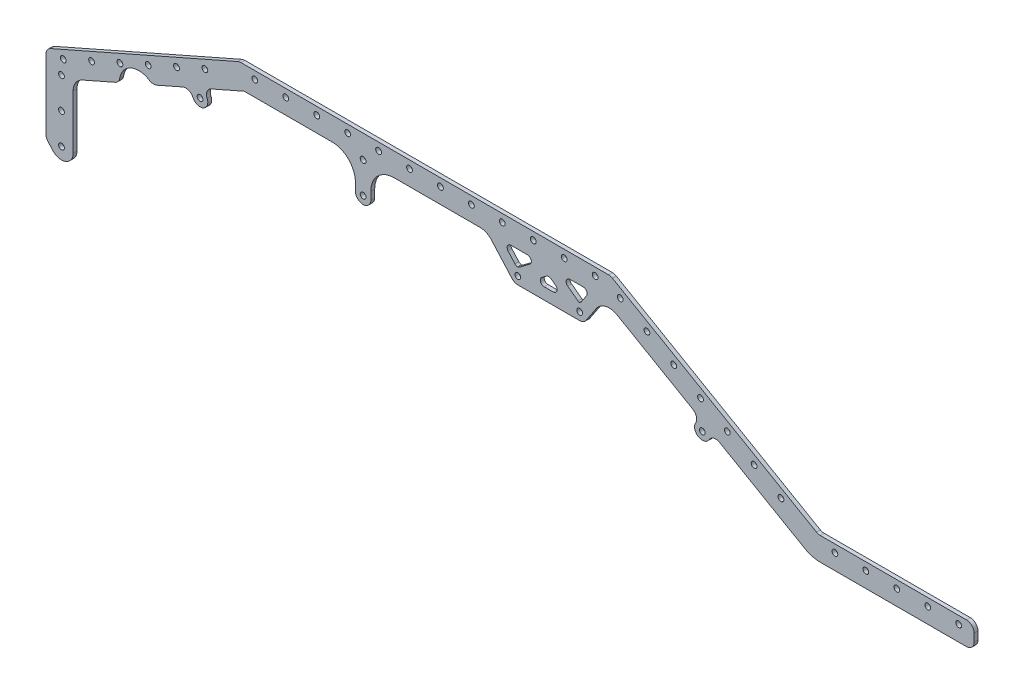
ISO-10303-21;
HEADER;
FILE_DESCRIPTION(('STEP AP214'),'2;1');
FILE_NAME('part.step','',(''),(''),'','','');
FILE_SCHEMA(('AUTOMOTIVE_DESIGN { 1 0 10303 214 1 1 1 1 }'));
ENDSEC;
DATA;
#1=APPLICATION_CONTEXT('core data for automotive mechanical design processes');
#2=APPLICATION_PROTOCOL_DEFINITION('international standard','automotive_design',2000,#1);
#3=PRODUCT_CONTEXT('',#1,'mechanical');
#4=PRODUCT('Part','Part','',(#3));
#5=PRODUCT_RELATED_PRODUCT_CATEGORY('part','',(#4));
#6=PRODUCT_DEFINITION_FORMATION('','',#4);
#7=PRODUCT_DEFINITION_CONTEXT('part definition',#1,'design');
#8=PRODUCT_DEFINITION('design','',#6,#7);
#9=PRODUCT_DEFINITION_SHAPE('','',#8);
#10=(LENGTH_UNIT() NAMED_UNIT(*) SI_UNIT(.MILLI.,.METRE.));
#11=(NAMED_UNIT(*) PLANE_ANGLE_UNIT() SI_UNIT($,.RADIAN.));
#12=(NAMED_UNIT(*) SI_UNIT($,.STERADIAN.) SOLID_ANGLE_UNIT());
#13=UNCERTAINTY_MEASURE_WITH_UNIT(LENGTH_MEASURE(1.E-05),#10,'distance_accuracy_value','');
#14=(GEOMETRIC_REPRESENTATION_CONTEXT(3) GLOBAL_UNCERTAINTY_ASSIGNED_CONTEXT((#13)) GLOBAL_UNIT_ASSIGNED_CONTEXT((#10,
#11,#12)) REPRESENTATION_CONTEXT('',''));
#15=CARTESIAN_POINT('',(0.,0.,0.));
#16=DIRECTION('',(0.,0.,1.));
#17=DIRECTION('',(1.,0.,0.));
#18=AXIS2_PLACEMENT_3D('',#15,#16,#17);
#19=CARTESIAN_POINT('',(-125.894887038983,286.124743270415,3.175));
#20=DIRECTION('',(-0.402738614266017,0.915315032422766,0.));
#21=DIRECTION('',(-0.915315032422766,-0.402738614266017,0.));
#22=AXIS2_PLACEMENT_3D('',#19,#20,#21);
#23=PLANE('',#22);
#24=DIRECTION('',(0.915315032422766,0.402738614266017,0.));
#25=VECTOR('',#24,1.);
#26=CARTESIAN_POINT('',(-125.894887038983,286.124743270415,0.));
#27=LINE('',#26,#25);
#28=CARTESIAN_POINT('',(-757.530801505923,8.20494090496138,0.));
#29=VERTEX_POINT('',#28);
#30=CARTESIAN_POINT('',(-730.564624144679,20.070058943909,0.));
#31=VERTEX_POINT('',#30);
#32=EDGE_CURVE('E695',#29,#31,#27,.T.);
#33=ORIENTED_EDGE('',*,*,#32,.T.);
#34=DIRECTION('',(0.,0.,1.));
#35=VECTOR('',#34,1.);
#36=CARTESIAN_POINT('',(-730.564624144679,20.070058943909,3.175));
#37=LINE('',#36,#35);
#38=CARTESIAN_POINT('',(-730.564624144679,20.070058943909,3.175));
#39=VERTEX_POINT('',#38);
#40=EDGE_CURVE('E999',#31,#39,#37,.T.);
#41=ORIENTED_EDGE('',*,*,#40,.T.);
#42=DIRECTION('',(0.915315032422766,0.402738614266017,0.));
#43=VECTOR('',#42,1.);
#44=CARTESIAN_POINT('',(-125.894887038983,286.124743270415,3.175));
#45=LINE('',#44,#43);
#46=CARTESIAN_POINT('',(-757.530801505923,8.20494090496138,3.175));
#47=VERTEX_POINT('',#46);
#48=EDGE_CURVE('E545',#47,#39,#45,.T.);
#49=ORIENTED_EDGE('',*,*,#48,.F.);
#50=DIRECTION('',(0.,0.,-1.));
#51=VECTOR('',#50,1.);
#52=CARTESIAN_POINT('',(-757.530801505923,8.2049409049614,0.));
#53=LINE('',#52,#51);
#54=EDGE_CURVE('E883',#47,#29,#53,.T.);
#55=ORIENTED_EDGE('',*,*,#54,.T.);
#56=EDGE_LOOP('',(#33,#41,#49,#55));
#57=FACE_BOUND('',#56,.T.);
#58=ADVANCED_FACE('F40',(#57),#23,.F.);
#59=CARTESIAN_POINT('',(-169.735499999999,226.313999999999,3.175));
#60=DIRECTION('',(-0.599999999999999,0.8,0.));
#61=DIRECTION('',(-0.800000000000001,-0.599999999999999,0.));
#62=AXIS2_PLACEMENT_3D('',#59,#60,#61);
#63=PLANE('',#62);
#64=DIRECTION('',(0.8,0.599999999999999,0.));
#65=VECTOR('',#64,1.);
#66=CARTESIAN_POINT('',(-169.735499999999,226.313999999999,0.));
#67=LINE('',#66,#65);
#68=CARTESIAN_POINT('',(-398.695386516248,54.5940851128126,0.));
#69=VERTEX_POINT('',#68);
#70=CARTESIAN_POINT('',(-390.2075,60.9599999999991,0.));
#71=VERTEX_POINT('',#70);
#72=EDGE_CURVE('E747',#69,#71,#67,.T.);
#73=ORIENTED_EDGE('',*,*,#72,.F.);
#74=DIRECTION('',(0.,0.,-1.));
#75=VECTOR('',#74,1.);
#76=CARTESIAN_POINT('',(-398.695386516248,54.5940851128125,3.175));
#77=LINE('',#76,#75);
#78=CARTESIAN_POINT('',(-398.695386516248,54.5940851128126,3.175));
#79=VERTEX_POINT('',#78);
#80=EDGE_CURVE('E918',#69,#79,#77,.F.);
#81=ORIENTED_EDGE('',*,*,#80,.T.);
#82=DIRECTION('',(0.8,0.599999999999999,0.));
#83=VECTOR('',#82,1.);
#84=CARTESIAN_POINT('',(-169.735499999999,226.313999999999,3.175));
#85=LINE('',#84,#83);
#86=CARTESIAN_POINT('',(-390.2075,60.9599999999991,3.175));
#87=VERTEX_POINT('',#86);
#88=EDGE_CURVE('E593',#79,#87,#85,.T.);
#89=ORIENTED_EDGE('',*,*,#88,.T.);
#90=DIRECTION('',(0.,0.,-1.));
#91=VECTOR('',#90,1.);
#92=CARTESIAN_POINT('',(-390.2075,60.959999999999,3.175));
#93=LINE('',#92,#91);
#94=EDGE_CURVE('E915',#87,#71,#93,.T.);
#95=ORIENTED_EDGE('',*,*,#94,.T.);
#96=EDGE_LOOP('',(#73,#81,#89,#95));
#97=FACE_BOUND('',#96,.T.);
#98=ADVANCED_FACE('F1313',(#97),#63,.T.);
#99=CARTESIAN_POINT('',(-197.737464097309,-175.517223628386,3.175));
#100=DIRECTION('',(0.747877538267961,0.663836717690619,0.));
#101=DIRECTION('',(-0.663836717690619,0.747877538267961,0.));
#102=AXIS2_PLACEMENT_3D('',#99,#100,#101);
#103=PLANE('',#102);
#104=DIRECTION('',(0.663836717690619,-0.747877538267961,0.));
#105=VECTOR('',#104,1.);
#106=CARTESIAN_POINT('',(-197.737464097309,-175.517223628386,3.175));
#107=LINE('',#106,#105);
#108=CARTESIAN_POINT('',(-408.024903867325,61.3923184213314,3.175));
#109=VERTEX_POINT('',#108);
#110=CARTESIAN_POINT('',(-402.388408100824,55.042249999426,3.175));
#111=VERTEX_POINT('',#110);
#112=EDGE_CURVE('E596',#109,#111,#107,.T.);
#113=ORIENTED_EDGE('',*,*,#112,.T.);
#114=DIRECTION('',(0.,0.,-1.));
#115=VECTOR('',#114,1.);
#116=CARTESIAN_POINT('',(-402.388408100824,55.042249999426,3.175));
#117=LINE('',#116,#115);
#118=CARTESIAN_POINT('',(-402.388408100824,55.042249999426,0.));
#119=VERTEX_POINT('',#118);
#120=EDGE_CURVE('E912',#111,#119,#117,.T.);
#121=ORIENTED_EDGE('',*,*,#120,.T.);
#122=DIRECTION('',(0.663836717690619,-0.747877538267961,0.));
#123=VECTOR('',#122,1.);
#124=CARTESIAN_POINT('',(-197.737464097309,-175.517223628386,0.));
#125=LINE('',#124,#123);
#126=CARTESIAN_POINT('',(-408.024903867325,61.3923184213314,0.));
#127=VERTEX_POINT('',#126);
#128=EDGE_CURVE('E750',#127,#119,#125,.T.);
#129=ORIENTED_EDGE('',*,*,#128,.F.);
#130=DIRECTION('',(0.,0.,-1.));
#131=VECTOR('',#130,1.);
#132=CARTESIAN_POINT('',(-408.024903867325,61.3923184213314,3.175));
#133=LINE('',#132,#131);
#134=EDGE_CURVE('E910',#127,#109,#133,.F.);
#135=ORIENTED_EDGE('',*,*,#134,.T.);
#136=EDGE_LOOP('',(#113,#121,#129,#135));
#137=FACE_BOUND('',#136,.T.);
#138=ADVANCED_FACE('F1300',(#137),#103,.T.);
#139=CARTESIAN_POINT('',(-25.4,0.,3.175));
#140=DIRECTION('',(1.,0.,0.));
#141=DIRECTION('',(0.,0.,-1.));
#142=AXIS2_PLACEMENT_3D('',#139,#140,#141);
#143=PLANE('',#142);
#144=DIRECTION('',(0.,-1.,0.));
#145=VECTOR('',#144,1.);
#146=CARTESIAN_POINT('',(-25.4,0.,3.175));
#147=LINE('',#146,#145);
#148=CARTESIAN_POINT('',(-25.4,-19.0500000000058,3.175));
#149=VERTEX_POINT('',#148);
#150=CARTESIAN_POINT('',(-25.4,-25.4000000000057,3.175));
#151=VERTEX_POINT('',#150);
#152=EDGE_CURVE('E477',#149,#151,#147,.T.);
#153=ORIENTED_EDGE('',*,*,#152,.T.);
#154=DIRECTION('',(0.,0.,-1.));
#155=VECTOR('',#154,1.);
#156=CARTESIAN_POINT('',(-25.4,-25.4000000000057,0.));
#157=LINE('',#156,#155);
#158=CARTESIAN_POINT('',(-25.4,-25.4000000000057,0.));
#159=VERTEX_POINT('',#158);
#160=EDGE_CURVE('E843',#151,#159,#157,.T.);
#161=ORIENTED_EDGE('',*,*,#160,.T.);
#162=DIRECTION('',(0.,-1.,0.));
#163=VECTOR('',#162,1.);
#164=CARTESIAN_POINT('',(-25.4,0.,0.));
#165=LINE('',#164,#163);
#166=CARTESIAN_POINT('',(-25.4,-19.0500000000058,0.));
#167=VERTEX_POINT('',#166);
#168=EDGE_CURVE('E480',#167,#159,#165,.T.);
#169=ORIENTED_EDGE('',*,*,#168,.F.);
#170=DIRECTION('',(0.,0.,-1.));
#171=VECTOR('',#170,1.);
#172=CARTESIAN_POINT('',(-25.4,-19.0500000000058,3.175));
#173=LINE('',#172,#171);
#174=EDGE_CURVE('E472',#149,#167,#173,.T.);
#175=ORIENTED_EDGE('',*,*,#174,.F.);
#176=EDGE_LOOP('',(#153,#161,#169,#175));
#177=FACE_BOUND('',#176,.T.);
#178=ADVANCED_FACE('F474',(#177),#143,.T.);
#179=CARTESIAN_POINT('',(-31.75,-19.0500000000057,3.175));
#180=DIRECTION('',(0.,0.,-1.));
#181=DIRECTION('',(-1.,0.,0.));
#182=AXIS2_PLACEMENT_3D('',#179,#180,#181);
#183=CYLINDRICAL_SURFACE('',#182,6.35);
#184=CARTESIAN_POINT('',(-31.75,-19.0500000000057,0.));
#185=DIRECTION('',(0.,0.,1.));
#186=DIRECTION('',(1.,0.,0.));
#187=AXIS2_PLACEMENT_3D('',#184,#185,#186);
#188=CIRCLE('',#187,6.35);
#189=CARTESIAN_POINT('',(-31.75,-12.7000000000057,0.));
#190=VERTEX_POINT('',#189);
#191=EDGE_CURVE('E651',#167,#190,#188,.T.);
#192=ORIENTED_EDGE('',*,*,#191,.T.);
#193=DIRECTION('',(0.,0.,-1.));
#194=VECTOR('',#193,1.);
#195=CARTESIAN_POINT('',(-31.75,-12.7000000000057,3.175));
#196=LINE('',#195,#194);
#197=CARTESIAN_POINT('',(-31.75,-12.7000000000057,3.175));
#198=VERTEX_POINT('',#197);
#199=EDGE_CURVE('E485',#198,#190,#196,.T.);
#200=ORIENTED_EDGE('',*,*,#199,.F.);
#201=CARTESIAN_POINT('',(-31.75,-19.0500000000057,3.175));
#202=DIRECTION('',(0.,0.,1.));
#203=DIRECTION('',(1.,0.,0.));
#204=AXIS2_PLACEMENT_3D('',#201,#202,#203);
#205=CIRCLE('',#204,6.35);
#206=EDGE_CURVE('E488',#149,#198,#205,.T.);
#207=ORIENTED_EDGE('',*,*,#206,.F.);
#208=ORIENTED_EDGE('',*,*,#174,.T.);
#209=EDGE_LOOP('',(#192,#200,#207,#208));
#210=FACE_BOUND('',#209,.T.);
#211=ADVANCED_FACE('F489',(#210),#183,.T.);
#212=CARTESIAN_POINT('',(0.,-12.7000000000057,3.175));
#213=DIRECTION('',(0.,1.,0.));
#214=DIRECTION('',(0.,0.,1.));
#215=AXIS2_PLACEMENT_3D('',#212,#213,#214);
#216=PLANE('',#215);
#217=DIRECTION('',(1.,0.,0.));
#218=VECTOR('',#217,1.);
#219=CARTESIAN_POINT('',(0.,-12.7000000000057,0.));
#220=LINE('',#219,#218);
#221=CARTESIAN_POINT('',(-151.671421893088,-12.7000000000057,0.));
#222=VERTEX_POINT('',#221);
#223=EDGE_CURVE('E653',#222,#190,#220,.T.);
#224=ORIENTED_EDGE('',*,*,#223,.F.);
#225=DIRECTION('',(0.,0.,-1.));
#226=VECTOR('',#225,1.);
#227=CARTESIAN_POINT('',(-151.671421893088,-12.7000000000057,3.175));
#228=LINE('',#227,#226);
#229=CARTESIAN_POINT('',(-151.671421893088,-12.7000000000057,3.175));
#230=VERTEX_POINT('',#229);
#231=EDGE_CURVE('E820',#230,#222,#228,.T.);
#232=ORIENTED_EDGE('',*,*,#231,.F.);
#233=DIRECTION('',(1.,0.,0.));
#234=VECTOR('',#233,1.);
#235=CARTESIAN_POINT('',(0.,-12.7000000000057,3.175));
#236=LINE('',#235,#234);
#237=EDGE_CURVE('E493',#230,#198,#236,.T.);
#238=ORIENTED_EDGE('',*,*,#237,.T.);
#239=ORIENTED_EDGE('',*,*,#199,.T.);
#240=EDGE_LOOP('',(#224,#232,#238,#239));
#241=FACE_BOUND('',#240,.T.);
#242=ADVANCED_FACE('F1498',(#241),#216,.T.);
#243=CARTESIAN_POINT('',(-151.671421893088,-6.35000000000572,3.175));
#244=DIRECTION('',(0.,0.,-1.));
#245=DIRECTION('',(-1.,0.,0.));
#246=AXIS2_PLACEMENT_3D('',#243,#244,#245);
#247=CYLINDRICAL_SURFACE('',#246,6.35);
#248=CARTESIAN_POINT('',(-151.671421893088,-6.35000000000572,0.));
#249=DIRECTION('',(0.,0.,1.));
#250=DIRECTION('',(1.,0.,0.));
#251=AXIS2_PLACEMENT_3D('',#248,#249,#250);
#252=CIRCLE('',#251,6.35);
#253=CARTESIAN_POINT('',(-154.846421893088,-11.8492613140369,0.));
#254=VERTEX_POINT('',#253);
#255=EDGE_CURVE('E656',#254,#222,#252,.T.);
#256=ORIENTED_EDGE('',*,*,#255,.F.);
#257=DIRECTION('',(0.,0.,-1.));
#258=VECTOR('',#257,1.);
#259=CARTESIAN_POINT('',(-154.846421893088,-11.8492613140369,3.175));
#260=LINE('',#259,#258);
#261=CARTESIAN_POINT('',(-154.846421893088,-11.8492613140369,3.175));
#262=VERTEX_POINT('',#261);
#263=EDGE_CURVE('E818',#262,#254,#260,.T.);
#264=ORIENTED_EDGE('',*,*,#263,.F.);
#265=CARTESIAN_POINT('',(-151.671421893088,-6.35000000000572,3.175));
#266=DIRECTION('',(0.,0.,1.));
#267=DIRECTION('',(1.,0.,0.));
#268=AXIS2_PLACEMENT_3D('',#265,#266,#267);
#269=CIRCLE('',#268,6.35);
#270=EDGE_CURVE('E509',#262,#230,#269,.T.);
#271=ORIENTED_EDGE('',*,*,#270,.T.);
#272=ORIENTED_EDGE('',*,*,#231,.T.);
#273=EDGE_LOOP('',(#256,#264,#271,#272));
#274=FACE_BOUND('',#273,.T.);
#275=ADVANCED_FACE('F1501',(#274),#247,.F.);
#276=CARTESIAN_POINT('',(-43.8424861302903,-75.9374135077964,3.175));
#277=DIRECTION('',(0.500000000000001,0.866025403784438,0.));
#278=DIRECTION('',(-0.866025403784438,0.500000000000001,0.));
#279=AXIS2_PLACEMENT_3D('',#276,#277,#278);
#280=PLANE('',#279);
#281=DIRECTION('',(0.866025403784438,-0.500000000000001,0.));
#282=VECTOR('',#281,1.);
#283=CARTESIAN_POINT('',(-43.8424861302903,-75.9374135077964,0.));
#284=LINE('',#283,#282);
#285=CARTESIAN_POINT('',(-322.376477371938,84.8742613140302,0.));
#286=VERTEX_POINT('',#285);
#287=EDGE_CURVE('E659',#286,#254,#284,.T.);
#288=ORIENTED_EDGE('',*,*,#287,.F.);
#289=DIRECTION('',(0.,0.,-1.));
#290=VECTOR('',#289,1.);
#291=CARTESIAN_POINT('',(-322.376477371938,84.8742613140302,3.175));
#292=LINE('',#291,#290);
#293=CARTESIAN_POINT('',(-322.376477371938,84.8742613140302,3.175));
#294=VERTEX_POINT('',#293);
#295=EDGE_CURVE('E816',#294,#286,#292,.T.);
#296=ORIENTED_EDGE('',*,*,#295,.F.);
#297=DIRECTION('',(0.866025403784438,-0.500000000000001,0.));
#298=VECTOR('',#297,1.);
#299=CARTESIAN_POINT('',(-43.8424861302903,-75.9374135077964,3.175));
#300=LINE('',#299,#298);
#301=EDGE_CURVE('E512',#294,#262,#300,.T.);
#302=ORIENTED_EDGE('',*,*,#301,.T.);
#303=ORIENTED_EDGE('',*,*,#263,.T.);
#304=EDGE_LOOP('',(#288,#296,#302,#303));
#305=FACE_BOUND('',#304,.T.);
#306=ADVANCED_FACE('F1505',(#305),#280,.T.);
#307=CARTESIAN_POINT('',(-325.551477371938,79.374999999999,3.175));
#308=DIRECTION('',(0.,0.,-1.));
#309=DIRECTION('',(-1.,0.,0.));
#310=AXIS2_PLACEMENT_3D('',#307,#308,#309);
#311=CYLINDRICAL_SURFACE('',#310,6.34999999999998);
#312=CARTESIAN_POINT('',(-325.551477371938,79.374999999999,0.));
#313=DIRECTION('',(0.,0.,1.));
#314=DIRECTION('',(1.,0.,0.));
#315=AXIS2_PLACEMENT_3D('',#312,#313,#314);
#316=CIRCLE('',#315,6.34999999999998);
#317=CARTESIAN_POINT('',(-325.551477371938,85.724999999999,0.));
#318=VERTEX_POINT('',#317);
#319=EDGE_CURVE('E663',#286,#318,#316,.T.);
#320=ORIENTED_EDGE('',*,*,#319,.T.);
#321=DIRECTION('',(0.,0.,-1.));
#322=VECTOR('',#321,1.);
#323=CARTESIAN_POINT('',(-325.551477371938,85.724999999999,3.175));
#324=LINE('',#323,#322);
#325=CARTESIAN_POINT('',(-325.551477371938,85.724999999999,3.175));
#326=VERTEX_POINT('',#325);
#327=EDGE_CURVE('E814',#326,#318,#324,.T.);
#328=ORIENTED_EDGE('',*,*,#327,.F.);
#329=CARTESIAN_POINT('',(-325.551477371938,79.374999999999,3.175));
#330=DIRECTION('',(0.,0.,1.));
#331=DIRECTION('',(1.,0.,0.));
#332=AXIS2_PLACEMENT_3D('',#329,#330,#331);
#333=CIRCLE('',#332,6.34999999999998);
#334=EDGE_CURVE('E516',#294,#326,#333,.T.);
#335=ORIENTED_EDGE('',*,*,#334,.F.);
#336=ORIENTED_EDGE('',*,*,#295,.T.);
#337=EDGE_LOOP('',(#320,#328,#335,#336));
#338=FACE_BOUND('',#337,.T.);
#339=ADVANCED_FACE('F1509',(#338),#311,.T.);
#340=CARTESIAN_POINT('',(0.,85.724999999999,3.175));
#341=DIRECTION('',(0.,1.,0.));
#342=DIRECTION('',(-1.,0.,0.));
#343=AXIS2_PLACEMENT_3D('',#340,#341,#342);
#344=PLANE('',#343);
#345=DIRECTION('',(1.,0.,0.));
#346=VECTOR('',#345,1.);
#347=CARTESIAN_POINT('',(0.,85.724999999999,0.));
#348=LINE('',#347,#346);
#349=CARTESIAN_POINT('',(-627.314767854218,85.724999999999,0.));
#350=VERTEX_POINT('',#349);
#351=EDGE_CURVE('E666',#350,#318,#348,.T.);
#352=ORIENTED_EDGE('',*,*,#351,.F.);
#353=DIRECTION('',(0.,0.,-1.));
#354=VECTOR('',#353,1.);
#355=CARTESIAN_POINT('',(-627.314767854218,85.724999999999,3.175));
#356=LINE('',#355,#354);
#357=CARTESIAN_POINT('',(-627.314767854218,85.724999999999,3.175));
#358=VERTEX_POINT('',#357);
#359=EDGE_CURVE('E812',#358,#350,#356,.T.);
#360=ORIENTED_EDGE('',*,*,#359,.F.);
#361=DIRECTION('',(1.,0.,0.));
#362=VECTOR('',#361,1.);
#363=CARTESIAN_POINT('',(0.,85.724999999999,3.175));
#364=LINE('',#363,#362);
#365=EDGE_CURVE('E518',#358,#326,#364,.T.);
#366=ORIENTED_EDGE('',*,*,#365,.T.);
#367=ORIENTED_EDGE('',*,*,#327,.T.);
#368=EDGE_LOOP('',(#352,#360,#366,#367));
#369=FACE_BOUND('',#368,.T.);
#370=ADVANCED_FACE('F1513',(#369),#344,.T.);
#371=CARTESIAN_POINT('',(-627.314767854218,79.3749999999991,3.175));
#372=DIRECTION('',(0.,0.,-1.));
#373=DIRECTION('',(-1.,0.,0.));
#374=AXIS2_PLACEMENT_3D('',#371,#372,#373);
#375=CYLINDRICAL_SURFACE('',#374,6.34999999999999);
#376=CARTESIAN_POINT('',(-627.314767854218,79.3749999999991,0.));
#377=DIRECTION('',(0.,0.,1.));
#378=DIRECTION('',(1.,0.,0.));
#379=AXIS2_PLACEMENT_3D('',#376,#377,#378);
#380=CIRCLE('',#379,6.34999999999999);
#381=CARTESIAN_POINT('',(-629.872158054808,85.1872504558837,0.));
#382=VERTEX_POINT('',#381);
#383=EDGE_CURVE('E670',#350,#382,#380,.T.);
#384=ORIENTED_EDGE('',*,*,#383,.T.);
#385=DIRECTION('',(0.,0.,-1.));
#386=VECTOR('',#385,1.);
#387=CARTESIAN_POINT('',(-629.872158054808,85.1872504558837,3.175));
#388=LINE('',#387,#386);
#389=CARTESIAN_POINT('',(-629.872158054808,85.1872504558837,3.175));
#390=VERTEX_POINT('',#389);
#391=EDGE_CURVE('E810',#390,#382,#388,.T.);
#392=ORIENTED_EDGE('',*,*,#391,.F.);
#393=CARTESIAN_POINT('',(-627.314767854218,79.3749999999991,3.175));
#394=DIRECTION('',(0.,0.,1.));
#395=DIRECTION('',(1.,0.,0.));
#396=AXIS2_PLACEMENT_3D('',#393,#394,#395);
#397=CIRCLE('',#396,6.34999999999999);
#398=EDGE_CURVE('E522',#358,#390,#397,.T.);
#399=ORIENTED_EDGE('',*,*,#398,.F.);
#400=ORIENTED_EDGE('',*,*,#359,.T.);
#401=EDGE_LOOP('',(#384,#392,#399,#400));
#402=FACE_BOUND('',#401,.T.);
#403=ADVANCED_FACE('F1517',(#402),#375,.T.);
#404=CARTESIAN_POINT('',(-133.56705764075,303.561494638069,3.175));
#405=DIRECTION('',(-0.402738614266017,0.915315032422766,0.));
#406=DIRECTION('',(-0.915315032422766,-0.402738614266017,0.));
#407=AXIS2_PLACEMENT_3D('',#404,#405,#406);
#408=PLANE('',#407);
#409=DIRECTION('',(0.915315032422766,0.402738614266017,0.));
#410=VECTOR('',#409,1.);
#411=CARTESIAN_POINT('',(-133.56705764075,303.561494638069,0.));
#412=LINE('',#411,#410);
#413=CARTESIAN_POINT('',(-783.607390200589,17.5437483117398,0.));
#414=VERTEX_POINT('',#413);
#415=EDGE_CURVE('E673',#414,#382,#412,.T.);
#416=ORIENTED_EDGE('',*,*,#415,.F.);
#417=DIRECTION('',(0.,0.,-1.));
#418=VECTOR('',#417,1.);
#419=CARTESIAN_POINT('',(-783.607390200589,17.5437483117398,3.175));
#420=LINE('',#419,#418);
#421=CARTESIAN_POINT('',(-783.607390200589,17.5437483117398,3.175));
#422=VERTEX_POINT('',#421);
#423=EDGE_CURVE('E808',#422,#414,#420,.T.);
#424=ORIENTED_EDGE('',*,*,#423,.F.);
#425=DIRECTION('',(0.915315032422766,0.402738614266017,0.));
#426=VECTOR('',#425,1.);
#427=CARTESIAN_POINT('',(-133.56705764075,303.561494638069,3.175));
#428=LINE('',#427,#426);
#429=EDGE_CURVE('E524',#422,#390,#428,.T.);
#430=ORIENTED_EDGE('',*,*,#429,.T.);
#431=ORIENTED_EDGE('',*,*,#391,.T.);
#432=EDGE_LOOP('',(#416,#424,#430,#431));
#433=FACE_BOUND('',#432,.T.);
#434=ADVANCED_FACE('F1521',(#433),#408,.T.);
#435=CARTESIAN_POINT('',(-781.05,11.7314978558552,3.175));
#436=DIRECTION('',(0.,0.,-1.));
#437=DIRECTION('',(-1.,0.,0.));
#438=AXIS2_PLACEMENT_3D('',#435,#436,#437);
#439=CYLINDRICAL_SURFACE('',#438,6.34999999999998);
#440=CARTESIAN_POINT('',(-781.05,11.7314978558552,0.));
#441=DIRECTION('',(0.,0.,1.));
#442=DIRECTION('',(1.,0.,0.));
#443=AXIS2_PLACEMENT_3D('',#440,#441,#442);
#444=CIRCLE('',#443,6.34999999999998);
#445=CARTESIAN_POINT('',(-787.4,11.7314978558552,0.));
#446=VERTEX_POINT('',#445);
#447=EDGE_CURVE('E676',#414,#446,#444,.T.);
#448=ORIENTED_EDGE('',*,*,#447,.T.);
#449=DIRECTION('',(0.,0.,-1.));
#450=VECTOR('',#449,1.);
#451=CARTESIAN_POINT('',(-787.4,11.7314978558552,3.175));
#452=LINE('',#451,#450);
#453=CARTESIAN_POINT('',(-787.4,11.7314978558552,3.175));
#454=VERTEX_POINT('',#453);
#455=EDGE_CURVE('E806',#454,#446,#452,.T.);
#456=ORIENTED_EDGE('',*,*,#455,.F.);
#457=CARTESIAN_POINT('',(-781.05,11.7314978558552,3.175));
#458=DIRECTION('',(0.,0.,1.));
#459=DIRECTION('',(1.,0.,0.));
#460=AXIS2_PLACEMENT_3D('',#457,#458,#459);
#461=CIRCLE('',#460,6.34999999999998);
#462=EDGE_CURVE('E527',#422,#454,#461,.T.);
#463=ORIENTED_EDGE('',*,*,#462,.F.);
#464=ORIENTED_EDGE('',*,*,#423,.T.);
#465=EDGE_LOOP('',(#448,#456,#463,#464));
#466=FACE_BOUND('',#465,.T.);
#467=ADVANCED_FACE('F1525',(#466),#439,.T.);
#468=CARTESIAN_POINT('',(-787.4,0.,3.175));
#469=DIRECTION('',(-1.,0.,0.));
#470=DIRECTION('',(0.,0.,1.));
#471=AXIS2_PLACEMENT_3D('',#468,#469,#470);
#472=PLANE('',#471);
#473=DIRECTION('',(0.,1.,0.));
#474=VECTOR('',#473,1.);
#475=CARTESIAN_POINT('',(-787.4,0.,0.));
#476=LINE('',#475,#474);
#477=CARTESIAN_POINT('',(-787.4,-45.3764525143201,0.));
#478=VERTEX_POINT('',#477);
#479=EDGE_CURVE('E679',#478,#446,#476,.T.);
#480=ORIENTED_EDGE('',*,*,#479,.F.);
#481=DIRECTION('',(0.,0.,-1.));
#482=VECTOR('',#481,1.);
#483=CARTESIAN_POINT('',(-787.4,-45.3764525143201,3.175));
#484=LINE('',#483,#482);
#485=CARTESIAN_POINT('',(-787.4,-45.3764525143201,3.175));
#486=VERTEX_POINT('',#485);
#487=EDGE_CURVE('E804',#486,#478,#484,.T.);
#488=ORIENTED_EDGE('',*,*,#487,.F.);
#489=DIRECTION('',(0.,1.,0.));
#490=VECTOR('',#489,1.);
#491=CARTESIAN_POINT('',(-787.4,0.,3.175));
#492=LINE('',#491,#490);
#493=EDGE_CURVE('E529',#486,#454,#492,.T.);
#494=ORIENTED_EDGE('',*,*,#493,.T.);
#495=ORIENTED_EDGE('',*,*,#455,.T.);
#496=EDGE_LOOP('',(#480,#488,#494,#495));
#497=FACE_BOUND('',#496,.T.);
#498=ADVANCED_FACE('F1529',(#497),#472,.T.);
#499=CARTESIAN_POINT('',(-781.05,-45.3764525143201,3.175));
#500=DIRECTION('',(0.,0.,-1.));
#501=DIRECTION('',(-1.,0.,0.));
#502=AXIS2_PLACEMENT_3D('',#499,#500,#501);
#503=CYLINDRICAL_SURFACE('',#502,6.34999999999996);
#504=CARTESIAN_POINT('',(-781.05,-45.3764525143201,0.));
#505=DIRECTION('',(0.,0.,1.));
#506=DIRECTION('',(1.,0.,0.));
#507=AXIS2_PLACEMENT_3D('',#504,#505,#506);
#508=CIRCLE('',#507,6.34999999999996);
#509=CARTESIAN_POINT('',(-785.783010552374,-49.6097858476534,0.));
#510=VERTEX_POINT('',#509);
#511=EDGE_CURVE('E682',#478,#510,#508,.T.);
#512=ORIENTED_EDGE('',*,*,#511,.T.);
#513=DIRECTION('',(0.,0.,-1.));
#514=VECTOR('',#513,1.);
#515=CARTESIAN_POINT('',(-785.783010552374,-49.6097858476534,3.175));
#516=LINE('',#515,#514);
#517=CARTESIAN_POINT('',(-785.783010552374,-49.6097858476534,3.175));
#518=VERTEX_POINT('',#517);
#519=EDGE_CURVE('E801',#518,#510,#516,.T.);
#520=ORIENTED_EDGE('',*,*,#519,.F.);
#521=CARTESIAN_POINT('',(-781.05,-45.3764525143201,3.175));
#522=DIRECTION('',(0.,0.,1.));
#523=DIRECTION('',(1.,0.,0.));
#524=AXIS2_PLACEMENT_3D('',#521,#522,#523);
#525=CIRCLE('',#524,6.34999999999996);
#526=EDGE_CURVE('E532',#486,#518,#525,.T.);
#527=ORIENTED_EDGE('',*,*,#526,.F.);
#528=ORIENTED_EDGE('',*,*,#487,.T.);
#529=EDGE_LOOP('',(#512,#520,#527,#528));
#530=FACE_BOUND('',#529,.T.);
#531=ADVANCED_FACE('F1533',(#530),#503,.T.);
#532=CARTESIAN_POINT('',(-461.197417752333,-412.507510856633,3.175));
#533=DIRECTION('',(0.745355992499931,0.666666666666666,0.));
#534=DIRECTION('',(-0.666666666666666,0.745355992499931,0.));
#535=AXIS2_PLACEMENT_3D('',#532,#533,#534);
#536=PLANE('',#535);
#537=DIRECTION('',(0.666666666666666,-0.745355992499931,0.));
#538=VECTOR('',#537,1.);
#539=CARTESIAN_POINT('',(-461.197417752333,-412.507510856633,0.));
#540=LINE('',#539,#538);
#541=CARTESIAN_POINT('',(-781.84347610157,-54.0143192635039,0.));
#542=VERTEX_POINT('',#541);
#543=EDGE_CURVE('E685',#510,#542,#540,.T.);
#544=ORIENTED_EDGE('',*,*,#543,.T.);
#545=DIRECTION('',(0.,0.,-1.));
#546=VECTOR('',#545,1.);
#547=CARTESIAN_POINT('',(-781.84347610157,-54.0143192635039,3.175));
#548=LINE('',#547,#546);
#549=CARTESIAN_POINT('',(-781.84347610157,-54.0143192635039,3.175));
#550=VERTEX_POINT('',#549);
#551=EDGE_CURVE('E798',#550,#542,#548,.T.);
#552=ORIENTED_EDGE('',*,*,#551,.F.);
#553=DIRECTION('',(0.666666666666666,-0.745355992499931,0.));
#554=VECTOR('',#553,1.);
#555=CARTESIAN_POINT('',(-461.197417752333,-412.507510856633,3.175));
#556=LINE('',#555,#554);
#557=EDGE_CURVE('E535',#518,#550,#556,.T.);
#558=ORIENTED_EDGE('',*,*,#557,.F.);
#559=ORIENTED_EDGE('',*,*,#519,.T.);
#560=EDGE_LOOP('',(#544,#552,#558,#559));
#561=FACE_BOUND('',#560,.T.);
#562=ADVANCED_FACE('F1537',(#561),#536,.F.);
#563=CARTESIAN_POINT('',(-774.699999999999,-47.625000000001,3.175));
#564=DIRECTION('',(0.,0.,-1.));
#565=DIRECTION('',(-1.,0.,0.));
#566=AXIS2_PLACEMENT_3D('',#563,#564,#565);
#567=CYLINDRICAL_SURFACE('',#566,9.58397889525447);
#568=CARTESIAN_POINT('',(-774.699999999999,-47.625000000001,0.));
#569=DIRECTION('',(0.,0.,1.));
#570=DIRECTION('',(1.,0.,0.));
#571=AXIS2_PLACEMENT_3D('',#568,#569,#570);
#572=CIRCLE('',#571,9.58397889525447);
#573=CARTESIAN_POINT('',(-765.116021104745,-47.625000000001,0.));
#574=VERTEX_POINT('',#573);
#575=EDGE_CURVE('E688',#542,#574,#572,.T.);
#576=ORIENTED_EDGE('',*,*,#575,.T.);
#577=DIRECTION('',(0.,0.,-1.));
#578=VECTOR('',#577,1.);
#579=CARTESIAN_POINT('',(-765.116021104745,-47.625000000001,3.175));
#580=LINE('',#579,#578);
#581=CARTESIAN_POINT('',(-765.116021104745,-47.625000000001,3.175));
#582=VERTEX_POINT('',#581);
#583=EDGE_CURVE('E795',#582,#574,#580,.T.);
#584=ORIENTED_EDGE('',*,*,#583,.F.);
#585=CARTESIAN_POINT('',(-774.699999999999,-47.625000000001,3.175));
#586=DIRECTION('',(0.,0.,1.));
#587=DIRECTION('',(1.,0.,0.));
#588=AXIS2_PLACEMENT_3D('',#585,#586,#587);
#589=CIRCLE('',#588,9.58397889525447);
#590=EDGE_CURVE('E538',#550,#582,#589,.T.);
#591=ORIENTED_EDGE('',*,*,#590,.F.);
#592=ORIENTED_EDGE('',*,*,#551,.T.);
#593=EDGE_LOOP('',(#576,#584,#591,#592));
#594=FACE_BOUND('',#593,.T.);
#595=ADVANCED_FACE('F1345',(#594),#567,.T.);
#596=CARTESIAN_POINT('',(-765.116021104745,0.,3.175));
#597=DIRECTION('',(-1.,0.,0.));
#598=DIRECTION('',(0.,0.,1.));
#599=AXIS2_PLACEMENT_3D('',#596,#597,#598);
#600=PLANE('',#599);
#601=DIRECTION('',(0.,1.,0.));
#602=VECTOR('',#601,1.);
#603=CARTESIAN_POINT('',(-765.116021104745,0.,0.));
#604=LINE('',#603,#602);
#605=CARTESIAN_POINT('',(-765.116021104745,-3.41956000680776,0.));
#606=VERTEX_POINT('',#605);
#607=EDGE_CURVE('E691',#574,#606,#604,.T.);
#608=ORIENTED_EDGE('',*,*,#607,.T.);
#609=DIRECTION('',(0.,0.,-1.));
#610=VECTOR('',#609,1.);
#611=CARTESIAN_POINT('',(-765.116021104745,-3.41956000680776,3.175));
#612=LINE('',#611,#610);
#613=CARTESIAN_POINT('',(-765.116021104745,-3.41956000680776,3.175));
#614=VERTEX_POINT('',#613);
#615=EDGE_CURVE('E886',#606,#614,#612,.F.);
#616=ORIENTED_EDGE('',*,*,#615,.T.);
#617=DIRECTION('',(0.,1.,0.));
#618=VECTOR('',#617,1.);
#619=CARTESIAN_POINT('',(-765.116021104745,0.,3.175));
#620=LINE('',#619,#618);
#621=EDGE_CURVE('E541',#582,#614,#620,.T.);
#622=ORIENTED_EDGE('',*,*,#621,.F.);
#623=ORIENTED_EDGE('',*,*,#583,.T.);
#624=EDGE_LOOP('',(#608,#616,#622,#623));
#625=FACE_BOUND('',#624,.T.);
#626=ADVANCED_FACE('F1337',(#625),#600,.F.);
#627=CARTESIAN_POINT('',(-696.528434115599,35.0459825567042,3.175));
#628=VERTEX_POINT('',#627);
#629=CARTESIAN_POINT('',(-675.10732119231,44.4712722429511,3.175));
#630=VERTEX_POINT('',#629);
#631=EDGE_CURVE('E544',#628,#630,#45,.T.);
#632=ORIENTED_EDGE('',*,*,#631,.F.);
#633=DIRECTION('',(0.,0.,1.));
#634=VECTOR('',#633,1.);
#635=CARTESIAN_POINT('',(-696.528434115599,35.0459825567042,3.175));
#636=LINE('',#635,#634);
#637=CARTESIAN_POINT('',(-696.528434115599,35.0459825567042,0.));
#638=VERTEX_POINT('',#637);
#639=EDGE_CURVE('E11',#628,#638,#636,.F.);
#640=ORIENTED_EDGE('',*,*,#639,.T.);
#641=CARTESIAN_POINT('',(-675.10732119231,44.4712722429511,0.));
#642=VERTEX_POINT('',#641);
#643=EDGE_CURVE('E694',#638,#642,#27,.T.);
#644=ORIENTED_EDGE('',*,*,#643,.T.);
#645=DIRECTION('',(0.,0.,-1.));
#646=VECTOR('',#645,1.);
#647=CARTESIAN_POINT('',(-675.10732119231,44.4712722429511,3.175));
#648=LINE('',#647,#646);
#649=EDGE_CURVE('E859',#642,#630,#648,.F.);
#650=ORIENTED_EDGE('',*,*,#649,.T.);
#651=EDGE_LOOP('',(#632,#640,#644,#650));
#652=FACE_BOUND('',#651,.T.);
#653=ADVANCED_FACE('F1328',(#652),#23,.F.);
#654=CARTESIAN_POINT('',(-660.925430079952,43.773802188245,3.175));
#655=DIRECTION('',(0.,0.,-1.));
#656=DIRECTION('',(-1.,0.,0.));
#657=AXIS2_PLACEMENT_3D('',#654,#655,#656);
#658=CYLINDRICAL_SURFACE('',#657,6.34999999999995);
#659=CARTESIAN_POINT('',(-660.925430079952,43.773802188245,0.));
#660=DIRECTION('',(0.,0.,1.));
#661=DIRECTION('',(1.,0.,0.));
#662=AXIS2_PLACEMENT_3D('',#659,#660,#661);
#663=CIRCLE('',#662,6.34999999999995);
#664=CARTESIAN_POINT('',(-666.737680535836,41.2164119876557,0.));
#665=VERTEX_POINT('',#664);
#666=CARTESIAN_POINT('',(-655.113179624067,46.3311923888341,0.));
#667=VERTEX_POINT('',#666);
#668=EDGE_CURVE('E698',#665,#667,#663,.T.);
#669=ORIENTED_EDGE('',*,*,#668,.T.);
#670=DIRECTION('',(0.,0.,-1.));
#671=VECTOR('',#670,1.);
#672=CARTESIAN_POINT('',(-655.113179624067,46.3311923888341,3.175));
#673=LINE('',#672,#671);
#674=CARTESIAN_POINT('',(-655.113179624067,46.3311923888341,3.175));
#675=VERTEX_POINT('',#674);
#676=EDGE_CURVE('E788',#675,#667,#673,.T.);
#677=ORIENTED_EDGE('',*,*,#676,.F.);
#678=CARTESIAN_POINT('',(-660.925430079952,43.773802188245,3.175));
#679=DIRECTION('',(0.,0.,1.));
#680=DIRECTION('',(1.,0.,0.));
#681=AXIS2_PLACEMENT_3D('',#678,#679,#680);
#682=CIRCLE('',#681,6.34999999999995);
#683=CARTESIAN_POINT('',(-666.737680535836,41.2164119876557,3.175));
#684=VERTEX_POINT('',#683);
#685=EDGE_CURVE('E547',#684,#675,#682,.T.);
#686=ORIENTED_EDGE('',*,*,#685,.F.);
#687=DIRECTION('',(0.,0.,-1.));
#688=VECTOR('',#687,1.);
#689=CARTESIAN_POINT('',(-666.737680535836,41.2164119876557,3.175));
#690=LINE('',#689,#688);
#691=EDGE_CURVE('E791',#684,#665,#690,.T.);
#692=ORIENTED_EDGE('',*,*,#691,.T.);
#693=EDGE_LOOP('',(#669,#677,#686,#692));
#694=FACE_BOUND('',#693,.T.);
#695=ADVANCED_FACE('F1336',(#694),#658,.T.);
#696=CARTESIAN_POINT('',(-125.894887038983,286.124743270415,3.175));
#697=DIRECTION('',(-0.402738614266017,0.915315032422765,0.));
#698=DIRECTION('',(-0.915315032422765,-0.402738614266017,0.));
#699=AXIS2_PLACEMENT_3D('',#696,#697,#698);
#700=PLANE('',#699);
#701=DIRECTION('',(0.915315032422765,0.402738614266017,0.));
#702=VECTOR('',#701,1.);
#703=CARTESIAN_POINT('',(-125.894887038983,286.124743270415,3.175));
#704=LINE('',#703,#702);
#705=CARTESIAN_POINT('',(-651.858319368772,54.7008330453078,3.175));
#706=VERTEX_POINT('',#705);
#707=CARTESIAN_POINT('',(-624.644303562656,66.674999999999,3.175));
#708=VERTEX_POINT('',#707);
#709=EDGE_CURVE('E550',#706,#708,#704,.T.);
#710=ORIENTED_EDGE('',*,*,#709,.F.);
#711=DIRECTION('',(0.,0.,-1.));
#712=VECTOR('',#711,1.);
#713=CARTESIAN_POINT('',(-651.858319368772,54.7008330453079,3.175));
#714=LINE('',#713,#712);
#715=CARTESIAN_POINT('',(-651.858319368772,54.7008330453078,0.));
#716=VERTEX_POINT('',#715);
#717=EDGE_CURVE('E856',#706,#716,#714,.T.);
#718=ORIENTED_EDGE('',*,*,#717,.T.);
#719=DIRECTION('',(0.915315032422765,0.402738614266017,0.));
#720=VECTOR('',#719,1.);
#721=CARTESIAN_POINT('',(-125.894887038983,286.124743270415,0.));
#722=LINE('',#721,#720);
#723=CARTESIAN_POINT('',(-624.644303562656,66.674999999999,0.));
#724=VERTEX_POINT('',#723);
#725=EDGE_CURVE('E702',#716,#724,#722,.T.);
#726=ORIENTED_EDGE('',*,*,#725,.T.);
#727=DIRECTION('',(0.,0.,-1.));
#728=VECTOR('',#727,1.);
#729=CARTESIAN_POINT('',(-624.644303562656,66.674999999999,3.175));
#730=LINE('',#729,#728);
#731=EDGE_CURVE('E785',#708,#724,#730,.T.);
#732=ORIENTED_EDGE('',*,*,#731,.F.);
#733=EDGE_LOOP('',(#710,#718,#726,#732));
#734=FACE_BOUND('',#733,.T.);
#735=ADVANCED_FACE('F1343',(#734),#700,.F.);
#736=CARTESIAN_POINT('',(0.,66.674999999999,3.175));
#737=DIRECTION('',(0.,1.,0.));
#738=DIRECTION('',(0.,0.,1.));
#739=AXIS2_PLACEMENT_3D('',#736,#737,#738);
#740=PLANE('',#739);
#741=DIRECTION('',(1.,0.,0.));
#742=VECTOR('',#741,1.);
#743=CARTESIAN_POINT('',(0.,66.674999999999,0.));
#744=LINE('',#743,#742);
#745=CARTESIAN_POINT('',(-552.45,66.674999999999,0.));
#746=VERTEX_POINT('',#745);
#747=EDGE_CURVE('E704',#724,#746,#744,.T.);
#748=ORIENTED_EDGE('',*,*,#747,.T.);
#749=DIRECTION('',(0.,0.,-1.));
#750=VECTOR('',#749,1.);
#751=CARTESIAN_POINT('',(-552.45,66.674999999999,3.175));
#752=LINE('',#751,#750);
#753=CARTESIAN_POINT('',(-552.45,66.674999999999,3.175));
#754=VERTEX_POINT('',#753);
#755=EDGE_CURVE('E825',#746,#754,#752,.F.);
#756=ORIENTED_EDGE('',*,*,#755,.T.);
#757=DIRECTION('',(1.,0.,0.));
#758=VECTOR('',#757,1.);
#759=CARTESIAN_POINT('',(0.,66.674999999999,3.175));
#760=LINE('',#759,#758);
#761=EDGE_CURVE('E552',#708,#754,#760,.T.);
#762=ORIENTED_EDGE('',*,*,#761,.F.);
#763=ORIENTED_EDGE('',*,*,#731,.T.);
#764=EDGE_LOOP('',(#748,#756,#762,#763));
#765=FACE_BOUND('',#764,.T.);
#766=ADVANCED_FACE('F1648',(#765),#740,.F.);
#767=CARTESIAN_POINT('',(-533.4,0.,3.175));
#768=DIRECTION('',(-1.,0.,0.));
#769=DIRECTION('',(0.,0.,1.));
#770=AXIS2_PLACEMENT_3D('',#767,#768,#769);
#771=PLANE('',#770);
#772=DIRECTION('',(0.,1.,0.));
#773=VECTOR('',#772,1.);
#774=CARTESIAN_POINT('',(-533.4,0.,3.175));
#775=LINE('',#774,#773);
#776=CARTESIAN_POINT('',(-533.4,41.274999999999,3.175));
#777=VERTEX_POINT('',#776);
#778=CARTESIAN_POINT('',(-533.4,47.624999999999,3.175));
#779=VERTEX_POINT('',#778);
#780=EDGE_CURVE('E556',#777,#779,#775,.T.);
#781=ORIENTED_EDGE('',*,*,#780,.T.);
#782=DIRECTION('',(0.,0.,-1.));
#783=VECTOR('',#782,1.);
#784=CARTESIAN_POINT('',(-533.4,47.624999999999,3.175));
#785=LINE('',#784,#783);
#786=CARTESIAN_POINT('',(-533.4,47.624999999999,0.));
#787=VERTEX_POINT('',#786);
#788=EDGE_CURVE('E484',#779,#787,#785,.T.);
#789=ORIENTED_EDGE('',*,*,#788,.T.);
#790=DIRECTION('',(0.,1.,0.));
#791=VECTOR('',#790,1.);
#792=CARTESIAN_POINT('',(-533.4,0.,0.));
#793=LINE('',#792,#791);
#794=CARTESIAN_POINT('',(-533.4,41.274999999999,0.));
#795=VERTEX_POINT('',#794);
#796=EDGE_CURVE('E708',#795,#787,#793,.T.);
#797=ORIENTED_EDGE('',*,*,#796,.F.);
#798=DIRECTION('',(0.,0.,-1.));
#799=VECTOR('',#798,1.);
#800=CARTESIAN_POINT('',(-533.4,41.274999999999,3.175));
#801=LINE('',#800,#799);
#802=EDGE_CURVE('E783',#777,#795,#801,.T.);
#803=ORIENTED_EDGE('',*,*,#802,.F.);
#804=EDGE_LOOP('',(#781,#789,#797,#803));
#805=FACE_BOUND('',#804,.T.);
#806=ADVANCED_FACE('F1640',(#805),#771,.T.);
#807=CARTESIAN_POINT('',(-527.05,41.274999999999,3.175));
#808=DIRECTION('',(0.,0.,-1.));
#809=DIRECTION('',(-1.,0.,0.));
#810=AXIS2_PLACEMENT_3D('',#807,#808,#809);
#811=CYLINDRICAL_SURFACE('',#810,6.34999999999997);
#812=CARTESIAN_POINT('',(-527.05,41.274999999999,0.));
#813=DIRECTION('',(0.,0.,1.));
#814=DIRECTION('',(1.,0.,0.));
#815=AXIS2_PLACEMENT_3D('',#812,#813,#814);
#816=CIRCLE('',#815,6.34999999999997);
#817=CARTESIAN_POINT('',(-520.7,41.274999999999,0.));
#818=VERTEX_POINT('',#817);
#819=EDGE_CURVE('E711',#795,#818,#816,.T.);
#820=ORIENTED_EDGE('',*,*,#819,.T.);
#821=DIRECTION('',(0.,0.,-1.));
#822=VECTOR('',#821,1.);
#823=CARTESIAN_POINT('',(-520.7,41.274999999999,3.175));
#824=LINE('',#823,#822);
#825=CARTESIAN_POINT('',(-520.7,41.274999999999,3.175));
#826=VERTEX_POINT('',#825);
#827=EDGE_CURVE('E780',#826,#818,#824,.T.);
#828=ORIENTED_EDGE('',*,*,#827,.F.);
#829=CARTESIAN_POINT('',(-527.05,41.274999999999,3.175));
#830=DIRECTION('',(0.,0.,1.));
#831=DIRECTION('',(1.,0.,0.));
#832=AXIS2_PLACEMENT_3D('',#829,#830,#831);
#833=CIRCLE('',#832,6.34999999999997);
#834=EDGE_CURVE('E559',#777,#826,#833,.T.);
#835=ORIENTED_EDGE('',*,*,#834,.F.);
#836=ORIENTED_EDGE('',*,*,#802,.T.);
#837=EDGE_LOOP('',(#820,#828,#835,#836));
#838=FACE_BOUND('',#837,.T.);
#839=ADVANCED_FACE('F1637',(#838),#811,.T.);
#840=CARTESIAN_POINT('',(-520.7,0.,3.175));
#841=DIRECTION('',(-1.,0.,0.));
#842=DIRECTION('',(0.,0.,1.));
#843=AXIS2_PLACEMENT_3D('',#840,#841,#842);
#844=PLANE('',#843);
#845=DIRECTION('',(0.,1.,0.));
#846=VECTOR('',#845,1.);
#847=CARTESIAN_POINT('',(-520.7,0.,0.));
#848=LINE('',#847,#846);
#849=CARTESIAN_POINT('',(-520.7,47.624999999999,0.));
#850=VERTEX_POINT('',#849);
#851=EDGE_CURVE('E714',#818,#850,#848,.T.);
#852=ORIENTED_EDGE('',*,*,#851,.T.);
#853=DIRECTION('',(0.,0.,-1.));
#854=VECTOR('',#853,1.);
#855=CARTESIAN_POINT('',(-520.7,47.624999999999,3.175));
#856=LINE('',#855,#854);
#857=CARTESIAN_POINT('',(-520.7,47.624999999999,3.175));
#858=VERTEX_POINT('',#857);
#859=EDGE_CURVE('E831',#850,#858,#856,.F.);
#860=ORIENTED_EDGE('',*,*,#859,.T.);
#861=DIRECTION('',(0.,1.,0.));
#862=VECTOR('',#861,1.);
#863=CARTESIAN_POINT('',(-520.7,0.,3.175));
#864=LINE('',#863,#862);
#865=EDGE_CURVE('E562',#826,#858,#864,.T.);
#866=ORIENTED_EDGE('',*,*,#865,.F.);
#867=ORIENTED_EDGE('',*,*,#827,.T.);
#868=EDGE_LOOP('',(#852,#860,#866,#867));
#869=FACE_BOUND('',#868,.T.);
#870=ADVANCED_FACE('F1633',(#869),#844,.F.);
#871=CARTESIAN_POINT('',(0.,66.6749999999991,3.175));
#872=DIRECTION('',(0.,1.,0.));
#873=DIRECTION('',(-1.,0.,0.));
#874=AXIS2_PLACEMENT_3D('',#871,#872,#873);
#875=PLANE('',#874);
#876=DIRECTION('',(1.,0.,0.));
#877=VECTOR('',#876,1.);
#878=CARTESIAN_POINT('',(0.,66.6749999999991,0.));
#879=LINE('',#878,#877);
#880=CARTESIAN_POINT('',(-501.65,66.674999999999,0.));
#881=VERTEX_POINT('',#880);
#882=CARTESIAN_POINT('',(-431.158519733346,66.674999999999,0.));
#883=VERTEX_POINT('',#882);
#884=EDGE_CURVE('E717',#881,#883,#879,.T.);
#885=ORIENTED_EDGE('',*,*,#884,.T.);
#886=DIRECTION('',(0.,0.,-1.));
#887=VECTOR('',#886,1.);
#888=CARTESIAN_POINT('',(-431.158519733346,66.674999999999,3.175));
#889=LINE('',#888,#887);
#890=CARTESIAN_POINT('',(-431.158519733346,66.674999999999,3.175));
#891=VERTEX_POINT('',#890);
#892=EDGE_CURVE('E896',#883,#891,#889,.F.);
#893=ORIENTED_EDGE('',*,*,#892,.T.);
#894=DIRECTION('',(1.,0.,0.));
#895=VECTOR('',#894,1.);
#896=CARTESIAN_POINT('',(0.,66.6749999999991,3.175));
#897=LINE('',#896,#895);
#898=CARTESIAN_POINT('',(-501.65,66.674999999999,3.175));
#899=VERTEX_POINT('',#898);
#900=EDGE_CURVE('E565',#899,#891,#897,.T.);
#901=ORIENTED_EDGE('',*,*,#900,.F.);
#902=DIRECTION('',(0.,0.,-1.));
#903=VECTOR('',#902,1.);
#904=CARTESIAN_POINT('',(-501.65,66.674999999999,0.));
#905=LINE('',#904,#903);
#906=EDGE_CURVE('E828',#899,#881,#905,.T.);
#907=ORIENTED_EDGE('',*,*,#906,.T.);
#908=EDGE_LOOP('',(#885,#893,#901,#907));
#909=FACE_BOUND('',#908,.T.);
#910=ADVANCED_FACE('F1625',(#909),#875,.F.);
#911=CARTESIAN_POINT('',(-204.860997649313,-181.840268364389,3.175));
#912=DIRECTION('',(0.747877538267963,0.663836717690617,0.));
#913=DIRECTION('',(-0.663836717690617,0.747877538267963,0.));
#914=AXIS2_PLACEMENT_3D('',#911,#912,#913);
#915=PLANE('',#914);
#916=DIRECTION('',(0.663836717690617,-0.747877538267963,0.));
#917=VECTOR('',#916,1.);
#918=CARTESIAN_POINT('',(-204.860997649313,-181.840268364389,3.175));
#919=LINE('',#918,#917);
#920=CARTESIAN_POINT('',(-421.660474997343,62.4057263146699,3.175));
#921=VERTEX_POINT('',#920);
#922=CARTESIAN_POINT('',(-404.799022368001,43.4096368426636,3.175));
#923=VERTEX_POINT('',#922);
#924=EDGE_CURVE('E568',#921,#923,#919,.T.);
#925=ORIENTED_EDGE('',*,*,#924,.F.);
#926=DIRECTION('',(0.,0.,-1.));
#927=VECTOR('',#926,1.);
#928=CARTESIAN_POINT('',(-421.660474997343,62.4057263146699,0.));
#929=LINE('',#928,#927);
#930=CARTESIAN_POINT('',(-421.660474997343,62.4057263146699,0.));
#931=VERTEX_POINT('',#930);
#932=EDGE_CURVE('E893',#921,#931,#929,.T.);
#933=ORIENTED_EDGE('',*,*,#932,.T.);
#934=DIRECTION('',(0.663836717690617,-0.747877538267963,0.));
#935=VECTOR('',#934,1.);
#936=CARTESIAN_POINT('',(-204.860997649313,-181.840268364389,0.));
#937=LINE('',#936,#935);
#938=CARTESIAN_POINT('',(-404.799022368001,43.4096368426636,0.));
#939=VERTEX_POINT('',#938);
#940=EDGE_CURVE('E720',#931,#939,#937,.T.);
#941=ORIENTED_EDGE('',*,*,#940,.T.);
#942=DIRECTION('',(0.,0.,-1.));
#943=VECTOR('',#942,1.);
#944=CARTESIAN_POINT('',(-404.799022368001,43.4096368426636,3.175));
#945=LINE('',#944,#943);
#946=EDGE_CURVE('E777',#923,#939,#945,.T.);
#947=ORIENTED_EDGE('',*,*,#946,.F.);
#948=EDGE_LOOP('',(#925,#933,#941,#947));
#949=FACE_BOUND('',#948,.T.);
#950=ADVANCED_FACE('F1620',(#949),#915,.F.);
#951=CARTESIAN_POINT('',(-400.05,47.624999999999,3.175));
#952=DIRECTION('',(0.,0.,-1.));
#953=DIRECTION('',(-1.,0.,0.));
#954=AXIS2_PLACEMENT_3D('',#951,#952,#953);
#955=CYLINDRICAL_SURFACE('',#954,6.34999999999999);
#956=CARTESIAN_POINT('',(-400.05,47.624999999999,0.));
#957=DIRECTION('',(0.,0.,1.));
#958=DIRECTION('',(1.,0.,0.));
#959=AXIS2_PLACEMENT_3D('',#956,#957,#958);
#960=CIRCLE('',#959,6.34999999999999);
#961=CARTESIAN_POINT('',(-400.05,41.274999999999,0.));
#962=VERTEX_POINT('',#961);
#963=EDGE_CURVE('E722',#939,#962,#960,.T.);
#964=ORIENTED_EDGE('',*,*,#963,.T.);
#965=DIRECTION('',(0.,0.,-1.));
#966=VECTOR('',#965,1.);
#967=CARTESIAN_POINT('',(-400.05,41.274999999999,3.175));
#968=LINE('',#967,#966);
#969=CARTESIAN_POINT('',(-400.05,41.274999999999,3.175));
#970=VERTEX_POINT('',#969);
#971=EDGE_CURVE('E774',#970,#962,#968,.T.);
#972=ORIENTED_EDGE('',*,*,#971,.F.);
#973=CARTESIAN_POINT('',(-400.05,47.624999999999,3.175));
#974=DIRECTION('',(0.,0.,1.));
#975=DIRECTION('',(1.,0.,0.));
#976=AXIS2_PLACEMENT_3D('',#973,#974,#975);
#977=CIRCLE('',#976,6.34999999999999);
#978=EDGE_CURVE('E570',#923,#970,#977,.T.);
#979=ORIENTED_EDGE('',*,*,#978,.F.);
#980=ORIENTED_EDGE('',*,*,#946,.T.);
#981=EDGE_LOOP('',(#964,#972,#979,#980));
#982=FACE_BOUND('',#981,.T.);
#983=ADVANCED_FACE('F1616',(#982),#955,.T.);
#984=CARTESIAN_POINT('',(0.,41.274999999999,3.175));
#985=DIRECTION('',(0.,1.,0.));
#986=DIRECTION('',(0.,0.,1.));
#987=AXIS2_PLACEMENT_3D('',#984,#985,#986);
#988=PLANE('',#987);
#989=DIRECTION('',(1.,0.,0.));
#990=VECTOR('',#989,1.);
#991=CARTESIAN_POINT('',(0.,41.274999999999,0.));
#992=LINE('',#991,#990);
#993=CARTESIAN_POINT('',(-349.25,41.274999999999,0.));
#994=VERTEX_POINT('',#993);
#995=EDGE_CURVE('E725',#962,#994,#992,.T.);
#996=ORIENTED_EDGE('',*,*,#995,.T.);
#997=DIRECTION('',(0.,0.,-1.));
#998=VECTOR('',#997,1.);
#999=CARTESIAN_POINT('',(-349.25,41.274999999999,3.175));
#1000=LINE('',#999,#998);
#1001=CARTESIAN_POINT('',(-349.25,41.274999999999,3.175));
#1002=VERTEX_POINT('',#1001);
#1003=EDGE_CURVE('E771',#1002,#994,#1000,.T.);
#1004=ORIENTED_EDGE('',*,*,#1003,.F.);
#1005=DIRECTION('',(1.,0.,0.));
#1006=VECTOR('',#1005,1.);
#1007=CARTESIAN_POINT('',(0.,41.274999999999,3.175));
#1008=LINE('',#1007,#1006);
#1009=EDGE_CURVE('E573',#970,#1002,#1008,.T.);
#1010=ORIENTED_EDGE('',*,*,#1009,.F.);
#1011=ORIENTED_EDGE('',*,*,#971,.T.);
#1012=EDGE_LOOP('',(#996,#1004,#1010,#1011));
#1013=FACE_BOUND('',#1012,.T.);
#1014=ADVANCED_FACE('F1613',(#1013),#988,.F.);
#1015=CARTESIAN_POINT('',(-349.25,47.624999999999,3.175));
#1016=DIRECTION('',(0.,0.,-1.));
#1017=DIRECTION('',(-1.,0.,0.));
#1018=AXIS2_PLACEMENT_3D('',#1015,#1016,#1017);
#1019=CYLINDRICAL_SURFACE('',#1018,6.34999999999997);
#1020=CARTESIAN_POINT('',(-349.25,47.624999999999,0.));
#1021=DIRECTION('',(0.,0.,1.));
#1022=DIRECTION('',(1.,0.,0.));
#1023=AXIS2_PLACEMENT_3D('',#1020,#1021,#1022);
#1024=CIRCLE('',#1023,6.34999999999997);
#1025=CARTESIAN_POINT('',(-343.962571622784,44.1085243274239,0.));
#1026=VERTEX_POINT('',#1025);
#1027=EDGE_CURVE('E728',#994,#1026,#1024,.T.);
#1028=ORIENTED_EDGE('',*,*,#1027,.T.);
#1029=DIRECTION('',(0.,0.,-1.));
#1030=VECTOR('',#1029,1.);
#1031=CARTESIAN_POINT('',(-343.962571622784,44.1085243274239,3.175));
#1032=LINE('',#1031,#1030);
#1033=CARTESIAN_POINT('',(-343.962571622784,44.1085243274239,3.175));
#1034=VERTEX_POINT('',#1033);
#1035=EDGE_CURVE('E768',#1034,#1026,#1032,.T.);
#1036=ORIENTED_EDGE('',*,*,#1035,.F.);
#1037=CARTESIAN_POINT('',(-349.25,47.624999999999,3.175));
#1038=DIRECTION('',(0.,0.,1.));
#1039=DIRECTION('',(1.,0.,0.));
#1040=AXIS2_PLACEMENT_3D('',#1037,#1038,#1039);
#1041=CIRCLE('',#1040,6.34999999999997);
#1042=EDGE_CURVE('E576',#1002,#1034,#1041,.T.);
#1043=ORIENTED_EDGE('',*,*,#1042,.F.);
#1044=ORIENTED_EDGE('',*,*,#1003,.T.);
#1045=EDGE_LOOP('',(#1028,#1036,#1043,#1044));
#1046=FACE_BOUND('',#1045,.T.);
#1047=ADVANCED_FACE('F1607',(#1046),#1019,.T.);
#1048=CARTESIAN_POINT('',(-258.81930955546,172.131278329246,3.175));
#1049=DIRECTION('',(0.832665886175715,-0.553775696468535,0.));
#1050=DIRECTION('',(0.553775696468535,0.832665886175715,0.));
#1051=AXIS2_PLACEMENT_3D('',#1048,#1049,#1050);
#1052=PLANE('',#1051);
#1053=DIRECTION('',(-0.553775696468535,-0.832665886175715,0.));
#1054=VECTOR('',#1053,1.);
#1055=CARTESIAN_POINT('',(-258.81930955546,172.131278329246,0.));
#1056=LINE('',#1055,#1054);
#1057=CARTESIAN_POINT('',(-335.555761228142,56.7491372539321,0.));
#1058=VERTEX_POINT('',#1057);
#1059=EDGE_CURVE('E731',#1058,#1026,#1056,.T.);
#1060=ORIENTED_EDGE('',*,*,#1059,.F.);
#1061=DIRECTION('',(0.,0.,-1.));
#1062=VECTOR('',#1061,1.);
#1063=CARTESIAN_POINT('',(-335.555761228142,56.7491372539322,3.175));
#1064=LINE('',#1063,#1062);
#1065=CARTESIAN_POINT('',(-335.555761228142,56.7491372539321,3.175));
#1066=VERTEX_POINT('',#1065);
#1067=EDGE_CURVE('E891',#1058,#1066,#1064,.F.);
#1068=ORIENTED_EDGE('',*,*,#1067,.T.);
#1069=DIRECTION('',(-0.553775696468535,-0.832665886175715,0.));
#1070=VECTOR('',#1069,1.);
#1071=CARTESIAN_POINT('',(-258.81930955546,172.131278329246,3.175));
#1072=LINE('',#1071,#1070);
#1073=EDGE_CURVE('E579',#1066,#1034,#1072,.T.);
#1074=ORIENTED_EDGE('',*,*,#1073,.T.);
#1075=ORIENTED_EDGE('',*,*,#1035,.T.);
#1076=EDGE_LOOP('',(#1060,#1068,#1074,#1075));
#1077=FACE_BOUND('',#1076,.T.);
#1078=ADVANCED_FACE('F1603',(#1077),#1052,.T.);
#1079=CARTESIAN_POINT('',(-53.3674861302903,-92.4351974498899,3.175));
#1080=DIRECTION('',(0.500000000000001,0.866025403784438,0.));
#1081=DIRECTION('',(-0.866025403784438,0.500000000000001,0.));
#1082=AXIS2_PLACEMENT_3D('',#1079,#1080,#1081);
#1083=PLANE('',#1082);
#1084=DIRECTION('',(0.866025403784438,-0.500000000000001,0.));
#1085=VECTOR('',#1084,1.);
#1086=CARTESIAN_POINT('',(-53.3674861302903,-92.4351974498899,3.175));
#1087=LINE('',#1086,#1085);
#1088=CARTESIAN_POINT('',(-318.63090447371,60.7147085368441,3.175));
#1089=VERTEX_POINT('',#1088);
#1090=CARTESIAN_POINT('',(-256.385341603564,24.7772160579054,3.175));
#1091=VERTEX_POINT('',#1090);
#1092=EDGE_CURVE('E581',#1089,#1091,#1087,.T.);
#1093=ORIENTED_EDGE('',*,*,#1092,.F.);
#1094=DIRECTION('',(0.,0.,-1.));
#1095=VECTOR('',#1094,1.);
#1096=CARTESIAN_POINT('',(-318.63090447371,60.7147085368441,3.175));
#1097=LINE('',#1096,#1095);
#1098=CARTESIAN_POINT('',(-318.63090447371,60.7147085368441,0.));
#1099=VERTEX_POINT('',#1098);
#1100=EDGE_CURVE('E888',#1089,#1099,#1097,.T.);
#1101=ORIENTED_EDGE('',*,*,#1100,.T.);
#1102=DIRECTION('',(0.866025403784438,-0.500000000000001,0.));
#1103=VECTOR('',#1102,1.);
#1104=CARTESIAN_POINT('',(-53.3674861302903,-92.4351974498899,0.));
#1105=LINE('',#1104,#1103);
#1106=CARTESIAN_POINT('',(-256.385341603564,24.7772160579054,0.));
#1107=VERTEX_POINT('',#1106);
#1108=EDGE_CURVE('E733',#1099,#1107,#1105,.T.);
#1109=ORIENTED_EDGE('',*,*,#1108,.T.);
#1110=DIRECTION('',(0.,0.,-1.));
#1111=VECTOR('',#1110,1.);
#1112=CARTESIAN_POINT('',(-256.385341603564,24.7772160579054,3.175));
#1113=LINE('',#1112,#1111);
#1114=EDGE_CURVE('E850',#1107,#1091,#1113,.F.);
#1115=ORIENTED_EDGE('',*,*,#1114,.T.);
#1116=EDGE_LOOP('',(#1093,#1101,#1109,#1115));
#1117=FACE_BOUND('',#1116,.T.);
#1118=ADVANCED_FACE('F1597',(#1117),#1083,.F.);
#1119=CARTESIAN_POINT('',(-248.561818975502,12.9279547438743,3.175));
#1120=DIRECTION('',(0.,0.,-1.));
#1121=DIRECTION('',(-1.,0.,0.));
#1122=AXIS2_PLACEMENT_3D('',#1119,#1120,#1121);
#1123=CYLINDRICAL_SURFACE('',#1122,6.34999999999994);
#1124=CARTESIAN_POINT('',(-248.561818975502,12.9279547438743,0.));
#1125=DIRECTION('',(0.,0.,1.));
#1126=DIRECTION('',(1.,0.,0.));
#1127=AXIS2_PLACEMENT_3D('',#1124,#1125,#1126);
#1128=CIRCLE('',#1127,6.34999999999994);
#1129=CARTESIAN_POINT('',(-254.061080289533,16.1029547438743,0.));
#1130=VERTEX_POINT('',#1129);
#1131=CARTESIAN_POINT('',(-243.06255766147,9.7529547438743,0.));
#1132=VERTEX_POINT('',#1131);
#1133=EDGE_CURVE('E735',#1130,#1132,#1128,.T.);
#1134=ORIENTED_EDGE('',*,*,#1133,.T.);
#1135=DIRECTION('',(0.,0.,-1.));
#1136=VECTOR('',#1135,1.);
#1137=CARTESIAN_POINT('',(-243.06255766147,9.7529547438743,3.175));
#1138=LINE('',#1137,#1136);
#1139=CARTESIAN_POINT('',(-243.06255766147,9.7529547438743,3.175));
#1140=VERTEX_POINT('',#1139);
#1141=EDGE_CURVE('E762',#1140,#1132,#1138,.T.);
#1142=ORIENTED_EDGE('',*,*,#1141,.F.);
#1143=CARTESIAN_POINT('',(-248.561818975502,12.9279547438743,3.175));
#1144=DIRECTION('',(0.,0.,1.));
#1145=DIRECTION('',(1.,0.,0.));
#1146=AXIS2_PLACEMENT_3D('',#1143,#1144,#1145);
#1147=CIRCLE('',#1146,6.34999999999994);
#1148=CARTESIAN_POINT('',(-254.061080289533,16.1029547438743,3.175));
#1149=VERTEX_POINT('',#1148);
#1150=EDGE_CURVE('E583',#1149,#1140,#1147,.T.);
#1151=ORIENTED_EDGE('',*,*,#1150,.F.);
#1152=DIRECTION('',(0.,0.,-1.));
#1153=VECTOR('',#1152,1.);
#1154=CARTESIAN_POINT('',(-254.061080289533,16.1029547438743,3.175));
#1155=LINE('',#1154,#1153);
#1156=EDGE_CURVE('E765',#1149,#1130,#1155,.T.);
#1157=ORIENTED_EDGE('',*,*,#1156,.T.);
#1158=EDGE_LOOP('',(#1134,#1142,#1151,#1157));
#1159=FACE_BOUND('',#1158,.T.);
#1160=ADVANCED_FACE('F1590',(#1159),#1123,.T.);
#1161=CARTESIAN_POINT('',(-53.3674861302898,-92.4351974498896,3.175));
#1162=DIRECTION('',(0.499999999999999,0.866025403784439,0.));
#1163=DIRECTION('',(-0.866025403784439,0.499999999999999,0.));
#1164=AXIS2_PLACEMENT_3D('',#1161,#1162,#1163);
#1165=PLANE('',#1164);
#1166=DIRECTION('',(0.866025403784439,-0.499999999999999,0.));
#1167=VECTOR('',#1166,1.);
#1168=CARTESIAN_POINT('',(-53.3674861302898,-92.4351974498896,3.175));
#1169=LINE('',#1168,#1167);
#1170=CARTESIAN_POINT('',(-234.388296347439,12.0772160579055,3.175));
#1171=VERTEX_POINT('',#1170);
#1172=CARTESIAN_POINT('',(-164.371421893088,-28.3470452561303,3.175));
#1173=VERTEX_POINT('',#1172);
#1174=EDGE_CURVE('E585',#1171,#1173,#1169,.T.);
#1175=ORIENTED_EDGE('',*,*,#1174,.F.);
#1176=DIRECTION('',(0.,0.,-1.));
#1177=VECTOR('',#1176,1.);
#1178=CARTESIAN_POINT('',(-234.388296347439,12.0772160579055,3.175));
#1179=LINE('',#1178,#1177);
#1180=CARTESIAN_POINT('',(-234.388296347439,12.0772160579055,0.));
#1181=VERTEX_POINT('',#1180);
#1182=EDGE_CURVE('E853',#1171,#1181,#1179,.T.);
#1183=ORIENTED_EDGE('',*,*,#1182,.T.);
#1184=DIRECTION('',(0.866025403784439,-0.499999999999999,0.));
#1185=VECTOR('',#1184,1.);
#1186=CARTESIAN_POINT('',(-53.3674861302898,-92.4351974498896,0.));
#1187=LINE('',#1186,#1185);
#1188=CARTESIAN_POINT('',(-164.371421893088,-28.3470452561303,0.));
#1189=VERTEX_POINT('',#1188);
#1190=EDGE_CURVE('E738',#1181,#1189,#1187,.T.);
#1191=ORIENTED_EDGE('',*,*,#1190,.T.);
#1192=DIRECTION('',(0.,0.,-1.));
#1193=VECTOR('',#1192,1.);
#1194=CARTESIAN_POINT('',(-164.371421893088,-28.3470452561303,3.175));
#1195=LINE('',#1194,#1193);
#1196=EDGE_CURVE('E759',#1173,#1189,#1195,.T.);
#1197=ORIENTED_EDGE('',*,*,#1196,.F.);
#1198=EDGE_LOOP('',(#1175,#1183,#1191,#1197));
#1199=FACE_BOUND('',#1198,.T.);
#1200=ADVANCED_FACE('F1584',(#1199),#1165,.F.);
#1201=CARTESIAN_POINT('',(-151.671421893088,-6.35000000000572,3.175));
#1202=DIRECTION('',(0.,0.,-1.));
#1203=DIRECTION('',(-1.,0.,0.));
#1204=AXIS2_PLACEMENT_3D('',#1201,#1202,#1203);
#1205=CYLINDRICAL_SURFACE('',#1204,25.3999999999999);
#1206=CARTESIAN_POINT('',(-151.671421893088,-6.35000000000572,0.));
#1207=DIRECTION('',(0.,0.,1.));
#1208=DIRECTION('',(1.,0.,0.));
#1209=AXIS2_PLACEMENT_3D('',#1206,#1207,#1208);
#1210=CIRCLE('',#1209,25.3999999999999);
#1211=CARTESIAN_POINT('',(-151.671421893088,-31.7500000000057,0.));
#1212=VERTEX_POINT('',#1211);
#1213=EDGE_CURVE('E741',#1189,#1212,#1210,.T.);
#1214=ORIENTED_EDGE('',*,*,#1213,.T.);
#1215=DIRECTION('',(0.,0.,-1.));
#1216=VECTOR('',#1215,1.);
#1217=CARTESIAN_POINT('',(-151.671421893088,-31.7500000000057,3.175));
#1218=LINE('',#1217,#1216);
#1219=CARTESIAN_POINT('',(-151.671421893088,-31.7500000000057,3.175));
#1220=VERTEX_POINT('',#1219);
#1221=EDGE_CURVE('E602',#1220,#1212,#1218,.T.);
#1222=ORIENTED_EDGE('',*,*,#1221,.F.);
#1223=CARTESIAN_POINT('',(-151.671421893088,-6.35000000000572,3.175));
#1224=DIRECTION('',(0.,0.,1.));
#1225=DIRECTION('',(1.,0.,0.));
#1226=AXIS2_PLACEMENT_3D('',#1223,#1224,#1225);
#1227=CIRCLE('',#1226,25.3999999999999);
#1228=EDGE_CURVE('E588',#1173,#1220,#1227,.T.);
#1229=ORIENTED_EDGE('',*,*,#1228,.F.);
#1230=ORIENTED_EDGE('',*,*,#1196,.T.);
#1231=EDGE_LOOP('',(#1214,#1222,#1229,#1230));
#1232=FACE_BOUND('',#1231,.T.);
#1233=ADVANCED_FACE('F1452',(#1232),#1205,.T.);
#1234=CARTESIAN_POINT('',(0.,50.799999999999,3.175));
#1235=DIRECTION('',(0.,1.,0.));
#1236=DIRECTION('',(0.,0.,1.));
#1237=AXIS2_PLACEMENT_3D('',#1234,#1235,#1236);
#1238=PLANE('',#1237);
#1239=DIRECTION('',(1.,0.,0.));
#1240=VECTOR('',#1239,1.);
#1241=CARTESIAN_POINT('',(0.,50.799999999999,0.));
#1242=LINE('',#1241,#1240);
#1243=CARTESIAN_POINT('',(-378.354166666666,50.799999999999,0.));
#1244=VERTEX_POINT('',#1243);
#1245=CARTESIAN_POINT('',(-370.945833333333,50.799999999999,0.));
#1246=VERTEX_POINT('',#1245);
#1247=EDGE_CURVE('E613',#1244,#1246,#1242,.T.);
#1248=ORIENTED_EDGE('',*,*,#1247,.F.);
#1249=DIRECTION('',(0.,0.,-1.));
#1250=VECTOR('',#1249,1.);
#1251=CARTESIAN_POINT('',(-378.354166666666,50.799999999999,3.175));
#1252=LINE('',#1251,#1250);
#1253=CARTESIAN_POINT('',(-378.354166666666,50.799999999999,3.175));
#1254=VERTEX_POINT('',#1253);
#1255=EDGE_CURVE('E933',#1244,#1254,#1252,.F.);
#1256=ORIENTED_EDGE('',*,*,#1255,.T.);
#1257=DIRECTION('',(1.,0.,0.));
#1258=VECTOR('',#1257,1.);
#1259=CARTESIAN_POINT('',(0.,50.799999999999,3.175));
#1260=LINE('',#1259,#1258);
#1261=CARTESIAN_POINT('',(-370.945833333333,50.799999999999,3.175));
#1262=VERTEX_POINT('',#1261);
#1263=EDGE_CURVE('E1241',#1254,#1262,#1260,.T.);
#1264=ORIENTED_EDGE('',*,*,#1263,.T.);
#1265=DIRECTION('',(0.,0.,-1.));
#1266=VECTOR('',#1265,1.);
#1267=CARTESIAN_POINT('',(-370.945833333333,50.799999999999,3.175));
#1268=LINE('',#1267,#1266);
#1269=EDGE_CURVE('E930',#1262,#1246,#1268,.T.);
#1270=ORIENTED_EDGE('',*,*,#1269,.T.);
#1271=EDGE_LOOP('',(#1248,#1256,#1264,#1270));
#1272=FACE_BOUND('',#1271,.T.);
#1273=ADVANCED_FACE('F1449',(#1272),#1238,.T.);
#1274=CARTESIAN_POINT('',(-164.0205,218.693999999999,3.175));
#1275=DIRECTION('',(-0.600000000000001,0.799999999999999,0.));
#1276=DIRECTION('',(-0.799999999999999,-0.600000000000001,0.));
#1277=AXIS2_PLACEMENT_3D('',#1274,#1275,#1276);
#1278=PLANE('',#1277);
#1279=DIRECTION('',(0.799999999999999,0.600000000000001,0.));
#1280=VECTOR('',#1279,1.);
#1281=CARTESIAN_POINT('',(-164.0205,218.693999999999,3.175));
#1282=LINE('',#1281,#1280);
#1283=CARTESIAN_POINT('',(-380.259166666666,56.514999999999,3.175));
#1284=VERTEX_POINT('',#1283);
#1285=CARTESIAN_POINT('',(-376.555,59.293124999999,3.175));
#1286=VERTEX_POINT('',#1285);
#1287=EDGE_CURVE('E1244',#1284,#1286,#1282,.T.);
#1288=ORIENTED_EDGE('',*,*,#1287,.F.);
#1289=DIRECTION('',(0.,0.,-1.));
#1290=VECTOR('',#1289,1.);
#1291=CARTESIAN_POINT('',(-380.259166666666,56.514999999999,3.175));
#1292=LINE('',#1291,#1290);
#1293=CARTESIAN_POINT('',(-380.259166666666,56.514999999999,0.));
#1294=VERTEX_POINT('',#1293);
#1295=EDGE_CURVE('E927',#1284,#1294,#1292,.T.);
#1296=ORIENTED_EDGE('',*,*,#1295,.T.);
#1297=DIRECTION('',(0.799999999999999,0.600000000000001,0.));
#1298=VECTOR('',#1297,1.);
#1299=CARTESIAN_POINT('',(-164.0205,218.693999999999,0.));
#1300=LINE('',#1299,#1298);
#1301=CARTESIAN_POINT('',(-376.555,59.293124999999,0.));
#1302=VERTEX_POINT('',#1301);
#1303=EDGE_CURVE('E616',#1294,#1302,#1300,.T.);
#1304=ORIENTED_EDGE('',*,*,#1303,.T.);
#1305=DIRECTION('',(0.,0.,-1.));
#1306=VECTOR('',#1305,1.);
#1307=CARTESIAN_POINT('',(-376.555,59.293124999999,3.175));
#1308=LINE('',#1307,#1306);
#1309=EDGE_CURVE('E925',#1302,#1286,#1308,.F.);
#1310=ORIENTED_EDGE('',*,*,#1309,.T.);
#1311=EDGE_LOOP('',(#1288,#1296,#1304,#1310));
#1312=FACE_BOUND('',#1311,.T.);
#1313=ADVANCED_FACE('F1438',(#1312),#1278,.F.);
#1314=CARTESIAN_POINT('',(-266.750452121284,177.405991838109,3.175));
#1315=DIRECTION('',(0.832665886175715,-0.553775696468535,0.));
#1316=DIRECTION('',(0.553775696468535,0.832665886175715,0.));
#1317=AXIS2_PLACEMENT_3D('',#1314,#1315,#1316);
#1318=PLANE('',#1317);
#1319=DIRECTION('',(-0.553775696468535,-0.832665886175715,0.));
#1320=VECTOR('',#1319,1.);
#1321=CARTESIAN_POINT('',(-266.750452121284,177.405991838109,0.));
#1322=LINE('',#1321,#1320);
#1323=CARTESIAN_POINT('',(-343.674510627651,61.7417621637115,0.));
#1324=VERTEX_POINT('',#1323);
#1325=CARTESIAN_POINT('',(-347.962174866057,55.2947624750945,0.));
#1326=VERTEX_POINT('',#1325);
#1327=EDGE_CURVE('E603',#1324,#1326,#1322,.T.);
#1328=ORIENTED_EDGE('',*,*,#1327,.T.);
#1329=DIRECTION('',(0.,0.,1.));
#1330=VECTOR('',#1329,1.);
#1331=CARTESIAN_POINT('',(-347.962174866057,55.2947624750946,3.175));
#1332=LINE('',#1331,#1330);
#1333=CARTESIAN_POINT('',(-347.962174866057,55.2947624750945,3.175));
#1334=VERTEX_POINT('',#1333);
#1335=EDGE_CURVE('E948',#1326,#1334,#1332,.T.);
#1336=ORIENTED_EDGE('',*,*,#1335,.T.);
#1337=DIRECTION('',(-0.553775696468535,-0.832665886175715,0.));
#1338=VECTOR('',#1337,1.);
#1339=CARTESIAN_POINT('',(-266.750452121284,177.405991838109,3.175));
#1340=LINE('',#1339,#1338);
#1341=CARTESIAN_POINT('',(-343.674510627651,61.7417621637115,3.175));
#1342=VERTEX_POINT('',#1341);
#1343=EDGE_CURVE('E756',#1342,#1334,#1340,.T.);
#1344=ORIENTED_EDGE('',*,*,#1343,.F.);
#1345=DIRECTION('',(0.,0.,-1.));
#1346=VECTOR('',#1345,1.);
#1347=CARTESIAN_POINT('',(-343.674510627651,61.7417621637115,0.));
#1348=LINE('',#1347,#1346);
#1349=EDGE_CURVE('E945',#1342,#1324,#1348,.T.);
#1350=ORIENTED_EDGE('',*,*,#1349,.T.);
#1351=EDGE_LOOP('',(#1328,#1336,#1344,#1350));
#1352=FACE_BOUND('',#1351,.T.);
#1353=ADVANCED_FACE('F1434',(#1352),#1318,.F.);
#1354=CARTESIAN_POINT('',(-100.0125,-133.35,3.175));
#1355=DIRECTION('',(0.599999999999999,0.800000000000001,0.));
#1356=DIRECTION('',(-0.800000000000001,0.599999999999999,0.));
#1357=AXIS2_PLACEMENT_3D('',#1354,#1355,#1356);
#1358=PLANE('',#1357);
#1359=DIRECTION('',(0.800000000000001,-0.599999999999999,0.));
#1360=VECTOR('',#1359,1.);
#1361=CARTESIAN_POINT('',(-100.0125,-133.35,3.175));
#1362=LINE('',#1361,#1360);
#1363=CARTESIAN_POINT('',(-359.0925,60.9599999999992,3.175));
#1364=VERTEX_POINT('',#1363);
#1365=CARTESIAN_POINT('',(-350.604613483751,54.5940851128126,3.175));
#1366=VERTEX_POINT('',#1365);
#1367=EDGE_CURVE('E1235',#1364,#1366,#1362,.T.);
#1368=ORIENTED_EDGE('',*,*,#1367,.T.);
#1369=DIRECTION('',(0.,0.,-1.));
#1370=VECTOR('',#1369,1.);
#1371=CARTESIAN_POINT('',(-350.604613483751,54.5940851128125,3.175));
#1372=LINE('',#1371,#1370);
#1373=CARTESIAN_POINT('',(-350.604613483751,54.5940851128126,0.));
#1374=VERTEX_POINT('',#1373);
#1375=EDGE_CURVE('E942',#1366,#1374,#1372,.T.);
#1376=ORIENTED_EDGE('',*,*,#1375,.T.);
#1377=DIRECTION('',(0.800000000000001,-0.599999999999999,0.));
#1378=VECTOR('',#1377,1.);
#1379=CARTESIAN_POINT('',(-100.0125,-133.35,0.));
#1380=LINE('',#1379,#1378);
#1381=CARTESIAN_POINT('',(-359.0925,60.9599999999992,0.));
#1382=VERTEX_POINT('',#1381);
#1383=EDGE_CURVE('E606',#1382,#1374,#1380,.T.);
#1384=ORIENTED_EDGE('',*,*,#1383,.F.);
#1385=DIRECTION('',(0.,0.,-1.));
#1386=VECTOR('',#1385,1.);
#1387=CARTESIAN_POINT('',(-359.0925,60.9599999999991,3.175));
#1388=LINE('',#1387,#1386);
#1389=EDGE_CURVE('E940',#1382,#1364,#1388,.F.);
#1390=ORIENTED_EDGE('',*,*,#1389,.T.);
#1391=EDGE_LOOP('',(#1368,#1376,#1384,#1390));
#1392=FACE_BOUND('',#1391,.T.);
#1393=ADVANCED_FACE('F1437',(#1392),#1358,.T.);
#1394=CARTESIAN_POINT('',(0.,-31.7500000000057,3.175));
#1395=DIRECTION('',(0.,1.,0.));
#1396=DIRECTION('',(-1.,0.,0.));
#1397=AXIS2_PLACEMENT_3D('',#1394,#1395,#1396);
#1398=PLANE('',#1397);
#1399=DIRECTION('',(1.,0.,0.));
#1400=VECTOR('',#1399,1.);
#1401=CARTESIAN_POINT('',(0.,-31.7500000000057,0.));
#1402=LINE('',#1401,#1400);
#1403=CARTESIAN_POINT('',(-31.75,-31.7500000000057,0.));
#1404=VERTEX_POINT('',#1403);
#1405=EDGE_CURVE('E744',#1212,#1404,#1402,.T.);
#1406=ORIENTED_EDGE('',*,*,#1405,.T.);
#1407=DIRECTION('',(0.,0.,-1.));
#1408=VECTOR('',#1407,1.);
#1409=CARTESIAN_POINT('',(-31.75,-31.7500000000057,3.175));
#1410=LINE('',#1409,#1408);
#1411=CARTESIAN_POINT('',(-31.75,-31.7500000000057,3.175));
#1412=VERTEX_POINT('',#1411);
#1413=EDGE_CURVE('E847',#1404,#1412,#1410,.F.);
#1414=ORIENTED_EDGE('',*,*,#1413,.T.);
#1415=DIRECTION('',(1.,0.,0.));
#1416=VECTOR('',#1415,1.);
#1417=CARTESIAN_POINT('',(0.,-31.7500000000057,3.175));
#1418=LINE('',#1417,#1416);
#1419=EDGE_CURVE('E591',#1220,#1412,#1418,.T.);
#1420=ORIENTED_EDGE('',*,*,#1419,.F.);
#1421=ORIENTED_EDGE('',*,*,#1221,.T.);
#1422=EDGE_LOOP('',(#1406,#1414,#1420,#1421));
#1423=FACE_BOUND('',#1422,.T.);
#1424=ADVANCED_FACE('F1442',(#1423),#1398,.F.);
#1425=CARTESIAN_POINT('',(-774.7,3.17499999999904,3.175));
#1426=DIRECTION('',(0.,0.,-1.));
#1427=DIRECTION('',(-1.,0.,0.));
#1428=AXIS2_PLACEMENT_3D('',#1425,#1426,#1427);
#1429=CYLINDRICAL_SURFACE('',#1428,2.38124999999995);
#1430=CARTESIAN_POINT('',(-774.7,3.17499999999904,3.175));
#1431=DIRECTION('',(0.,0.,1.));
#1432=DIRECTION('',(1.,0.,0.));
#1433=AXIS2_PLACEMENT_3D('',#1430,#1431,#1432);
#1434=CIRCLE('',#1433,2.38124999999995);
#1435=CARTESIAN_POINT('',(-772.31875,3.17499999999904,3.175));
#1436=VERTEX_POINT('',#1435);
#1437=EDGE_CURVE('E501',#1436,#1436,#1434,.T.);
#1438=ORIENTED_EDGE('',*,*,#1437,.T.);
#1439=EDGE_LOOP('',(#1438));
#1440=FACE_BOUND('',#1439,.T.);
#1441=CARTESIAN_POINT('',(-774.7,3.17499999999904,0.));
#1442=DIRECTION('',(0.,0.,1.));
#1443=DIRECTION('',(1.,0.,0.));
#1444=AXIS2_PLACEMENT_3D('',#1441,#1442,#1443);
#1445=CIRCLE('',#1444,2.38124999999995);
#1446=CARTESIAN_POINT('',(-772.31875,3.17499999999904,0.));
#1447=VERTEX_POINT('',#1446);
#1448=EDGE_CURVE('E647',#1447,#1447,#1445,.T.);
#1449=ORIENTED_EDGE('',*,*,#1448,.F.);
#1450=EDGE_LOOP('',(#1449));
#1451=FACE_BOUND('',#1450,.T.);
#1452=ADVANCED_FACE('F1490',(#1440,#1451),#1429,.F.);
#1453=CARTESIAN_POINT('',(-774.7,-22.225000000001,3.175));
#1454=DIRECTION('',(0.,0.,-1.));
#1455=DIRECTION('',(-1.,0.,0.));
#1456=AXIS2_PLACEMENT_3D('',#1453,#1454,#1455);
#1457=CYLINDRICAL_SURFACE('',#1456,2.38124999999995);
#1458=CARTESIAN_POINT('',(-774.7,-22.225000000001,3.175));
#1459=DIRECTION('',(0.,0.,1.));
#1460=DIRECTION('',(1.,0.,0.));
#1461=AXIS2_PLACEMENT_3D('',#1458,#1459,#1460);
#1462=CIRCLE('',#1461,2.38124999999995);
#1463=CARTESIAN_POINT('',(-772.31875,-22.225000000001,3.175));
#1464=VERTEX_POINT('',#1463);
#1465=EDGE_CURVE('E504',#1464,#1464,#1462,.T.);
#1466=ORIENTED_EDGE('',*,*,#1465,.T.);
#1467=EDGE_LOOP('',(#1466));
#1468=FACE_BOUND('',#1467,.T.);
#1469=CARTESIAN_POINT('',(-774.7,-22.225000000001,0.));
#1470=DIRECTION('',(0.,0.,1.));
#1471=DIRECTION('',(1.,0.,0.));
#1472=AXIS2_PLACEMENT_3D('',#1469,#1470,#1471);
#1473=CIRCLE('',#1472,2.38124999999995);
#1474=CARTESIAN_POINT('',(-772.31875,-22.225000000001,0.));
#1475=VERTEX_POINT('',#1474);
#1476=EDGE_CURVE('E644',#1475,#1475,#1473,.T.);
#1477=ORIENTED_EDGE('',*,*,#1476,.F.);
#1478=EDGE_LOOP('',(#1477));
#1479=FACE_BOUND('',#1478,.T.);
#1480=ADVANCED_FACE('F1274',(#1468,#1479),#1457,.F.);
#1481=CARTESIAN_POINT('',(-774.699999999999,-47.625000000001,3.175));
#1482=DIRECTION('',(0.,0.,-1.));
#1483=DIRECTION('',(-1.,0.,0.));
#1484=AXIS2_PLACEMENT_3D('',#1481,#1482,#1483);
#1485=CYLINDRICAL_SURFACE('',#1484,2.38124999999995);
#1486=CARTESIAN_POINT('',(-774.699999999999,-47.625000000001,3.175));
#1487=DIRECTION('',(0.,0.,1.));
#1488=DIRECTION('',(1.,0.,0.));
#1489=AXIS2_PLACEMENT_3D('',#1486,#1487,#1488);
#1490=CIRCLE('',#1489,2.38124999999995);
#1491=CARTESIAN_POINT('',(-772.318749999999,-47.625000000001,3.175));
#1492=VERTEX_POINT('',#1491);
#1493=EDGE_CURVE('E1269',#1492,#1492,#1490,.T.);
#1494=ORIENTED_EDGE('',*,*,#1493,.T.);
#1495=EDGE_LOOP('',(#1494));
#1496=FACE_BOUND('',#1495,.T.);
#1497=CARTESIAN_POINT('',(-774.699999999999,-47.625000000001,0.));
#1498=DIRECTION('',(0.,0.,1.));
#1499=DIRECTION('',(1.,0.,0.));
#1500=AXIS2_PLACEMENT_3D('',#1497,#1498,#1499);
#1501=CIRCLE('',#1500,2.38124999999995);
#1502=CARTESIAN_POINT('',(-772.318749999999,-47.625000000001,0.));
#1503=VERTEX_POINT('',#1502);
#1504=EDGE_CURVE('E641',#1503,#1503,#1501,.T.);
#1505=ORIENTED_EDGE('',*,*,#1504,.F.);
#1506=EDGE_LOOP('',(#1505));
#1507=FACE_BOUND('',#1506,.T.);
#1508=ADVANCED_FACE('F1483',(#1496,#1507),#1485,.F.);
#1509=CARTESIAN_POINT('',(-248.561818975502,12.9279547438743,3.175));
#1510=DIRECTION('',(0.,0.,-1.));
#1511=DIRECTION('',(-1.,0.,0.));
#1512=AXIS2_PLACEMENT_3D('',#1509,#1510,#1511);
#1513=CYLINDRICAL_SURFACE('',#1512,2.38125000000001);
#1514=CARTESIAN_POINT('',(-248.561818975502,12.9279547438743,3.175));
#1515=DIRECTION('',(0.,0.,1.));
#1516=DIRECTION('',(1.,0.,0.));
#1517=AXIS2_PLACEMENT_3D('',#1514,#1515,#1516);
#1518=CIRCLE('',#1517,2.38125000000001);
#1519=CARTESIAN_POINT('',(-246.180568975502,12.9279547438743,3.175));
#1520=VERTEX_POINT('',#1519);
#1521=EDGE_CURVE('E1266',#1520,#1520,#1518,.T.);
#1522=ORIENTED_EDGE('',*,*,#1521,.T.);
#1523=EDGE_LOOP('',(#1522));
#1524=FACE_BOUND('',#1523,.T.);
#1525=CARTESIAN_POINT('',(-248.561818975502,12.9279547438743,0.));
#1526=DIRECTION('',(0.,0.,1.));
#1527=DIRECTION('',(1.,0.,0.));
#1528=AXIS2_PLACEMENT_3D('',#1525,#1526,#1527);
#1529=CIRCLE('',#1528,2.38125000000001);
#1530=CARTESIAN_POINT('',(-246.180568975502,12.9279547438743,0.));
#1531=VERTEX_POINT('',#1530);
#1532=EDGE_CURVE('E638',#1531,#1531,#1529,.T.);
#1533=ORIENTED_EDGE('',*,*,#1532,.F.);
#1534=EDGE_LOOP('',(#1533));
#1535=FACE_BOUND('',#1534,.T.);
#1536=ADVANCED_FACE('F1479',(#1524,#1535),#1513,.F.);
#1537=CARTESIAN_POINT('',(-349.25,47.624999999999,3.175));
#1538=DIRECTION('',(0.,0.,-1.));
#1539=DIRECTION('',(-1.,0.,0.));
#1540=AXIS2_PLACEMENT_3D('',#1537,#1538,#1539);
#1541=CYLINDRICAL_SURFACE('',#1540,2.38125);
#1542=CARTESIAN_POINT('',(-349.25,47.624999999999,3.175));
#1543=DIRECTION('',(0.,0.,1.));
#1544=DIRECTION('',(1.,0.,0.));
#1545=AXIS2_PLACEMENT_3D('',#1542,#1543,#1544);
#1546=CIRCLE('',#1545,2.38125);
#1547=CARTESIAN_POINT('',(-346.86875,47.624999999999,3.175));
#1548=VERTEX_POINT('',#1547);
#1549=EDGE_CURVE('E1263',#1548,#1548,#1546,.T.);
#1550=ORIENTED_EDGE('',*,*,#1549,.T.);
#1551=EDGE_LOOP('',(#1550));
#1552=FACE_BOUND('',#1551,.T.);
#1553=CARTESIAN_POINT('',(-349.25,47.624999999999,0.));
#1554=DIRECTION('',(0.,0.,1.));
#1555=DIRECTION('',(1.,0.,0.));
#1556=AXIS2_PLACEMENT_3D('',#1553,#1554,#1555);
#1557=CIRCLE('',#1556,2.38125);
#1558=CARTESIAN_POINT('',(-346.86875,47.624999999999,0.));
#1559=VERTEX_POINT('',#1558);
#1560=EDGE_CURVE('E635',#1559,#1559,#1557,.T.);
#1561=ORIENTED_EDGE('',*,*,#1560,.F.);
#1562=EDGE_LOOP('',(#1561));
#1563=FACE_BOUND('',#1562,.T.);
#1564=ADVANCED_FACE('F1475',(#1552,#1563),#1541,.F.);
#1565=CARTESIAN_POINT('',(-400.05,47.624999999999,3.175));
#1566=DIRECTION('',(0.,0.,-1.));
#1567=DIRECTION('',(-1.,0.,0.));
#1568=AXIS2_PLACEMENT_3D('',#1565,#1566,#1567);
#1569=CYLINDRICAL_SURFACE('',#1568,2.38125);
#1570=CARTESIAN_POINT('',(-400.05,47.624999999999,3.175));
#1571=DIRECTION('',(0.,0.,1.));
#1572=DIRECTION('',(1.,0.,0.));
#1573=AXIS2_PLACEMENT_3D('',#1570,#1571,#1572);
#1574=CIRCLE('',#1573,2.38125);
#1575=CARTESIAN_POINT('',(-397.66875,47.624999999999,3.175));
#1576=VERTEX_POINT('',#1575);
#1577=EDGE_CURVE('E1260',#1576,#1576,#1574,.T.);
#1578=ORIENTED_EDGE('',*,*,#1577,.T.);
#1579=EDGE_LOOP('',(#1578));
#1580=FACE_BOUND('',#1579,.T.);
#1581=CARTESIAN_POINT('',(-400.05,47.624999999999,0.));
#1582=DIRECTION('',(0.,0.,1.));
#1583=DIRECTION('',(1.,0.,0.));
#1584=AXIS2_PLACEMENT_3D('',#1581,#1582,#1583);
#1585=CIRCLE('',#1584,2.38125);
#1586=CARTESIAN_POINT('',(-397.66875,47.624999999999,0.));
#1587=VERTEX_POINT('',#1586);
#1588=EDGE_CURVE('E632',#1587,#1587,#1585,.T.);
#1589=ORIENTED_EDGE('',*,*,#1588,.F.);
#1590=EDGE_LOOP('',(#1589));
#1591=FACE_BOUND('',#1590,.T.);
#1592=ADVANCED_FACE('F1471',(#1580,#1591),#1569,.F.);
#1593=CARTESIAN_POINT('',(-527.05,41.274999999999,3.175));
#1594=DIRECTION('',(0.,0.,-1.));
#1595=DIRECTION('',(-1.,0.,0.));
#1596=AXIS2_PLACEMENT_3D('',#1593,#1594,#1595);
#1597=CYLINDRICAL_SURFACE('',#1596,2.38124999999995);
#1598=CARTESIAN_POINT('',(-527.05,41.274999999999,3.175));
#1599=DIRECTION('',(0.,0.,1.));
#1600=DIRECTION('',(1.,0.,0.));
#1601=AXIS2_PLACEMENT_3D('',#1598,#1599,#1600);
#1602=CIRCLE('',#1601,2.38124999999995);
#1603=CARTESIAN_POINT('',(-524.66875,41.274999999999,3.175));
#1604=VERTEX_POINT('',#1603);
#1605=EDGE_CURVE('E1257',#1604,#1604,#1602,.T.);
#1606=ORIENTED_EDGE('',*,*,#1605,.T.);
#1607=EDGE_LOOP('',(#1606));
#1608=FACE_BOUND('',#1607,.T.);
#1609=CARTESIAN_POINT('',(-527.05,41.274999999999,0.));
#1610=DIRECTION('',(0.,0.,1.));
#1611=DIRECTION('',(1.,0.,0.));
#1612=AXIS2_PLACEMENT_3D('',#1609,#1610,#1611);
#1613=CIRCLE('',#1612,2.38124999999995);
#1614=CARTESIAN_POINT('',(-524.66875,41.274999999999,0.));
#1615=VERTEX_POINT('',#1614);
#1616=EDGE_CURVE('E629',#1615,#1615,#1613,.T.);
#1617=ORIENTED_EDGE('',*,*,#1616,.F.);
#1618=EDGE_LOOP('',(#1617));
#1619=FACE_BOUND('',#1618,.T.);
#1620=ADVANCED_FACE('F1467',(#1608,#1619),#1597,.F.);
#1621=CARTESIAN_POINT('',(-527.05,66.674999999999,3.175));
#1622=DIRECTION('',(0.,0.,-1.));
#1623=DIRECTION('',(-1.,0.,0.));
#1624=AXIS2_PLACEMENT_3D('',#1621,#1622,#1623);
#1625=CYLINDRICAL_SURFACE('',#1624,2.38124999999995);
#1626=CARTESIAN_POINT('',(-527.05,66.674999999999,3.175));
#1627=DIRECTION('',(0.,0.,1.));
#1628=DIRECTION('',(1.,0.,0.));
#1629=AXIS2_PLACEMENT_3D('',#1626,#1627,#1628);
#1630=CIRCLE('',#1629,2.38124999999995);
#1631=CARTESIAN_POINT('',(-524.66875,66.674999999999,3.175));
#1632=VERTEX_POINT('',#1631);
#1633=EDGE_CURVE('E1254',#1632,#1632,#1630,.T.);
#1634=ORIENTED_EDGE('',*,*,#1633,.T.);
#1635=EDGE_LOOP('',(#1634));
#1636=FACE_BOUND('',#1635,.T.);
#1637=CARTESIAN_POINT('',(-527.05,66.674999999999,0.));
#1638=DIRECTION('',(0.,0.,1.));
#1639=DIRECTION('',(1.,0.,0.));
#1640=AXIS2_PLACEMENT_3D('',#1637,#1638,#1639);
#1641=CIRCLE('',#1640,2.38124999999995);
#1642=CARTESIAN_POINT('',(-524.66875,66.674999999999,0.));
#1643=VERTEX_POINT('',#1642);
#1644=EDGE_CURVE('E626',#1643,#1643,#1641,.T.);
#1645=ORIENTED_EDGE('',*,*,#1644,.F.);
#1646=EDGE_LOOP('',(#1645));
#1647=FACE_BOUND('',#1646,.T.);
#1648=ADVANCED_FACE('F1463',(#1636,#1647),#1625,.F.);
#1649=CARTESIAN_POINT('',(-660.925430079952,43.773802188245,3.175));
#1650=DIRECTION('',(0.,0.,-1.));
#1651=DIRECTION('',(-1.,0.,0.));
#1652=AXIS2_PLACEMENT_3D('',#1649,#1650,#1651);
#1653=CYLINDRICAL_SURFACE('',#1652,2.38124999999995);
#1654=CARTESIAN_POINT('',(-660.925430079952,43.773802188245,3.175));
#1655=DIRECTION('',(0.,0.,1.));
#1656=DIRECTION('',(1.,0.,0.));
#1657=AXIS2_PLACEMENT_3D('',#1654,#1655,#1656);
#1658=CIRCLE('',#1657,2.38124999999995);
#1659=CARTESIAN_POINT('',(-658.544180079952,43.773802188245,3.175));
#1660=VERTEX_POINT('',#1659);
#1661=EDGE_CURVE('E1250',#1660,#1660,#1658,.T.);
#1662=ORIENTED_EDGE('',*,*,#1661,.T.);
#1663=EDGE_LOOP('',(#1662));
#1664=FACE_BOUND('',#1663,.T.);
#1665=CARTESIAN_POINT('',(-660.925430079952,43.773802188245,0.));
#1666=DIRECTION('',(0.,0.,1.));
#1667=DIRECTION('',(1.,0.,0.));
#1668=AXIS2_PLACEMENT_3D('',#1665,#1666,#1667);
#1669=CIRCLE('',#1668,2.38124999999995);
#1670=CARTESIAN_POINT('',(-658.544180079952,43.773802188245,0.));
#1671=VERTEX_POINT('',#1670);
#1672=EDGE_CURVE('E622',#1671,#1671,#1669,.T.);
#1673=ORIENTED_EDGE('',*,*,#1672,.F.);
#1674=EDGE_LOOP('',(#1673));
#1675=FACE_BOUND('',#1674,.T.);
#1676=ADVANCED_FACE('F1459',(#1664,#1675),#1653,.F.);
#1677=CARTESIAN_POINT('',(-105.727500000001,-140.970000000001,3.175));
#1678=DIRECTION('',(0.600000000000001,0.799999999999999,0.));
#1679=DIRECTION('',(-0.799999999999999,0.600000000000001,0.));
#1680=AXIS2_PLACEMENT_3D('',#1677,#1678,#1679);
#1681=PLANE('',#1680);
#1682=DIRECTION('',(0.799999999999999,-0.600000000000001,0.));
#1683=VECTOR('',#1682,1.);
#1684=CARTESIAN_POINT('',(-105.727500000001,-140.970000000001,3.175));
#1685=LINE('',#1684,#1683);
#1686=CARTESIAN_POINT('',(-372.745,59.293124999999,3.175));
#1687=VERTEX_POINT('',#1686);
#1688=CARTESIAN_POINT('',(-369.040833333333,56.514999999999,3.175));
#1689=VERTEX_POINT('',#1688);
#1690=EDGE_CURVE('E1247',#1687,#1689,#1685,.T.);
#1691=ORIENTED_EDGE('',*,*,#1690,.F.);
#1692=DIRECTION('',(0.,0.,-1.));
#1693=VECTOR('',#1692,1.);
#1694=CARTESIAN_POINT('',(-372.745,59.293124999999,0.));
#1695=LINE('',#1694,#1693);
#1696=CARTESIAN_POINT('',(-372.745,59.293124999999,0.));
#1697=VERTEX_POINT('',#1696);
#1698=EDGE_CURVE('E937',#1687,#1697,#1695,.T.);
#1699=ORIENTED_EDGE('',*,*,#1698,.T.);
#1700=DIRECTION('',(0.799999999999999,-0.600000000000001,0.));
#1701=VECTOR('',#1700,1.);
#1702=CARTESIAN_POINT('',(-105.727500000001,-140.970000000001,0.));
#1703=LINE('',#1702,#1701);
#1704=CARTESIAN_POINT('',(-369.040833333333,56.514999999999,0.));
#1705=VERTEX_POINT('',#1704);
#1706=EDGE_CURVE('E619',#1697,#1705,#1703,.T.);
#1707=ORIENTED_EDGE('',*,*,#1706,.T.);
#1708=DIRECTION('',(0.,0.,-1.));
#1709=VECTOR('',#1708,1.);
#1710=CARTESIAN_POINT('',(-369.040833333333,56.514999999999,3.175));
#1711=LINE('',#1710,#1709);
#1712=EDGE_CURVE('E935',#1705,#1689,#1711,.F.);
#1713=ORIENTED_EDGE('',*,*,#1712,.T.);
#1714=EDGE_LOOP('',(#1691,#1699,#1707,#1713));
#1715=FACE_BOUND('',#1714,.T.);
#1716=ADVANCED_FACE('F1447',(#1715),#1681,.F.);
#1717=CARTESIAN_POINT('',(0.,66.6749999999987,3.175));
#1718=DIRECTION('',(0.,1.,0.));
#1719=DIRECTION('',(-1.,0.,0.));
#1720=AXIS2_PLACEMENT_3D('',#1717,#1718,#1719);
#1721=PLANE('',#1720);
#1722=DIRECTION('',(1.,0.,0.));
#1723=VECTOR('',#1722,1.);
#1724=CARTESIAN_POINT('',(0.,66.6749999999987,0.));
#1725=LINE('',#1724,#1723);
#1726=CARTESIAN_POINT('',(-357.1875,66.6749999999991,0.));
#1727=VERTEX_POINT('',#1726);
#1728=CARTESIAN_POINT('',(-346.318224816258,66.6749999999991,0.));
#1729=VERTEX_POINT('',#1728);
#1730=EDGE_CURVE('E610',#1727,#1729,#1725,.T.);
#1731=ORIENTED_EDGE('',*,*,#1730,.T.);
#1732=DIRECTION('',(0.,0.,-1.));
#1733=VECTOR('',#1732,1.);
#1734=CARTESIAN_POINT('',(-346.318224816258,66.6749999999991,3.175));
#1735=LINE('',#1734,#1733);
#1736=CARTESIAN_POINT('',(-346.318224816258,66.6749999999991,3.175));
#1737=VERTEX_POINT('',#1736);
#1738=EDGE_CURVE('E953',#1729,#1737,#1735,.F.);
#1739=ORIENTED_EDGE('',*,*,#1738,.T.);
#1740=DIRECTION('',(1.,0.,0.));
#1741=VECTOR('',#1740,1.);
#1742=CARTESIAN_POINT('',(0.,66.6749999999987,3.175));
#1743=LINE('',#1742,#1741);
#1744=CARTESIAN_POINT('',(-357.1875,66.6749999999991,3.175));
#1745=VERTEX_POINT('',#1744);
#1746=EDGE_CURVE('E1238',#1745,#1737,#1743,.T.);
#1747=ORIENTED_EDGE('',*,*,#1746,.F.);
#1748=DIRECTION('',(0.,0.,-1.));
#1749=VECTOR('',#1748,1.);
#1750=CARTESIAN_POINT('',(-357.1875,66.6749999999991,3.175));
#1751=LINE('',#1750,#1749);
#1752=EDGE_CURVE('E950',#1745,#1727,#1751,.T.);
#1753=ORIENTED_EDGE('',*,*,#1752,.T.);
#1754=EDGE_LOOP('',(#1731,#1739,#1747,#1753));
#1755=FACE_BOUND('',#1754,.T.);
#1756=ADVANCED_FACE('F1444',(#1755),#1721,.F.);
#1757=CARTESIAN_POINT('',(0.,66.674999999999,3.175));
#1758=DIRECTION('',(0.,1.,0.));
#1759=DIRECTION('',(0.,0.,1.));
#1760=AXIS2_PLACEMENT_3D('',#1757,#1758,#1759);
#1761=PLANE('',#1760);
#1762=DIRECTION('',(1.,0.,0.));
#1763=VECTOR('',#1762,1.);
#1764=CARTESIAN_POINT('',(0.,66.674999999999,0.));
#1765=LINE('',#1764,#1763);
#1766=CARTESIAN_POINT('',(-405.650392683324,66.674999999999,0.));
#1767=VERTEX_POINT('',#1766);
#1768=CARTESIAN_POINT('',(-392.1125,66.674999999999,0.));
#1769=VERTEX_POINT('',#1768);
#1770=EDGE_CURVE('E753',#1767,#1769,#1765,.T.);
#1771=ORIENTED_EDGE('',*,*,#1770,.T.);
#1772=DIRECTION('',(0.,0.,-1.));
#1773=VECTOR('',#1772,1.);
#1774=CARTESIAN_POINT('',(-392.1125,66.674999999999,3.175));
#1775=LINE('',#1774,#1773);
#1776=CARTESIAN_POINT('',(-392.1125,66.674999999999,3.175));
#1777=VERTEX_POINT('',#1776);
#1778=EDGE_CURVE('E923',#1769,#1777,#1775,.F.);
#1779=ORIENTED_EDGE('',*,*,#1778,.T.);
#1780=DIRECTION('',(1.,0.,0.));
#1781=VECTOR('',#1780,1.);
#1782=CARTESIAN_POINT('',(0.,66.674999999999,3.175));
#1783=LINE('',#1782,#1781);
#1784=CARTESIAN_POINT('',(-405.650392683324,66.674999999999,3.175));
#1785=VERTEX_POINT('',#1784);
#1786=EDGE_CURVE('E599',#1785,#1777,#1783,.T.);
#1787=ORIENTED_EDGE('',*,*,#1786,.F.);
#1788=DIRECTION('',(0.,0.,-1.));
#1789=VECTOR('',#1788,1.);
#1790=CARTESIAN_POINT('',(-405.650392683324,66.674999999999,3.175));
#1791=LINE('',#1790,#1789);
#1792=EDGE_CURVE('E920',#1785,#1767,#1791,.T.);
#1793=ORIENTED_EDGE('',*,*,#1792,.T.);
#1794=EDGE_LOOP('',(#1771,#1779,#1787,#1793));
#1795=FACE_BOUND('',#1794,.T.);
#1796=ADVANCED_FACE('F1279',(#1795),#1761,.F.);
#1797=CARTESIAN_POINT('',(0.,0.,3.175));
#1798=DIRECTION('',(0.,0.,1.));
#1799=DIRECTION('',(1.,0.,0.));
#1800=AXIS2_PLACEMENT_3D('',#1797,#1798,#1799);
#1801=PLANE('',#1800);
#1802=ORIENTED_EDGE('',*,*,#48,.T.);
#1803=CARTESIAN_POINT('',(-733.122014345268,25.8823093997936,3.175));
#1804=DIRECTION('',(0.,0.,1.));
#1805=DIRECTION('',(1.,0.,0.));
#1806=AXIS2_PLACEMENT_3D('',#1803,#1804,#1805);
#1807=CIRCLE('',#1806,6.35);
#1808=CARTESIAN_POINT('',(-726.858581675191,24.8373638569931,3.175));
#1809=VERTEX_POINT('',#1808);
#1810=EDGE_CURVE('E1011',#39,#1809,#1807,.T.);
#1811=ORIENTED_EDGE('',*,*,#1810,.T.);
#1812=CARTESIAN_POINT('',(-711.2,22.2249999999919,3.175));
#1813=DIRECTION('',(0.,0.,1.));
#1814=DIRECTION('',(1.,0.,0.));
#1815=AXIS2_PLACEMENT_3D('',#1812,#1813,#1814);
#1816=CIRCLE('',#1815,15.875);
#1817=CARTESIAN_POINT('',(-702.547017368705,35.5344521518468,3.175));
#1818=VERTEX_POINT('',#1817);
#1819=EDGE_CURVE('E1031',#1818,#1809,#1816,.T.);
#1820=ORIENTED_EDGE('',*,*,#1819,.F.);
#1821=CARTESIAN_POINT('',(-699.085824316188,40.8582330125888,3.175));
#1822=DIRECTION('',(0.,0.,1.));
#1823=DIRECTION('',(1.,0.,0.));
#1824=AXIS2_PLACEMENT_3D('',#1821,#1822,#1823);
#1825=CIRCLE('',#1824,6.35);
#1826=EDGE_CURVE('E1008',#1818,#628,#1825,.T.);
#1827=ORIENTED_EDGE('',*,*,#1826,.T.);
#1828=ORIENTED_EDGE('',*,*,#631,.T.);
#1829=CARTESIAN_POINT('',(-672.549930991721,38.6590217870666,3.175));
#1830=DIRECTION('',(0.,0.,1.));
#1831=DIRECTION('',(1.,0.,0.));
#1832=AXIS2_PLACEMENT_3D('',#1829,#1830,#1831);
#1833=CIRCLE('',#1832,6.35);
#1834=EDGE_CURVE('E880',#630,#684,#1833,.F.);
#1835=ORIENTED_EDGE('',*,*,#1834,.T.);
#1836=ORIENTED_EDGE('',*,*,#685,.T.);
#1837=CARTESIAN_POINT('',(-649.300929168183,48.8885825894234,3.175));
#1838=DIRECTION('',(0.,0.,1.));
#1839=DIRECTION('',(1.,0.,0.));
#1840=AXIS2_PLACEMENT_3D('',#1837,#1838,#1839);
#1841=CIRCLE('',#1840,6.35);
#1842=EDGE_CURVE('E874',#675,#706,#1841,.F.);
#1843=ORIENTED_EDGE('',*,*,#1842,.T.);
#1844=ORIENTED_EDGE('',*,*,#709,.T.);
#1845=ORIENTED_EDGE('',*,*,#761,.T.);
#1846=CARTESIAN_POINT('',(-552.45,47.624999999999,3.175));
#1847=DIRECTION('',(0.,0.,1.));
#1848=DIRECTION('',(1.,0.,0.));
#1849=AXIS2_PLACEMENT_3D('',#1846,#1847,#1848);
#1850=CIRCLE('',#1849,19.05);
#1851=EDGE_CURVE('E836',#754,#779,#1850,.F.);
#1852=ORIENTED_EDGE('',*,*,#1851,.T.);
#1853=ORIENTED_EDGE('',*,*,#780,.F.);
#1854=ORIENTED_EDGE('',*,*,#834,.T.);
#1855=ORIENTED_EDGE('',*,*,#865,.T.);
#1856=CARTESIAN_POINT('',(-501.65,47.624999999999,3.175));
#1857=DIRECTION('',(0.,0.,1.));
#1858=DIRECTION('',(1.,0.,0.));
#1859=AXIS2_PLACEMENT_3D('',#1856,#1857,#1858);
#1860=CIRCLE('',#1859,19.05);
#1861=EDGE_CURVE('E841',#858,#899,#1860,.F.);
#1862=ORIENTED_EDGE('',*,*,#1861,.T.);
#1863=ORIENTED_EDGE('',*,*,#900,.T.);
#1864=CARTESIAN_POINT('',(-431.158519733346,53.974999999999,3.175));
#1865=DIRECTION('',(0.,0.,1.));
#1866=DIRECTION('',(1.,0.,0.));
#1867=AXIS2_PLACEMENT_3D('',#1864,#1865,#1866);
#1868=CIRCLE('',#1867,12.7);
#1869=EDGE_CURVE('E908',#891,#921,#1868,.F.);
#1870=ORIENTED_EDGE('',*,*,#1869,.T.);
#1871=ORIENTED_EDGE('',*,*,#924,.T.);
#1872=ORIENTED_EDGE('',*,*,#978,.T.);
#1873=ORIENTED_EDGE('',*,*,#1009,.T.);
#1874=ORIENTED_EDGE('',*,*,#1042,.T.);
#1875=ORIENTED_EDGE('',*,*,#1073,.F.);
#1876=CARTESIAN_POINT('',(-324.98090447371,49.7161859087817,3.175));
#1877=DIRECTION('',(0.,0.,1.));
#1878=DIRECTION('',(1.,0.,0.));
#1879=AXIS2_PLACEMENT_3D('',#1876,#1877,#1878);
#1880=CIRCLE('',#1879,12.7);
#1881=EDGE_CURVE('E904',#1066,#1089,#1880,.F.);
#1882=ORIENTED_EDGE('',*,*,#1881,.T.);
#1883=ORIENTED_EDGE('',*,*,#1092,.T.);
#1884=CARTESIAN_POINT('',(-259.560341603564,19.2779547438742,3.175));
#1885=DIRECTION('',(0.,0.,1.));
#1886=DIRECTION('',(1.,0.,0.));
#1887=AXIS2_PLACEMENT_3D('',#1884,#1885,#1886);
#1888=CIRCLE('',#1887,6.35);
#1889=EDGE_CURVE('E866',#1091,#1149,#1888,.F.);
#1890=ORIENTED_EDGE('',*,*,#1889,.T.);
#1891=ORIENTED_EDGE('',*,*,#1150,.T.);
#1892=CARTESIAN_POINT('',(-237.563296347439,6.57795474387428,3.175));
#1893=DIRECTION('',(0.,0.,1.));
#1894=DIRECTION('',(1.,0.,0.));
#1895=AXIS2_PLACEMENT_3D('',#1892,#1893,#1894);
#1896=CIRCLE('',#1895,6.35);
#1897=EDGE_CURVE('E870',#1140,#1171,#1896,.F.);
#1898=ORIENTED_EDGE('',*,*,#1897,.T.);
#1899=ORIENTED_EDGE('',*,*,#1174,.T.);
#1900=ORIENTED_EDGE('',*,*,#1228,.T.);
#1901=ORIENTED_EDGE('',*,*,#1419,.T.);
#1902=CARTESIAN_POINT('',(-31.75,-25.4000000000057,3.175));
#1903=DIRECTION('',(0.,0.,1.));
#1904=DIRECTION('',(1.,0.,0.));
#1905=AXIS2_PLACEMENT_3D('',#1902,#1903,#1904);
#1906=CIRCLE('',#1905,6.35);
#1907=EDGE_CURVE('E500',#1412,#151,#1906,.T.);
#1908=ORIENTED_EDGE('',*,*,#1907,.T.);
#1909=ORIENTED_EDGE('',*,*,#152,.F.);
#1910=ORIENTED_EDGE('',*,*,#206,.T.);
#1911=ORIENTED_EDGE('',*,*,#237,.F.);
#1912=ORIENTED_EDGE('',*,*,#270,.F.);
#1913=ORIENTED_EDGE('',*,*,#301,.F.);
#1914=ORIENTED_EDGE('',*,*,#334,.T.);
#1915=ORIENTED_EDGE('',*,*,#365,.F.);
#1916=ORIENTED_EDGE('',*,*,#398,.T.);
#1917=ORIENTED_EDGE('',*,*,#429,.F.);
#1918=ORIENTED_EDGE('',*,*,#462,.T.);
#1919=ORIENTED_EDGE('',*,*,#493,.F.);
#1920=ORIENTED_EDGE('',*,*,#526,.T.);
#1921=ORIENTED_EDGE('',*,*,#557,.T.);
#1922=ORIENTED_EDGE('',*,*,#590,.T.);
#1923=ORIENTED_EDGE('',*,*,#621,.T.);
#1924=CARTESIAN_POINT('',(-752.416021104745,-3.41956000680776,3.175));
#1925=DIRECTION('',(0.,0.,1.));
#1926=DIRECTION('',(1.,0.,0.));
#1927=AXIS2_PLACEMENT_3D('',#1924,#1925,#1926);
#1928=CIRCLE('',#1927,12.7);
#1929=EDGE_CURVE('E900',#614,#47,#1928,.F.);
#1930=ORIENTED_EDGE('',*,*,#1929,.T.);
#1931=EDGE_LOOP('',(#1802,#1811,#1820,#1827,#1828,#1835,#1836,#1843,#1844,#1845,#1852,#1853,
#1854,#1855,#1862,#1863,#1870,#1871,#1872,#1873,#1874,#1875,#1882,#1883,#1890,#1891,#1898,#1899,
#1900,#1901,#1908,#1909,#1910,#1911,#1912,#1913,#1914,#1915,#1916,#1917,#1918,#1919,#1920,#1921,
#1922,#1923,#1930));
#1932=FACE_BOUND('',#1931,.T.);
#1933=CARTESIAN_POINT('',(-272.032386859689,48.4757386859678,3.175));
#1934=DIRECTION('',(0.,0.,1.));
#1935=DIRECTION('',(1.,0.,0.));
#1936=AXIS2_PLACEMENT_3D('',#1933,#1934,#1935);
#1937=CIRCLE('',#1936,2.38125);
#1938=CARTESIAN_POINT('',(-269.651136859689,48.4757386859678,3.175));
#1939=VERTEX_POINT('',#1938);
#1940=EDGE_CURVE('E1038',#1939,#1939,#1937,.T.);
#1941=ORIENTED_EDGE('',*,*,#1940,.F.);
#1942=EDGE_LOOP('',(#1941));
#1943=FACE_BOUND('',#1942,.T.);
#1944=CARTESIAN_POINT('',(-250.035341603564,35.7757386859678,3.175));
#1945=DIRECTION('',(0.,0.,1.));
#1946=DIRECTION('',(1.,0.,0.));
#1947=AXIS2_PLACEMENT_3D('',#1944,#1945,#1946);
#1948=CIRCLE('',#1947,2.38125);
#1949=CARTESIAN_POINT('',(-247.654091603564,35.7757386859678,3.175));
#1950=VERTEX_POINT('',#1949);
#1951=EDGE_CURVE('E1044',#1950,#1950,#1948,.T.);
#1952=ORIENTED_EDGE('',*,*,#1951,.F.);
#1953=EDGE_LOOP('',(#1952));
#1954=FACE_BOUND('',#1953,.T.);
#1955=CARTESIAN_POINT('',(-228.038296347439,23.0757386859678,3.175));
#1956=DIRECTION('',(0.,0.,1.));
#1957=DIRECTION('',(1.,0.,0.));
#1958=AXIS2_PLACEMENT_3D('',#1955,#1956,#1957);
#1959=CIRCLE('',#1958,2.38125000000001);
#1960=CARTESIAN_POINT('',(-225.657046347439,23.0757386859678,3.175));
#1961=VERTEX_POINT('',#1960);
#1962=EDGE_CURVE('E1050',#1961,#1961,#1959,.T.);
#1963=ORIENTED_EDGE('',*,*,#1962,.F.);
#1964=EDGE_LOOP('',(#1963));
#1965=FACE_BOUND('',#1964,.T.);
#1966=CARTESIAN_POINT('',(-206.041251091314,10.3757386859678,3.175));
#1967=DIRECTION('',(0.,0.,1.));
#1968=DIRECTION('',(1.,0.,0.));
#1969=AXIS2_PLACEMENT_3D('',#1966,#1967,#1968);
#1970=CIRCLE('',#1969,2.38125000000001);
#1971=CARTESIAN_POINT('',(-203.660001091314,10.3757386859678,3.175));
#1972=VERTEX_POINT('',#1971);
#1973=EDGE_CURVE('E1057',#1972,#1972,#1970,.T.);
#1974=ORIENTED_EDGE('',*,*,#1973,.F.);
#1975=EDGE_LOOP('',(#1974));
#1976=FACE_BOUND('',#1975,.T.);
#1977=CARTESIAN_POINT('',(-184.04420583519,-2.32426131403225,3.175));
#1978=DIRECTION('',(0.,0.,1.));
#1979=DIRECTION('',(1.,0.,0.));
#1980=AXIS2_PLACEMENT_3D('',#1977,#1978,#1979);
#1981=CIRCLE('',#1980,2.38125000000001);
#1982=CARTESIAN_POINT('',(-181.66295583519,-2.32426131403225,3.175));
#1983=VERTEX_POINT('',#1982);
#1984=EDGE_CURVE('E1065',#1983,#1983,#1981,.T.);
#1985=ORIENTED_EDGE('',*,*,#1984,.F.);
#1986=EDGE_LOOP('',(#1985));
#1987=FACE_BOUND('',#1986,.T.);
#1988=CARTESIAN_POINT('',(-139.7,-19.0500000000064,3.175));
#1989=DIRECTION('',(0.,0.,1.));
#1990=DIRECTION('',(1.,0.,0.));
#1991=AXIS2_PLACEMENT_3D('',#1988,#1989,#1990);
#1992=CIRCLE('',#1991,2.38125000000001);
#1993=CARTESIAN_POINT('',(-137.31875,-19.0500000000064,3.175));
#1994=VERTEX_POINT('',#1993);
#1995=EDGE_CURVE('E1072',#1994,#1994,#1992,.T.);
#1996=ORIENTED_EDGE('',*,*,#1995,.F.);
#1997=EDGE_LOOP('',(#1996));
#1998=FACE_BOUND('',#1997,.T.);
#1999=CARTESIAN_POINT('',(-114.3,-19.0500000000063,3.175));
#2000=DIRECTION('',(0.,0.,1.));
#2001=DIRECTION('',(1.,0.,0.));
#2002=AXIS2_PLACEMENT_3D('',#1999,#2000,#2001);
#2003=CIRCLE('',#2002,2.38125000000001);
#2004=CARTESIAN_POINT('',(-111.91875,-19.0500000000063,3.175));
#2005=VERTEX_POINT('',#2004);
#2006=EDGE_CURVE('E1079',#2005,#2005,#2003,.T.);
#2007=ORIENTED_EDGE('',*,*,#2006,.F.);
#2008=EDGE_LOOP('',(#2007));
#2009=FACE_BOUND('',#2008,.T.);
#2010=CARTESIAN_POINT('',(-88.9,-19.0500000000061,3.175));
#2011=DIRECTION('',(0.,0.,1.));
#2012=DIRECTION('',(1.,0.,0.));
#2013=AXIS2_PLACEMENT_3D('',#2010,#2011,#2012);
#2014=CIRCLE('',#2013,2.38124999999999);
#2015=CARTESIAN_POINT('',(-86.51875,-19.0500000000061,3.175));
#2016=VERTEX_POINT('',#2015);
#2017=EDGE_CURVE('E1085',#2016,#2016,#2014,.T.);
#2018=ORIENTED_EDGE('',*,*,#2017,.F.);
#2019=EDGE_LOOP('',(#2018));
#2020=FACE_BOUND('',#2019,.T.);
#2021=CARTESIAN_POINT('',(-63.5,-19.0500000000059,3.175));
#2022=DIRECTION('',(0.,0.,1.));
#2023=DIRECTION('',(1.,0.,0.));
#2024=AXIS2_PLACEMENT_3D('',#2021,#2022,#2023);
#2025=CIRCLE('',#2024,2.38125);
#2026=CARTESIAN_POINT('',(-61.11875,-19.0500000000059,3.175));
#2027=VERTEX_POINT('',#2026);
#2028=EDGE_CURVE('E1091',#2027,#2027,#2025,.T.);
#2029=ORIENTED_EDGE('',*,*,#2028,.F.);
#2030=EDGE_LOOP('',(#2029));
#2031=FACE_BOUND('',#2030,.T.);
#2032=CARTESIAN_POINT('',(-38.1,-19.0500000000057,3.175));
#2033=DIRECTION('',(0.,0.,1.));
#2034=DIRECTION('',(1.,0.,0.));
#2035=AXIS2_PLACEMENT_3D('',#2032,#2033,#2034);
#2036=CIRCLE('',#2035,2.38125);
#2037=CARTESIAN_POINT('',(-35.71875,-19.0500000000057,3.175));
#2038=VERTEX_POINT('',#2037);
#2039=EDGE_CURVE('E1097',#2038,#2038,#2036,.T.);
#2040=ORIENTED_EDGE('',*,*,#2039,.F.);
#2041=EDGE_LOOP('',(#2040));
#2042=FACE_BOUND('',#2041,.T.);
#2043=CARTESIAN_POINT('',(-680.222101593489,56.0957731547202,3.175));
#2044=DIRECTION('',(0.,0.,1.));
#2045=DIRECTION('',(1.,0.,0.));
#2046=AXIS2_PLACEMENT_3D('',#2043,#2044,#2045);
#2047=CIRCLE('',#2046,2.38124999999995);
#2048=CARTESIAN_POINT('',(-677.840851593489,56.0957731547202,3.175));
#2049=VERTEX_POINT('',#2048);
#2050=EDGE_CURVE('E1103',#2049,#2049,#2047,.T.);
#2051=ORIENTED_EDGE('',*,*,#2050,.F.);
#2052=EDGE_LOOP('',(#2051));
#2053=FACE_BOUND('',#2052,.T.);
#2054=CARTESIAN_POINT('',(-656.97309976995,66.325333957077,3.175));
#2055=DIRECTION('',(0.,0.,1.));
#2056=DIRECTION('',(1.,0.,0.));
#2057=AXIS2_PLACEMENT_3D('',#2054,#2055,#2056);
#2058=CIRCLE('',#2057,2.38124999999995);
#2059=CARTESIAN_POINT('',(-654.59184976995,66.325333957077,3.175));
#2060=VERTEX_POINT('',#2059);
#2061=EDGE_CURVE('E1109',#2060,#2060,#2058,.T.);
#2062=ORIENTED_EDGE('',*,*,#2061,.F.);
#2063=EDGE_LOOP('',(#2062));
#2064=FACE_BOUND('',#2063,.T.);
#2065=CARTESIAN_POINT('',(-615.95,79.374999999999,3.175));
#2066=DIRECTION('',(0.,0.,1.));
#2067=DIRECTION('',(1.,0.,0.));
#2068=AXIS2_PLACEMENT_3D('',#2065,#2066,#2067);
#2069=CIRCLE('',#2068,2.38124999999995);
#2070=CARTESIAN_POINT('',(-613.56875,79.374999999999,3.175));
#2071=VERTEX_POINT('',#2070);
#2072=EDGE_CURVE('E1115',#2071,#2071,#2069,.T.);
#2073=ORIENTED_EDGE('',*,*,#2072,.F.);
#2074=EDGE_LOOP('',(#2073));
#2075=FACE_BOUND('',#2074,.T.);
#2076=CARTESIAN_POINT('',(-590.55,79.374999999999,3.175));
#2077=DIRECTION('',(0.,0.,1.));
#2078=DIRECTION('',(1.,0.,0.));
#2079=AXIS2_PLACEMENT_3D('',#2076,#2077,#2078);
#2080=CIRCLE('',#2079,2.38124999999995);
#2081=CARTESIAN_POINT('',(-588.16875,79.374999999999,3.175));
#2082=VERTEX_POINT('',#2081);
#2083=EDGE_CURVE('E1122',#2082,#2082,#2080,.T.);
#2084=ORIENTED_EDGE('',*,*,#2083,.F.);
#2085=EDGE_LOOP('',(#2084));
#2086=FACE_BOUND('',#2085,.T.);
#2087=CARTESIAN_POINT('',(-565.15,79.374999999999,3.175));
#2088=DIRECTION('',(0.,0.,1.));
#2089=DIRECTION('',(1.,0.,0.));
#2090=AXIS2_PLACEMENT_3D('',#2087,#2088,#2089);
#2091=CIRCLE('',#2090,2.38124999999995);
#2092=CARTESIAN_POINT('',(-562.76875,79.374999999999,3.175));
#2093=VERTEX_POINT('',#2092);
#2094=EDGE_CURVE('E1130',#2093,#2093,#2091,.T.);
#2095=ORIENTED_EDGE('',*,*,#2094,.F.);
#2096=EDGE_LOOP('',(#2095));
#2097=FACE_BOUND('',#2096,.T.);
#2098=CARTESIAN_POINT('',(-539.75,79.374999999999,3.175));
#2099=DIRECTION('',(0.,0.,1.));
#2100=DIRECTION('',(1.,0.,0.));
#2101=AXIS2_PLACEMENT_3D('',#2098,#2099,#2100);
#2102=CIRCLE('',#2101,2.38124999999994);
#2103=CARTESIAN_POINT('',(-537.36875,79.374999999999,3.175));
#2104=VERTEX_POINT('',#2103);
#2105=EDGE_CURVE('E1138',#2104,#2104,#2102,.T.);
#2106=ORIENTED_EDGE('',*,*,#2105,.F.);
#2107=EDGE_LOOP('',(#2106));
#2108=FACE_BOUND('',#2107,.T.);
#2109=CARTESIAN_POINT('',(-514.35,79.374999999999,3.175));
#2110=DIRECTION('',(0.,0.,1.));
#2111=DIRECTION('',(1.,0.,0.));
#2112=AXIS2_PLACEMENT_3D('',#2109,#2110,#2111);
#2113=CIRCLE('',#2112,2.38124999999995);
#2114=CARTESIAN_POINT('',(-511.96875,79.374999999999,3.175));
#2115=VERTEX_POINT('',#2114);
#2116=EDGE_CURVE('E1145',#2115,#2115,#2113,.T.);
#2117=ORIENTED_EDGE('',*,*,#2116,.F.);
#2118=EDGE_LOOP('',(#2117));
#2119=FACE_BOUND('',#2118,.T.);
#2120=CARTESIAN_POINT('',(-488.95,79.374999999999,3.175));
#2121=DIRECTION('',(0.,0.,1.));
#2122=DIRECTION('',(1.,0.,0.));
#2123=AXIS2_PLACEMENT_3D('',#2120,#2121,#2122);
#2124=CIRCLE('',#2123,2.38124999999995);
#2125=CARTESIAN_POINT('',(-486.56875,79.374999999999,3.175));
#2126=VERTEX_POINT('',#2125);
#2127=EDGE_CURVE('E1151',#2126,#2126,#2124,.T.);
#2128=ORIENTED_EDGE('',*,*,#2127,.F.);
#2129=EDGE_LOOP('',(#2128));
#2130=FACE_BOUND('',#2129,.T.);
#2131=CARTESIAN_POINT('',(-463.55,79.374999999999,3.175));
#2132=DIRECTION('',(0.,0.,1.));
#2133=DIRECTION('',(1.,0.,0.));
#2134=AXIS2_PLACEMENT_3D('',#2131,#2132,#2133);
#2135=CIRCLE('',#2134,2.38124999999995);
#2136=CARTESIAN_POINT('',(-461.16875,79.374999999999,3.175));
#2137=VERTEX_POINT('',#2136);
#2138=EDGE_CURVE('E1157',#2137,#2137,#2135,.T.);
#2139=ORIENTED_EDGE('',*,*,#2138,.F.);
#2140=EDGE_LOOP('',(#2139));
#2141=FACE_BOUND('',#2140,.T.);
#2142=CARTESIAN_POINT('',(-438.15,79.374999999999,3.175));
#2143=DIRECTION('',(0.,0.,1.));
#2144=DIRECTION('',(1.,0.,0.));
#2145=AXIS2_PLACEMENT_3D('',#2142,#2143,#2144);
#2146=CIRCLE('',#2145,2.38124999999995);
#2147=CARTESIAN_POINT('',(-435.76875,79.374999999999,3.175));
#2148=VERTEX_POINT('',#2147);
#2149=EDGE_CURVE('E1163',#2148,#2148,#2146,.T.);
#2150=ORIENTED_EDGE('',*,*,#2149,.F.);
#2151=EDGE_LOOP('',(#2150));
#2152=FACE_BOUND('',#2151,.T.);
#2153=CARTESIAN_POINT('',(-412.75,79.374999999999,3.175));
#2154=DIRECTION('',(0.,0.,1.));
#2155=DIRECTION('',(1.,0.,0.));
#2156=AXIS2_PLACEMENT_3D('',#2153,#2154,#2155);
#2157=CIRCLE('',#2156,2.38124999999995);
#2158=CARTESIAN_POINT('',(-410.36875,79.374999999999,3.175));
#2159=VERTEX_POINT('',#2158);
#2160=EDGE_CURVE('E1169',#2159,#2159,#2157,.T.);
#2161=ORIENTED_EDGE('',*,*,#2160,.F.);
#2162=EDGE_LOOP('',(#2161));
#2163=FACE_BOUND('',#2162,.T.);
#2164=CARTESIAN_POINT('',(-387.35,79.374999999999,3.175));
#2165=DIRECTION('',(0.,0.,1.));
#2166=DIRECTION('',(1.,0.,0.));
#2167=AXIS2_PLACEMENT_3D('',#2164,#2165,#2166);
#2168=CIRCLE('',#2167,2.38124999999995);
#2169=CARTESIAN_POINT('',(-384.96875,79.374999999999,3.175));
#2170=VERTEX_POINT('',#2169);
#2171=EDGE_CURVE('E1175',#2170,#2170,#2168,.T.);
#2172=ORIENTED_EDGE('',*,*,#2171,.F.);
#2173=EDGE_LOOP('',(#2172));
#2174=FACE_BOUND('',#2173,.T.);
#2175=CARTESIAN_POINT('',(-361.95,79.374999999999,3.175));
#2176=DIRECTION('',(0.,0.,1.));
#2177=DIRECTION('',(1.,0.,0.));
#2178=AXIS2_PLACEMENT_3D('',#2175,#2176,#2177);
#2179=CIRCLE('',#2178,2.38124999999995);
#2180=CARTESIAN_POINT('',(-359.56875,79.374999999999,3.175));
#2181=VERTEX_POINT('',#2180);
#2182=EDGE_CURVE('E1181',#2181,#2181,#2179,.T.);
#2183=ORIENTED_EDGE('',*,*,#2182,.F.);
#2184=EDGE_LOOP('',(#2183));
#2185=FACE_BOUND('',#2184,.T.);
#2186=CARTESIAN_POINT('',(-336.55,79.374999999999,3.175));
#2187=DIRECTION('',(0.,0.,1.));
#2188=DIRECTION('',(1.,0.,0.));
#2189=AXIS2_PLACEMENT_3D('',#2186,#2187,#2188);
#2190=CIRCLE('',#2189,2.38124999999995);
#2191=CARTESIAN_POINT('',(-334.16875,79.374999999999,3.175));
#2192=VERTEX_POINT('',#2191);
#2193=EDGE_CURVE('E1187',#2192,#2192,#2190,.T.);
#2194=ORIENTED_EDGE('',*,*,#2193,.F.);
#2195=EDGE_LOOP('',(#2194));
#2196=FACE_BOUND('',#2195,.T.);
#2197=CARTESIAN_POINT('',(-316.026477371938,73.8757386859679,3.175));
#2198=DIRECTION('',(0.,0.,1.));
#2199=DIRECTION('',(1.,0.,0.));
#2200=AXIS2_PLACEMENT_3D('',#2197,#2198,#2199);
#2201=CIRCLE('',#2200,2.38125);
#2202=CARTESIAN_POINT('',(-313.645227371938,73.8757386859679,3.175));
#2203=VERTEX_POINT('',#2202);
#2204=EDGE_CURVE('E1193',#2203,#2203,#2201,.T.);
#2205=ORIENTED_EDGE('',*,*,#2204,.F.);
#2206=EDGE_LOOP('',(#2205));
#2207=FACE_BOUND('',#2206,.T.);
#2208=CARTESIAN_POINT('',(-294.029432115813,61.1757386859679,3.175));
#2209=DIRECTION('',(0.,0.,1.));
#2210=DIRECTION('',(1.,0.,0.));
#2211=AXIS2_PLACEMENT_3D('',#2208,#2209,#2210);
#2212=CIRCLE('',#2211,2.38125);
#2213=CARTESIAN_POINT('',(-291.648182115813,61.1757386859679,3.175));
#2214=VERTEX_POINT('',#2213);
#2215=EDGE_CURVE('E1199',#2214,#2214,#2212,.T.);
#2216=ORIENTED_EDGE('',*,*,#2215,.F.);
#2217=EDGE_LOOP('',(#2216));
#2218=FACE_BOUND('',#2217,.T.);
#2219=CARTESIAN_POINT('',(-773.218108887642,15.1775299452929,3.175));
#2220=DIRECTION('',(0.,0.,1.));
#2221=DIRECTION('',(1.,0.,0.));
#2222=AXIS2_PLACEMENT_3D('',#2219,#2220,#2221);
#2223=CIRCLE('',#2222,2.38124999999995);
#2224=CARTESIAN_POINT('',(-770.836858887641,15.1775299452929,3.175));
#2225=VERTEX_POINT('',#2224);
#2226=EDGE_CURVE('E1205',#2225,#2225,#2223,.T.);
#2227=ORIENTED_EDGE('',*,*,#2226,.F.);
#2228=EDGE_LOOP('',(#2227));
#2229=FACE_BOUND('',#2228,.T.);
#2230=CARTESIAN_POINT('',(-749.969107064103,25.4070907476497,3.175));
#2231=DIRECTION('',(0.,0.,1.));
#2232=DIRECTION('',(1.,0.,0.));
#2233=AXIS2_PLACEMENT_3D('',#2230,#2231,#2232);
#2234=CIRCLE('',#2233,2.38124999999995);
#2235=CARTESIAN_POINT('',(-747.587857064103,25.4070907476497,3.175));
#2236=VERTEX_POINT('',#2235);
#2237=EDGE_CURVE('E1211',#2236,#2236,#2234,.T.);
#2238=ORIENTED_EDGE('',*,*,#2237,.F.);
#2239=EDGE_LOOP('',(#2238));
#2240=FACE_BOUND('',#2239,.T.);
#2241=CARTESIAN_POINT('',(-726.720105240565,35.6366515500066,3.175));
#2242=DIRECTION('',(0.,0.,1.));
#2243=DIRECTION('',(1.,0.,0.));
#2244=AXIS2_PLACEMENT_3D('',#2241,#2242,#2243);
#2245=CIRCLE('',#2244,2.38124999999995);
#2246=CARTESIAN_POINT('',(-724.338855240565,35.6366515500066,3.175));
#2247=VERTEX_POINT('',#2246);
#2248=EDGE_CURVE('E1217',#2247,#2247,#2245,.T.);
#2249=ORIENTED_EDGE('',*,*,#2248,.F.);
#2250=EDGE_LOOP('',(#2249));
#2251=FACE_BOUND('',#2250,.T.);
#2252=CARTESIAN_POINT('',(-703.471103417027,45.8662123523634,3.175));
#2253=DIRECTION('',(0.,0.,1.));
#2254=DIRECTION('',(1.,0.,0.));
#2255=AXIS2_PLACEMENT_3D('',#2252,#2253,#2254);
#2256=CIRCLE('',#2255,2.38124999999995);
#2257=CARTESIAN_POINT('',(-701.089853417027,45.8662123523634,3.175));
#2258=VERTEX_POINT('',#2257);
#2259=EDGE_CURVE('E1223',#2258,#2258,#2256,.T.);
#2260=ORIENTED_EDGE('',*,*,#2259,.F.);
#2261=EDGE_LOOP('',(#2260));
#2262=FACE_BOUND('',#2261,.T.);
#2263=ORIENTED_EDGE('',*,*,#1746,.T.);
#2264=CARTESIAN_POINT('',(-346.318224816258,63.4999999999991,3.175));
#2265=DIRECTION('',(0.,0.,1.));
#2266=DIRECTION('',(1.,0.,0.));
#2267=AXIS2_PLACEMENT_3D('',#2264,#2265,#2266);
#2268=CIRCLE('',#2267,3.175);
#2269=EDGE_CURVE('E993',#1737,#1342,#2268,.F.);
#2270=ORIENTED_EDGE('',*,*,#2269,.T.);
#2271=ORIENTED_EDGE('',*,*,#1343,.T.);
#2272=CARTESIAN_POINT('',(-350.605889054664,57.0530003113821,3.175));
#2273=DIRECTION('',(0.,0.,1.));
#2274=DIRECTION('',(1.,0.,0.));
#2275=AXIS2_PLACEMENT_3D('',#2272,#2273,#2274);
#2276=CIRCLE('',#2275,3.175);
#2277=CARTESIAN_POINT('',(-349.524057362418,54.0679935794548,3.175));
#2278=VERTEX_POINT('',#2277);
#2279=EDGE_CURVE('E989',#1334,#2278,#2276,.F.);
#2280=ORIENTED_EDGE('',*,*,#2279,.T.);
#2281=CARTESIAN_POINT('',(-348.699613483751,57.1340851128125,3.175));
#2282=DIRECTION('',(0.,0.,1.));
#2283=DIRECTION('',(1.,0.,0.));
#2284=AXIS2_PLACEMENT_3D('',#2281,#2282,#2283);
#2285=CIRCLE('',#2284,3.175);
#2286=EDGE_CURVE('E985',#2278,#1366,#2285,.F.);
#2287=ORIENTED_EDGE('',*,*,#2286,.T.);
#2288=ORIENTED_EDGE('',*,*,#1367,.F.);
#2289=CARTESIAN_POINT('',(-357.1875,63.4999999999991,3.175));
#2290=DIRECTION('',(0.,0.,1.));
#2291=DIRECTION('',(1.,0.,0.));
#2292=AXIS2_PLACEMENT_3D('',#2289,#2290,#2291);
#2293=CIRCLE('',#2292,3.175);
#2294=EDGE_CURVE('E997',#1364,#1745,#2293,.F.);
#2295=ORIENTED_EDGE('',*,*,#2294,.T.);
#2296=EDGE_LOOP('',(#2263,#2270,#2271,#2280,#2287,#2288,#2295));
#2297=FACE_BOUND('',#2296,.T.);
#2298=ORIENTED_EDGE('',*,*,#1263,.F.);
#2299=CARTESIAN_POINT('',(-378.354166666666,53.974999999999,3.175));
#2300=DIRECTION('',(0.,0.,1.));
#2301=DIRECTION('',(1.,0.,0.));
#2302=AXIS2_PLACEMENT_3D('',#2299,#2300,#2301);
#2303=CIRCLE('',#2302,3.175);
#2304=EDGE_CURVE('E973',#1254,#1284,#2303,.F.);
#2305=ORIENTED_EDGE('',*,*,#2304,.T.);
#2306=ORIENTED_EDGE('',*,*,#1287,.T.);
#2307=CARTESIAN_POINT('',(-374.65,56.753124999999,3.175));
#2308=DIRECTION('',(0.,0.,1.));
#2309=DIRECTION('',(1.,0.,0.));
#2310=AXIS2_PLACEMENT_3D('',#2307,#2308,#2309);
#2311=CIRCLE('',#2310,3.175);
#2312=EDGE_CURVE('E977',#1286,#1687,#2311,.F.);
#2313=ORIENTED_EDGE('',*,*,#2312,.T.);
#2314=ORIENTED_EDGE('',*,*,#1690,.T.);
#2315=CARTESIAN_POINT('',(-370.945833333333,53.974999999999,3.175));
#2316=DIRECTION('',(0.,0.,1.));
#2317=DIRECTION('',(1.,0.,0.));
#2318=AXIS2_PLACEMENT_3D('',#2315,#2316,#2317);
#2319=CIRCLE('',#2318,3.175);
#2320=EDGE_CURVE('E981',#1689,#1262,#2319,.F.);
#2321=ORIENTED_EDGE('',*,*,#2320,.T.);
#2322=EDGE_LOOP('',(#2298,#2305,#2306,#2313,#2314,#2321));
#2323=FACE_BOUND('',#2322,.T.);
#2324=ORIENTED_EDGE('',*,*,#1661,.F.);
#2325=EDGE_LOOP('',(#2324));
#2326=FACE_BOUND('',#2325,.T.);
#2327=ORIENTED_EDGE('',*,*,#1633,.F.);
#2328=EDGE_LOOP('',(#2327));
#2329=FACE_BOUND('',#2328,.T.);
#2330=ORIENTED_EDGE('',*,*,#1605,.F.);
#2331=EDGE_LOOP('',(#2330));
#2332=FACE_BOUND('',#2331,.T.);
#2333=ORIENTED_EDGE('',*,*,#1577,.F.);
#2334=EDGE_LOOP('',(#2333));
#2335=FACE_BOUND('',#2334,.T.);
#2336=ORIENTED_EDGE('',*,*,#1549,.F.);
#2337=EDGE_LOOP('',(#2336));
#2338=FACE_BOUND('',#2337,.T.);
#2339=ORIENTED_EDGE('',*,*,#1521,.F.);
#2340=EDGE_LOOP('',(#2339));
#2341=FACE_BOUND('',#2340,.T.);
#2342=ORIENTED_EDGE('',*,*,#1493,.F.);
#2343=EDGE_LOOP('',(#2342));
#2344=FACE_BOUND('',#2343,.T.);
#2345=ORIENTED_EDGE('',*,*,#1465,.F.);
#2346=EDGE_LOOP('',(#2345));
#2347=FACE_BOUND('',#2346,.T.);
#2348=ORIENTED_EDGE('',*,*,#1437,.F.);
#2349=EDGE_LOOP('',(#2348));
#2350=FACE_BOUND('',#2349,.T.);
#2351=ORIENTED_EDGE('',*,*,#88,.F.);
#2352=CARTESIAN_POINT('',(-400.600386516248,57.1340851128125,3.175));
#2353=DIRECTION('',(0.,0.,1.));
#2354=DIRECTION('',(1.,0.,0.));
#2355=AXIS2_PLACEMENT_3D('',#2352,#2353,#2354);
#2356=CIRCLE('',#2355,3.175);
#2357=CARTESIAN_POINT('',(-400.221753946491,53.9817427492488,3.175));
#2358=VERTEX_POINT('',#2357);
#2359=EDGE_CURVE('E961',#79,#2358,#2356,.F.);
#2360=ORIENTED_EDGE('',*,*,#2359,.T.);
#2361=CARTESIAN_POINT('',(-400.013896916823,57.1499315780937,3.175));
#2362=DIRECTION('',(0.,0.,1.));
#2363=DIRECTION('',(1.,0.,0.));
#2364=AXIS2_PLACEMENT_3D('',#2361,#2362,#2363);
#2365=CIRCLE('',#2364,3.175);
#2366=EDGE_CURVE('E957',#2358,#111,#2365,.F.);
#2367=ORIENTED_EDGE('',*,*,#2366,.T.);
#2368=ORIENTED_EDGE('',*,*,#112,.F.);
#2369=CARTESIAN_POINT('',(-405.650392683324,63.499999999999,3.175));
#2370=DIRECTION('',(0.,0.,1.));
#2371=DIRECTION('',(1.,0.,0.));
#2372=AXIS2_PLACEMENT_3D('',#2369,#2370,#2371);
#2373=CIRCLE('',#2372,3.175);
#2374=EDGE_CURVE('E969',#109,#1785,#2373,.F.);
#2375=ORIENTED_EDGE('',*,*,#2374,.T.);
#2376=ORIENTED_EDGE('',*,*,#1786,.T.);
#2377=CARTESIAN_POINT('',(-392.1125,63.4999999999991,3.175));
#2378=DIRECTION('',(0.,0.,1.));
#2379=DIRECTION('',(1.,0.,0.));
#2380=AXIS2_PLACEMENT_3D('',#2377,#2378,#2379);
#2381=CIRCLE('',#2380,3.175);
#2382=EDGE_CURVE('E965',#1777,#87,#2381,.F.);
#2383=ORIENTED_EDGE('',*,*,#2382,.T.);
#2384=EDGE_LOOP('',(#2351,#2360,#2367,#2368,#2375,#2376,#2383));
#2385=FACE_BOUND('',#2384,.T.);
#2386=ADVANCED_FACE('F496',(#1932,#1943,#1954,#1965,#1976,#1987,#1998,#2009,#2020,#2031,#2042,
#2053,#2064,#2075,#2086,#2097,#2108,#2119,#2130,#2141,#2152,#2163,#2174,#2185,#2196,#2207,#2218,
#2229,#2240,#2251,#2262,#2297,#2323,#2326,#2329,#2332,#2335,#2338,#2341,#2344,#2347,#2350,
#2385),#1801,.T.);
#2387=CARTESIAN_POINT('',(0.,0.,0.));
#2388=DIRECTION('',(0.,0.,1.));
#2389=DIRECTION('',(1.,0.,0.));
#2390=AXIS2_PLACEMENT_3D('',#2387,#2388,#2389);
#2391=PLANE('',#2390);
#2392=CARTESIAN_POINT('',(-272.032386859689,48.4757386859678,0.));
#2393=DIRECTION('',(0.,0.,1.));
#2394=DIRECTION('',(1.,0.,0.));
#2395=AXIS2_PLACEMENT_3D('',#2392,#2393,#2394);
#2396=CIRCLE('',#2395,2.38125);
#2397=CARTESIAN_POINT('',(-269.651136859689,48.4757386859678,0.));
#2398=VERTEX_POINT('',#2397);
#2399=EDGE_CURVE('E1041',#2398,#2398,#2396,.T.);
#2400=ORIENTED_EDGE('',*,*,#2399,.T.);
#2401=EDGE_LOOP('',(#2400));
#2402=FACE_BOUND('',#2401,.T.);
#2403=CARTESIAN_POINT('',(-250.035341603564,35.7757386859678,0.));
#2404=DIRECTION('',(0.,0.,1.));
#2405=DIRECTION('',(1.,0.,0.));
#2406=AXIS2_PLACEMENT_3D('',#2403,#2404,#2405);
#2407=CIRCLE('',#2406,2.38125);
#2408=CARTESIAN_POINT('',(-247.654091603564,35.7757386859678,0.));
#2409=VERTEX_POINT('',#2408);
#2410=EDGE_CURVE('E1047',#2409,#2409,#2407,.T.);
#2411=ORIENTED_EDGE('',*,*,#2410,.T.);
#2412=EDGE_LOOP('',(#2411));
#2413=FACE_BOUND('',#2412,.T.);
#2414=CARTESIAN_POINT('',(-228.038296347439,23.0757386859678,0.));
#2415=DIRECTION('',(0.,0.,1.));
#2416=DIRECTION('',(1.,0.,0.));
#2417=AXIS2_PLACEMENT_3D('',#2414,#2415,#2416);
#2418=CIRCLE('',#2417,2.38125000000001);
#2419=CARTESIAN_POINT('',(-225.657046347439,23.0757386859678,0.));
#2420=VERTEX_POINT('',#2419);
#2421=EDGE_CURVE('E1053',#2420,#2420,#2418,.T.);
#2422=ORIENTED_EDGE('',*,*,#2421,.T.);
#2423=EDGE_LOOP('',(#2422));
#2424=FACE_BOUND('',#2423,.T.);
#2425=CARTESIAN_POINT('',(-206.041251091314,10.3757386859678,0.));
#2426=DIRECTION('',(0.,0.,1.));
#2427=DIRECTION('',(1.,0.,0.));
#2428=AXIS2_PLACEMENT_3D('',#2425,#2426,#2427);
#2429=CIRCLE('',#2428,2.38125000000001);
#2430=CARTESIAN_POINT('',(-203.660001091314,10.3757386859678,0.));
#2431=VERTEX_POINT('',#2430);
#2432=EDGE_CURVE('E1061',#2431,#2431,#2429,.T.);
#2433=ORIENTED_EDGE('',*,*,#2432,.T.);
#2434=EDGE_LOOP('',(#2433));
#2435=FACE_BOUND('',#2434,.T.);
#2436=CARTESIAN_POINT('',(-184.04420583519,-2.32426131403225,0.));
#2437=DIRECTION('',(0.,0.,1.));
#2438=DIRECTION('',(1.,0.,0.));
#2439=AXIS2_PLACEMENT_3D('',#2436,#2437,#2438);
#2440=CIRCLE('',#2439,2.38125000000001);
#2441=CARTESIAN_POINT('',(-181.66295583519,-2.32426131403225,0.));
#2442=VERTEX_POINT('',#2441);
#2443=EDGE_CURVE('E1069',#2442,#2442,#2440,.T.);
#2444=ORIENTED_EDGE('',*,*,#2443,.T.);
#2445=EDGE_LOOP('',(#2444));
#2446=FACE_BOUND('',#2445,.T.);
#2447=CARTESIAN_POINT('',(-139.7,-19.0500000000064,0.));
#2448=DIRECTION('',(0.,0.,1.));
#2449=DIRECTION('',(1.,0.,0.));
#2450=AXIS2_PLACEMENT_3D('',#2447,#2448,#2449);
#2451=CIRCLE('',#2450,2.38125000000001);
#2452=CARTESIAN_POINT('',(-137.31875,-19.0500000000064,0.));
#2453=VERTEX_POINT('',#2452);
#2454=EDGE_CURVE('E1076',#2453,#2453,#2451,.T.);
#2455=ORIENTED_EDGE('',*,*,#2454,.T.);
#2456=EDGE_LOOP('',(#2455));
#2457=FACE_BOUND('',#2456,.T.);
#2458=CARTESIAN_POINT('',(-114.3,-19.0500000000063,0.));
#2459=DIRECTION('',(0.,0.,1.));
#2460=DIRECTION('',(1.,0.,0.));
#2461=AXIS2_PLACEMENT_3D('',#2458,#2459,#2460);
#2462=CIRCLE('',#2461,2.38125000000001);
#2463=CARTESIAN_POINT('',(-111.91875,-19.0500000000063,0.));
#2464=VERTEX_POINT('',#2463);
#2465=EDGE_CURVE('E1082',#2464,#2464,#2462,.T.);
#2466=ORIENTED_EDGE('',*,*,#2465,.T.);
#2467=EDGE_LOOP('',(#2466));
#2468=FACE_BOUND('',#2467,.T.);
#2469=CARTESIAN_POINT('',(-88.9,-19.0500000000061,0.));
#2470=DIRECTION('',(0.,0.,1.));
#2471=DIRECTION('',(1.,0.,0.));
#2472=AXIS2_PLACEMENT_3D('',#2469,#2470,#2471);
#2473=CIRCLE('',#2472,2.38124999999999);
#2474=CARTESIAN_POINT('',(-86.51875,-19.0500000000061,0.));
#2475=VERTEX_POINT('',#2474);
#2476=EDGE_CURVE('E1088',#2475,#2475,#2473,.T.);
#2477=ORIENTED_EDGE('',*,*,#2476,.T.);
#2478=EDGE_LOOP('',(#2477));
#2479=FACE_BOUND('',#2478,.T.);
#2480=CARTESIAN_POINT('',(-63.5,-19.0500000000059,0.));
#2481=DIRECTION('',(0.,0.,1.));
#2482=DIRECTION('',(1.,0.,0.));
#2483=AXIS2_PLACEMENT_3D('',#2480,#2481,#2482);
#2484=CIRCLE('',#2483,2.38125);
#2485=CARTESIAN_POINT('',(-61.11875,-19.0500000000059,0.));
#2486=VERTEX_POINT('',#2485);
#2487=EDGE_CURVE('E1094',#2486,#2486,#2484,.T.);
#2488=ORIENTED_EDGE('',*,*,#2487,.T.);
#2489=EDGE_LOOP('',(#2488));
#2490=FACE_BOUND('',#2489,.T.);
#2491=CARTESIAN_POINT('',(-38.1,-19.0500000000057,0.));
#2492=DIRECTION('',(0.,0.,1.));
#2493=DIRECTION('',(1.,0.,0.));
#2494=AXIS2_PLACEMENT_3D('',#2491,#2492,#2493);
#2495=CIRCLE('',#2494,2.38125);
#2496=CARTESIAN_POINT('',(-35.71875,-19.0500000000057,0.));
#2497=VERTEX_POINT('',#2496);
#2498=EDGE_CURVE('E1100',#2497,#2497,#2495,.T.);
#2499=ORIENTED_EDGE('',*,*,#2498,.T.);
#2500=EDGE_LOOP('',(#2499));
#2501=FACE_BOUND('',#2500,.T.);
#2502=CARTESIAN_POINT('',(-680.222101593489,56.0957731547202,0.));
#2503=DIRECTION('',(0.,0.,1.));
#2504=DIRECTION('',(1.,0.,0.));
#2505=AXIS2_PLACEMENT_3D('',#2502,#2503,#2504);
#2506=CIRCLE('',#2505,2.38124999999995);
#2507=CARTESIAN_POINT('',(-677.840851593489,56.0957731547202,0.));
#2508=VERTEX_POINT('',#2507);
#2509=EDGE_CURVE('E1106',#2508,#2508,#2506,.T.);
#2510=ORIENTED_EDGE('',*,*,#2509,.T.);
#2511=EDGE_LOOP('',(#2510));
#2512=FACE_BOUND('',#2511,.T.);
#2513=CARTESIAN_POINT('',(-656.97309976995,66.325333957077,0.));
#2514=DIRECTION('',(0.,0.,1.));
#2515=DIRECTION('',(1.,0.,0.));
#2516=AXIS2_PLACEMENT_3D('',#2513,#2514,#2515);
#2517=CIRCLE('',#2516,2.38124999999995);
#2518=CARTESIAN_POINT('',(-654.59184976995,66.325333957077,0.));
#2519=VERTEX_POINT('',#2518);
#2520=EDGE_CURVE('E1112',#2519,#2519,#2517,.T.);
#2521=ORIENTED_EDGE('',*,*,#2520,.T.);
#2522=EDGE_LOOP('',(#2521));
#2523=FACE_BOUND('',#2522,.T.);
#2524=CARTESIAN_POINT('',(-615.95,79.374999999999,0.));
#2525=DIRECTION('',(0.,0.,1.));
#2526=DIRECTION('',(1.,0.,0.));
#2527=AXIS2_PLACEMENT_3D('',#2524,#2525,#2526);
#2528=CIRCLE('',#2527,2.38124999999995);
#2529=CARTESIAN_POINT('',(-613.56875,79.374999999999,0.));
#2530=VERTEX_POINT('',#2529);
#2531=EDGE_CURVE('E1118',#2530,#2530,#2528,.T.);
#2532=ORIENTED_EDGE('',*,*,#2531,.T.);
#2533=EDGE_LOOP('',(#2532));
#2534=FACE_BOUND('',#2533,.T.);
#2535=CARTESIAN_POINT('',(-590.55,79.374999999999,0.));
#2536=DIRECTION('',(0.,0.,1.));
#2537=DIRECTION('',(1.,0.,0.));
#2538=AXIS2_PLACEMENT_3D('',#2535,#2536,#2537);
#2539=CIRCLE('',#2538,2.38124999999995);
#2540=CARTESIAN_POINT('',(-588.16875,79.374999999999,0.));
#2541=VERTEX_POINT('',#2540);
#2542=EDGE_CURVE('E1126',#2541,#2541,#2539,.T.);
#2543=ORIENTED_EDGE('',*,*,#2542,.T.);
#2544=EDGE_LOOP('',(#2543));
#2545=FACE_BOUND('',#2544,.T.);
#2546=CARTESIAN_POINT('',(-565.15,79.374999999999,0.));
#2547=DIRECTION('',(0.,0.,1.));
#2548=DIRECTION('',(1.,0.,0.));
#2549=AXIS2_PLACEMENT_3D('',#2546,#2547,#2548);
#2550=CIRCLE('',#2549,2.38124999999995);
#2551=CARTESIAN_POINT('',(-562.76875,79.374999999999,0.));
#2552=VERTEX_POINT('',#2551);
#2553=EDGE_CURVE('E1134',#2552,#2552,#2550,.T.);
#2554=ORIENTED_EDGE('',*,*,#2553,.T.);
#2555=EDGE_LOOP('',(#2554));
#2556=FACE_BOUND('',#2555,.T.);
#2557=CARTESIAN_POINT('',(-539.75,79.374999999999,0.));
#2558=DIRECTION('',(0.,0.,1.));
#2559=DIRECTION('',(1.,0.,0.));
#2560=AXIS2_PLACEMENT_3D('',#2557,#2558,#2559);
#2561=CIRCLE('',#2560,2.38124999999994);
#2562=CARTESIAN_POINT('',(-537.36875,79.374999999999,0.));
#2563=VERTEX_POINT('',#2562);
#2564=EDGE_CURVE('E1142',#2563,#2563,#2561,.T.);
#2565=ORIENTED_EDGE('',*,*,#2564,.T.);
#2566=EDGE_LOOP('',(#2565));
#2567=FACE_BOUND('',#2566,.T.);
#2568=CARTESIAN_POINT('',(-514.35,79.374999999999,0.));
#2569=DIRECTION('',(0.,0.,1.));
#2570=DIRECTION('',(1.,0.,0.));
#2571=AXIS2_PLACEMENT_3D('',#2568,#2569,#2570);
#2572=CIRCLE('',#2571,2.38124999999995);
#2573=CARTESIAN_POINT('',(-511.96875,79.374999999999,0.));
#2574=VERTEX_POINT('',#2573);
#2575=EDGE_CURVE('E1148',#2574,#2574,#2572,.T.);
#2576=ORIENTED_EDGE('',*,*,#2575,.T.);
#2577=EDGE_LOOP('',(#2576));
#2578=FACE_BOUND('',#2577,.T.);
#2579=CARTESIAN_POINT('',(-488.95,79.374999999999,0.));
#2580=DIRECTION('',(0.,0.,1.));
#2581=DIRECTION('',(1.,0.,0.));
#2582=AXIS2_PLACEMENT_3D('',#2579,#2580,#2581);
#2583=CIRCLE('',#2582,2.38124999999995);
#2584=CARTESIAN_POINT('',(-486.56875,79.374999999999,0.));
#2585=VERTEX_POINT('',#2584);
#2586=EDGE_CURVE('E1154',#2585,#2585,#2583,.T.);
#2587=ORIENTED_EDGE('',*,*,#2586,.T.);
#2588=EDGE_LOOP('',(#2587));
#2589=FACE_BOUND('',#2588,.T.);
#2590=CARTESIAN_POINT('',(-463.55,79.374999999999,0.));
#2591=DIRECTION('',(0.,0.,1.));
#2592=DIRECTION('',(1.,0.,0.));
#2593=AXIS2_PLACEMENT_3D('',#2590,#2591,#2592);
#2594=CIRCLE('',#2593,2.38124999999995);
#2595=CARTESIAN_POINT('',(-461.16875,79.374999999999,0.));
#2596=VERTEX_POINT('',#2595);
#2597=EDGE_CURVE('E1160',#2596,#2596,#2594,.T.);
#2598=ORIENTED_EDGE('',*,*,#2597,.T.);
#2599=EDGE_LOOP('',(#2598));
#2600=FACE_BOUND('',#2599,.T.);
#2601=CARTESIAN_POINT('',(-438.15,79.374999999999,0.));
#2602=DIRECTION('',(0.,0.,1.));
#2603=DIRECTION('',(1.,0.,0.));
#2604=AXIS2_PLACEMENT_3D('',#2601,#2602,#2603);
#2605=CIRCLE('',#2604,2.38124999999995);
#2606=CARTESIAN_POINT('',(-435.76875,79.374999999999,0.));
#2607=VERTEX_POINT('',#2606);
#2608=EDGE_CURVE('E1166',#2607,#2607,#2605,.T.);
#2609=ORIENTED_EDGE('',*,*,#2608,.T.);
#2610=EDGE_LOOP('',(#2609));
#2611=FACE_BOUND('',#2610,.T.);
#2612=CARTESIAN_POINT('',(-412.75,79.374999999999,0.));
#2613=DIRECTION('',(0.,0.,1.));
#2614=DIRECTION('',(1.,0.,0.));
#2615=AXIS2_PLACEMENT_3D('',#2612,#2613,#2614);
#2616=CIRCLE('',#2615,2.38124999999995);
#2617=CARTESIAN_POINT('',(-410.36875,79.374999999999,0.));
#2618=VERTEX_POINT('',#2617);
#2619=EDGE_CURVE('E1172',#2618,#2618,#2616,.T.);
#2620=ORIENTED_EDGE('',*,*,#2619,.T.);
#2621=EDGE_LOOP('',(#2620));
#2622=FACE_BOUND('',#2621,.T.);
#2623=CARTESIAN_POINT('',(-387.35,79.374999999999,0.));
#2624=DIRECTION('',(0.,0.,1.));
#2625=DIRECTION('',(1.,0.,0.));
#2626=AXIS2_PLACEMENT_3D('',#2623,#2624,#2625);
#2627=CIRCLE('',#2626,2.38124999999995);
#2628=CARTESIAN_POINT('',(-384.96875,79.374999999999,0.));
#2629=VERTEX_POINT('',#2628);
#2630=EDGE_CURVE('E1178',#2629,#2629,#2627,.T.);
#2631=ORIENTED_EDGE('',*,*,#2630,.T.);
#2632=EDGE_LOOP('',(#2631));
#2633=FACE_BOUND('',#2632,.T.);
#2634=CARTESIAN_POINT('',(-361.95,79.374999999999,0.));
#2635=DIRECTION('',(0.,0.,1.));
#2636=DIRECTION('',(1.,0.,0.));
#2637=AXIS2_PLACEMENT_3D('',#2634,#2635,#2636);
#2638=CIRCLE('',#2637,2.38124999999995);
#2639=CARTESIAN_POINT('',(-359.56875,79.374999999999,0.));
#2640=VERTEX_POINT('',#2639);
#2641=EDGE_CURVE('E1184',#2640,#2640,#2638,.T.);
#2642=ORIENTED_EDGE('',*,*,#2641,.T.);
#2643=EDGE_LOOP('',(#2642));
#2644=FACE_BOUND('',#2643,.T.);
#2645=CARTESIAN_POINT('',(-336.55,79.374999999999,0.));
#2646=DIRECTION('',(0.,0.,1.));
#2647=DIRECTION('',(1.,0.,0.));
#2648=AXIS2_PLACEMENT_3D('',#2645,#2646,#2647);
#2649=CIRCLE('',#2648,2.38124999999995);
#2650=CARTESIAN_POINT('',(-334.16875,79.374999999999,0.));
#2651=VERTEX_POINT('',#2650);
#2652=EDGE_CURVE('E1190',#2651,#2651,#2649,.T.);
#2653=ORIENTED_EDGE('',*,*,#2652,.T.);
#2654=EDGE_LOOP('',(#2653));
#2655=FACE_BOUND('',#2654,.T.);
#2656=CARTESIAN_POINT('',(-316.026477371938,73.8757386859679,0.));
#2657=DIRECTION('',(0.,0.,1.));
#2658=DIRECTION('',(1.,0.,0.));
#2659=AXIS2_PLACEMENT_3D('',#2656,#2657,#2658);
#2660=CIRCLE('',#2659,2.38125);
#2661=CARTESIAN_POINT('',(-313.645227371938,73.8757386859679,0.));
#2662=VERTEX_POINT('',#2661);
#2663=EDGE_CURVE('E1196',#2662,#2662,#2660,.T.);
#2664=ORIENTED_EDGE('',*,*,#2663,.T.);
#2665=EDGE_LOOP('',(#2664));
#2666=FACE_BOUND('',#2665,.T.);
#2667=CARTESIAN_POINT('',(-294.029432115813,61.1757386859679,0.));
#2668=DIRECTION('',(0.,0.,1.));
#2669=DIRECTION('',(1.,0.,0.));
#2670=AXIS2_PLACEMENT_3D('',#2667,#2668,#2669);
#2671=CIRCLE('',#2670,2.38125);
#2672=CARTESIAN_POINT('',(-291.648182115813,61.1757386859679,0.));
#2673=VERTEX_POINT('',#2672);
#2674=EDGE_CURVE('E1202',#2673,#2673,#2671,.T.);
#2675=ORIENTED_EDGE('',*,*,#2674,.T.);
#2676=EDGE_LOOP('',(#2675));
#2677=FACE_BOUND('',#2676,.T.);
#2678=CARTESIAN_POINT('',(-773.218108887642,15.1775299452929,0.));
#2679=DIRECTION('',(0.,0.,1.));
#2680=DIRECTION('',(1.,0.,0.));
#2681=AXIS2_PLACEMENT_3D('',#2678,#2679,#2680);
#2682=CIRCLE('',#2681,2.38124999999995);
#2683=CARTESIAN_POINT('',(-770.836858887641,15.1775299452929,0.));
#2684=VERTEX_POINT('',#2683);
#2685=EDGE_CURVE('E1208',#2684,#2684,#2682,.T.);
#2686=ORIENTED_EDGE('',*,*,#2685,.T.);
#2687=EDGE_LOOP('',(#2686));
#2688=FACE_BOUND('',#2687,.T.);
#2689=CARTESIAN_POINT('',(-749.969107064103,25.4070907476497,0.));
#2690=DIRECTION('',(0.,0.,1.));
#2691=DIRECTION('',(1.,0.,0.));
#2692=AXIS2_PLACEMENT_3D('',#2689,#2690,#2691);
#2693=CIRCLE('',#2692,2.38124999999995);
#2694=CARTESIAN_POINT('',(-747.587857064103,25.4070907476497,0.));
#2695=VERTEX_POINT('',#2694);
#2696=EDGE_CURVE('E1214',#2695,#2695,#2693,.T.);
#2697=ORIENTED_EDGE('',*,*,#2696,.T.);
#2698=EDGE_LOOP('',(#2697));
#2699=FACE_BOUND('',#2698,.T.);
#2700=CARTESIAN_POINT('',(-726.720105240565,35.6366515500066,0.));
#2701=DIRECTION('',(0.,0.,1.));
#2702=DIRECTION('',(1.,0.,0.));
#2703=AXIS2_PLACEMENT_3D('',#2700,#2701,#2702);
#2704=CIRCLE('',#2703,2.38124999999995);
#2705=CARTESIAN_POINT('',(-724.338855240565,35.6366515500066,0.));
#2706=VERTEX_POINT('',#2705);
#2707=EDGE_CURVE('E1220',#2706,#2706,#2704,.T.);
#2708=ORIENTED_EDGE('',*,*,#2707,.T.);
#2709=EDGE_LOOP('',(#2708));
#2710=FACE_BOUND('',#2709,.T.);
#2711=CARTESIAN_POINT('',(-703.471103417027,45.8662123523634,0.));
#2712=DIRECTION('',(0.,0.,1.));
#2713=DIRECTION('',(1.,0.,0.));
#2714=AXIS2_PLACEMENT_3D('',#2711,#2712,#2713);
#2715=CIRCLE('',#2714,2.38124999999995);
#2716=CARTESIAN_POINT('',(-701.089853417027,45.8662123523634,0.));
#2717=VERTEX_POINT('',#2716);
#2718=EDGE_CURVE('E1005',#2717,#2717,#2715,.T.);
#2719=ORIENTED_EDGE('',*,*,#2718,.T.);
#2720=EDGE_LOOP('',(#2719));
#2721=FACE_BOUND('',#2720,.T.);
#2722=ORIENTED_EDGE('',*,*,#1327,.F.);
#2723=CARTESIAN_POINT('',(-346.318224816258,63.4999999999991,0.));
#2724=DIRECTION('',(0.,0.,1.));
#2725=DIRECTION('',(1.,0.,0.));
#2726=AXIS2_PLACEMENT_3D('',#2723,#2724,#2725);
#2727=CIRCLE('',#2726,3.175);
#2728=EDGE_CURVE('E991',#1324,#1729,#2727,.T.);
#2729=ORIENTED_EDGE('',*,*,#2728,.T.);
#2730=ORIENTED_EDGE('',*,*,#1730,.F.);
#2731=CARTESIAN_POINT('',(-357.1875,63.4999999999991,0.));
#2732=DIRECTION('',(0.,0.,1.));
#2733=DIRECTION('',(1.,0.,0.));
#2734=AXIS2_PLACEMENT_3D('',#2731,#2732,#2733);
#2735=CIRCLE('',#2734,3.175);
#2736=EDGE_CURVE('E995',#1727,#1382,#2735,.T.);
#2737=ORIENTED_EDGE('',*,*,#2736,.T.);
#2738=ORIENTED_EDGE('',*,*,#1383,.T.);
#2739=CARTESIAN_POINT('',(-348.699613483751,57.1340851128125,0.));
#2740=DIRECTION('',(0.,0.,1.));
#2741=DIRECTION('',(1.,0.,0.));
#2742=AXIS2_PLACEMENT_3D('',#2739,#2740,#2741);
#2743=CIRCLE('',#2742,3.175);
#2744=CARTESIAN_POINT('',(-349.524057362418,54.0679935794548,0.));
#2745=VERTEX_POINT('',#2744);
#2746=EDGE_CURVE('E983',#1374,#2745,#2743,.T.);
#2747=ORIENTED_EDGE('',*,*,#2746,.T.);
#2748=CARTESIAN_POINT('',(-350.605889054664,57.0530003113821,0.));
#2749=DIRECTION('',(0.,0.,1.));
#2750=DIRECTION('',(1.,0.,0.));
#2751=AXIS2_PLACEMENT_3D('',#2748,#2749,#2750);
#2752=CIRCLE('',#2751,3.175);
#2753=EDGE_CURVE('E987',#2745,#1326,#2752,.T.);
#2754=ORIENTED_EDGE('',*,*,#2753,.T.);
#2755=EDGE_LOOP('',(#2722,#2729,#2730,#2737,#2738,#2747,#2754));
#2756=FACE_BOUND('',#2755,.T.);
#2757=ORIENTED_EDGE('',*,*,#1303,.F.);
#2758=CARTESIAN_POINT('',(-378.354166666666,53.974999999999,0.));
#2759=DIRECTION('',(0.,0.,1.));
#2760=DIRECTION('',(1.,0.,0.));
#2761=AXIS2_PLACEMENT_3D('',#2758,#2759,#2760);
#2762=CIRCLE('',#2761,3.175);
#2763=EDGE_CURVE('E971',#1294,#1244,#2762,.T.);
#2764=ORIENTED_EDGE('',*,*,#2763,.T.);
#2765=ORIENTED_EDGE('',*,*,#1247,.T.);
#2766=CARTESIAN_POINT('',(-370.945833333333,53.974999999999,0.));
#2767=DIRECTION('',(0.,0.,1.));
#2768=DIRECTION('',(1.,0.,0.));
#2769=AXIS2_PLACEMENT_3D('',#2766,#2767,#2768);
#2770=CIRCLE('',#2769,3.175);
#2771=EDGE_CURVE('E979',#1246,#1705,#2770,.T.);
#2772=ORIENTED_EDGE('',*,*,#2771,.T.);
#2773=ORIENTED_EDGE('',*,*,#1706,.F.);
#2774=CARTESIAN_POINT('',(-374.65,56.753124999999,0.));
#2775=DIRECTION('',(0.,0.,1.));
#2776=DIRECTION('',(1.,0.,0.));
#2777=AXIS2_PLACEMENT_3D('',#2774,#2775,#2776);
#2778=CIRCLE('',#2777,3.175);
#2779=EDGE_CURVE('E975',#1697,#1302,#2778,.T.);
#2780=ORIENTED_EDGE('',*,*,#2779,.T.);
#2781=EDGE_LOOP('',(#2757,#2764,#2765,#2772,#2773,#2780));
#2782=FACE_BOUND('',#2781,.T.);
#2783=ORIENTED_EDGE('',*,*,#1672,.T.);
#2784=EDGE_LOOP('',(#2783));
#2785=FACE_BOUND('',#2784,.T.);
#2786=ORIENTED_EDGE('',*,*,#1644,.T.);
#2787=EDGE_LOOP('',(#2786));
#2788=FACE_BOUND('',#2787,.T.);
#2789=ORIENTED_EDGE('',*,*,#1616,.T.);
#2790=EDGE_LOOP('',(#2789));
#2791=FACE_BOUND('',#2790,.T.);
#2792=ORIENTED_EDGE('',*,*,#1588,.T.);
#2793=EDGE_LOOP('',(#2792));
#2794=FACE_BOUND('',#2793,.T.);
#2795=ORIENTED_EDGE('',*,*,#1560,.T.);
#2796=EDGE_LOOP('',(#2795));
#2797=FACE_BOUND('',#2796,.T.);
#2798=ORIENTED_EDGE('',*,*,#1532,.T.);
#2799=EDGE_LOOP('',(#2798));
#2800=FACE_BOUND('',#2799,.T.);
#2801=ORIENTED_EDGE('',*,*,#1504,.T.);
#2802=EDGE_LOOP('',(#2801));
#2803=FACE_BOUND('',#2802,.T.);
#2804=ORIENTED_EDGE('',*,*,#1476,.T.);
#2805=EDGE_LOOP('',(#2804));
#2806=FACE_BOUND('',#2805,.T.);
#2807=ORIENTED_EDGE('',*,*,#1448,.T.);
#2808=EDGE_LOOP('',(#2807));
#2809=FACE_BOUND('',#2808,.T.);
#2810=CARTESIAN_POINT('',(-711.2,22.2249999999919,0.));
#2811=DIRECTION('',(0.,0.,1.));
#2812=DIRECTION('',(1.,0.,0.));
#2813=AXIS2_PLACEMENT_3D('',#2810,#2811,#2812);
#2814=CIRCLE('',#2813,15.875);
#2815=CARTESIAN_POINT('',(-702.547017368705,35.5344521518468,0.));
#2816=VERTEX_POINT('',#2815);
#2817=CARTESIAN_POINT('',(-726.858581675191,24.8373638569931,0.));
#2818=VERTEX_POINT('',#2817);
#2819=EDGE_CURVE('E1023',#2816,#2818,#2814,.T.);
#2820=ORIENTED_EDGE('',*,*,#2819,.T.);
#2821=CARTESIAN_POINT('',(-733.122014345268,25.8823093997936,0.));
#2822=DIRECTION('',(0.,0.,1.));
#2823=DIRECTION('',(1.,0.,0.));
#2824=AXIS2_PLACEMENT_3D('',#2821,#2822,#2823);
#2825=CIRCLE('',#2824,6.35);
#2826=EDGE_CURVE('E49',#2818,#31,#2825,.F.);
#2827=ORIENTED_EDGE('',*,*,#2826,.T.);
#2828=ORIENTED_EDGE('',*,*,#32,.F.);
#2829=CARTESIAN_POINT('',(-752.416021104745,-3.41956000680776,0.));
#2830=DIRECTION('',(0.,0.,1.));
#2831=DIRECTION('',(1.,0.,0.));
#2832=AXIS2_PLACEMENT_3D('',#2829,#2830,#2831);
#2833=CIRCLE('',#2832,12.7);
#2834=EDGE_CURVE('E898',#29,#606,#2833,.T.);
#2835=ORIENTED_EDGE('',*,*,#2834,.T.);
#2836=ORIENTED_EDGE('',*,*,#607,.F.);
#2837=ORIENTED_EDGE('',*,*,#575,.F.);
#2838=ORIENTED_EDGE('',*,*,#543,.F.);
#2839=ORIENTED_EDGE('',*,*,#511,.F.);
#2840=ORIENTED_EDGE('',*,*,#479,.T.);
#2841=ORIENTED_EDGE('',*,*,#447,.F.);
#2842=ORIENTED_EDGE('',*,*,#415,.T.);
#2843=ORIENTED_EDGE('',*,*,#383,.F.);
#2844=ORIENTED_EDGE('',*,*,#351,.T.);
#2845=ORIENTED_EDGE('',*,*,#319,.F.);
#2846=ORIENTED_EDGE('',*,*,#287,.T.);
#2847=ORIENTED_EDGE('',*,*,#255,.T.);
#2848=ORIENTED_EDGE('',*,*,#223,.T.);
#2849=ORIENTED_EDGE('',*,*,#191,.F.);
#2850=ORIENTED_EDGE('',*,*,#168,.T.);
#2851=CARTESIAN_POINT('',(-31.75,-25.4000000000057,0.));
#2852=DIRECTION('',(0.,0.,1.));
#2853=DIRECTION('',(1.,0.,0.));
#2854=AXIS2_PLACEMENT_3D('',#2851,#2852,#2853);
#2855=CIRCLE('',#2854,6.35);
#2856=EDGE_CURVE('E845',#159,#1404,#2855,.F.);
#2857=ORIENTED_EDGE('',*,*,#2856,.T.);
#2858=ORIENTED_EDGE('',*,*,#1405,.F.);
#2859=ORIENTED_EDGE('',*,*,#1213,.F.);
#2860=ORIENTED_EDGE('',*,*,#1190,.F.);
#2861=CARTESIAN_POINT('',(-237.563296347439,6.57795474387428,0.));
#2862=DIRECTION('',(0.,0.,1.));
#2863=DIRECTION('',(1.,0.,0.));
#2864=AXIS2_PLACEMENT_3D('',#2861,#2862,#2863);
#2865=CIRCLE('',#2864,6.35);
#2866=EDGE_CURVE('E868',#1181,#1132,#2865,.T.);
#2867=ORIENTED_EDGE('',*,*,#2866,.T.);
#2868=ORIENTED_EDGE('',*,*,#1133,.F.);
#2869=CARTESIAN_POINT('',(-259.560341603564,19.2779547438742,0.));
#2870=DIRECTION('',(0.,0.,1.));
#2871=DIRECTION('',(1.,0.,0.));
#2872=AXIS2_PLACEMENT_3D('',#2869,#2870,#2871);
#2873=CIRCLE('',#2872,6.35);
#2874=EDGE_CURVE('E863',#1130,#1107,#2873,.T.);
#2875=ORIENTED_EDGE('',*,*,#2874,.T.);
#2876=ORIENTED_EDGE('',*,*,#1108,.F.);
#2877=CARTESIAN_POINT('',(-324.98090447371,49.7161859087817,0.));
#2878=DIRECTION('',(0.,0.,1.));
#2879=DIRECTION('',(1.,0.,0.));
#2880=AXIS2_PLACEMENT_3D('',#2877,#2878,#2879);
#2881=CIRCLE('',#2880,12.7);
#2882=EDGE_CURVE('E902',#1099,#1058,#2881,.T.);
#2883=ORIENTED_EDGE('',*,*,#2882,.T.);
#2884=ORIENTED_EDGE('',*,*,#1059,.T.);
#2885=ORIENTED_EDGE('',*,*,#1027,.F.);
#2886=ORIENTED_EDGE('',*,*,#995,.F.);
#2887=ORIENTED_EDGE('',*,*,#963,.F.);
#2888=ORIENTED_EDGE('',*,*,#940,.F.);
#2889=CARTESIAN_POINT('',(-431.158519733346,53.974999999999,0.));
#2890=DIRECTION('',(0.,0.,1.));
#2891=DIRECTION('',(1.,0.,0.));
#2892=AXIS2_PLACEMENT_3D('',#2889,#2890,#2891);
#2893=CIRCLE('',#2892,12.7);
#2894=EDGE_CURVE('E906',#931,#883,#2893,.T.);
#2895=ORIENTED_EDGE('',*,*,#2894,.T.);
#2896=ORIENTED_EDGE('',*,*,#884,.F.);
#2897=CARTESIAN_POINT('',(-501.65,47.624999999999,0.));
#2898=DIRECTION('',(0.,0.,1.));
#2899=DIRECTION('',(1.,0.,0.));
#2900=AXIS2_PLACEMENT_3D('',#2897,#2898,#2899);
#2901=CIRCLE('',#2900,19.05);
#2902=EDGE_CURVE('E839',#881,#850,#2901,.T.);
#2903=ORIENTED_EDGE('',*,*,#2902,.T.);
#2904=ORIENTED_EDGE('',*,*,#851,.F.);
#2905=ORIENTED_EDGE('',*,*,#819,.F.);
#2906=ORIENTED_EDGE('',*,*,#796,.T.);
#2907=CARTESIAN_POINT('',(-552.45,47.624999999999,0.));
#2908=DIRECTION('',(0.,0.,1.));
#2909=DIRECTION('',(1.,0.,0.));
#2910=AXIS2_PLACEMENT_3D('',#2907,#2908,#2909);
#2911=CIRCLE('',#2910,19.05);
#2912=EDGE_CURVE('E833',#787,#746,#2911,.T.);
#2913=ORIENTED_EDGE('',*,*,#2912,.T.);
#2914=ORIENTED_EDGE('',*,*,#747,.F.);
#2915=ORIENTED_EDGE('',*,*,#725,.F.);
#2916=CARTESIAN_POINT('',(-649.300929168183,48.8885825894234,0.));
#2917=DIRECTION('',(0.,0.,1.));
#2918=DIRECTION('',(1.,0.,0.));
#2919=AXIS2_PLACEMENT_3D('',#2916,#2917,#2918);
#2920=CIRCLE('',#2919,6.35);
#2921=EDGE_CURVE('E872',#716,#667,#2920,.T.);
#2922=ORIENTED_EDGE('',*,*,#2921,.T.);
#2923=ORIENTED_EDGE('',*,*,#668,.F.);
#2924=CARTESIAN_POINT('',(-672.549930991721,38.6590217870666,0.));
#2925=DIRECTION('',(0.,0.,1.));
#2926=DIRECTION('',(1.,0.,0.));
#2927=AXIS2_PLACEMENT_3D('',#2924,#2925,#2926);
#2928=CIRCLE('',#2927,6.35);
#2929=EDGE_CURVE('E876',#665,#642,#2928,.T.);
#2930=ORIENTED_EDGE('',*,*,#2929,.T.);
#2931=ORIENTED_EDGE('',*,*,#643,.F.);
#2932=CARTESIAN_POINT('',(-699.085824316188,40.8582330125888,0.));
#2933=DIRECTION('',(0.,0.,1.));
#2934=DIRECTION('',(1.,0.,0.));
#2935=AXIS2_PLACEMENT_3D('',#2932,#2933,#2934);
#2936=CIRCLE('',#2935,6.35);
#2937=EDGE_CURVE('E59',#638,#2816,#2936,.F.);
#2938=ORIENTED_EDGE('',*,*,#2937,.T.);
#2939=EDGE_LOOP('',(#2820,#2827,#2828,#2835,#2836,#2837,#2838,#2839,#2840,#2841,#2842,#2843,
#2844,#2845,#2846,#2847,#2848,#2849,#2850,#2857,#2858,#2859,#2860,#2867,#2868,#2875,#2876,#2883,
#2884,#2885,#2886,#2887,#2888,#2895,#2896,#2903,#2904,#2905,#2906,#2913,#2914,#2915,#2922,#2923,
#2930,#2931,#2938));
#2940=FACE_BOUND('',#2939,.T.);
#2941=CARTESIAN_POINT('',(-400.013896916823,57.1499315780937,0.));
#2942=DIRECTION('',(0.,0.,1.));
#2943=DIRECTION('',(1.,0.,0.));
#2944=AXIS2_PLACEMENT_3D('',#2941,#2942,#2943);
#2945=CIRCLE('',#2944,3.175);
#2946=CARTESIAN_POINT('',(-400.221753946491,53.9817427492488,0.));
#2947=VERTEX_POINT('',#2946);
#2948=EDGE_CURVE('E955',#119,#2947,#2945,.T.);
#2949=ORIENTED_EDGE('',*,*,#2948,.T.);
#2950=CARTESIAN_POINT('',(-400.600386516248,57.1340851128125,0.));
#2951=DIRECTION('',(0.,0.,1.));
#2952=DIRECTION('',(1.,0.,0.));
#2953=AXIS2_PLACEMENT_3D('',#2950,#2951,#2952);
#2954=CIRCLE('',#2953,3.175);
#2955=EDGE_CURVE('E959',#2947,#69,#2954,.T.);
#2956=ORIENTED_EDGE('',*,*,#2955,.T.);
#2957=ORIENTED_EDGE('',*,*,#72,.T.);
#2958=CARTESIAN_POINT('',(-392.1125,63.4999999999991,0.));
#2959=DIRECTION('',(0.,0.,1.));
#2960=DIRECTION('',(1.,0.,0.));
#2961=AXIS2_PLACEMENT_3D('',#2958,#2959,#2960);
#2962=CIRCLE('',#2961,3.175);
#2963=EDGE_CURVE('E963',#71,#1769,#2962,.T.);
#2964=ORIENTED_EDGE('',*,*,#2963,.T.);
#2965=ORIENTED_EDGE('',*,*,#1770,.F.);
#2966=CARTESIAN_POINT('',(-405.650392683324,63.499999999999,0.));
#2967=DIRECTION('',(0.,0.,1.));
#2968=DIRECTION('',(1.,0.,0.));
#2969=AXIS2_PLACEMENT_3D('',#2966,#2967,#2968);
#2970=CIRCLE('',#2969,3.175);
#2971=EDGE_CURVE('E967',#1767,#127,#2970,.T.);
#2972=ORIENTED_EDGE('',*,*,#2971,.T.);
#2973=ORIENTED_EDGE('',*,*,#128,.T.);
#2974=EDGE_LOOP('',(#2949,#2956,#2957,#2964,#2965,#2972,#2973));
#2975=FACE_BOUND('',#2974,.T.);
#2976=ADVANCED_FACE('F1021',(#2402,#2413,#2424,#2435,#2446,#2457,#2468,#2479,#2490,#2501,#2512,
#2523,#2534,#2545,#2556,#2567,#2578,#2589,#2600,#2611,#2622,#2633,#2644,#2655,#2666,#2677,#2688,
#2699,#2710,#2721,#2756,#2782,#2785,#2788,#2791,#2794,#2797,#2800,#2803,#2806,#2809,#2940,
#2975),#2391,.F.);
#2977=CARTESIAN_POINT('',(-552.45,47.624999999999,3.175));
#2978=DIRECTION('',(0.,0.,-1.));
#2979=DIRECTION('',(-1.,0.,0.));
#2980=AXIS2_PLACEMENT_3D('',#2977,#2978,#2979);
#2981=CYLINDRICAL_SURFACE('',#2980,19.05);
#2982=ORIENTED_EDGE('',*,*,#1851,.F.);
#2983=ORIENTED_EDGE('',*,*,#755,.F.);
#2984=ORIENTED_EDGE('',*,*,#2912,.F.);
#2985=ORIENTED_EDGE('',*,*,#788,.F.);
#2986=EDGE_LOOP('',(#2982,#2983,#2984,#2985));
#2987=FACE_BOUND('',#2986,.T.);
#2988=ADVANCED_FACE('F1315',(#2987),#2981,.F.);
#2989=CARTESIAN_POINT('',(-501.65,47.624999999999,3.175));
#2990=DIRECTION('',(0.,0.,1.));
#2991=DIRECTION('',(1.,0.,0.));
#2992=AXIS2_PLACEMENT_3D('',#2989,#2990,#2991);
#2993=CYLINDRICAL_SURFACE('',#2992,19.05);
#2994=ORIENTED_EDGE('',*,*,#1861,.F.);
#2995=ORIENTED_EDGE('',*,*,#859,.F.);
#2996=ORIENTED_EDGE('',*,*,#2902,.F.);
#2997=ORIENTED_EDGE('',*,*,#906,.F.);
#2998=EDGE_LOOP('',(#2994,#2995,#2996,#2997));
#2999=FACE_BOUND('',#2998,.T.);
#3000=ADVANCED_FACE('F1321',(#2999),#2993,.F.);
#3001=CARTESIAN_POINT('',(-31.75,-25.4000000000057,3.175));
#3002=DIRECTION('',(0.,0.,1.));
#3003=DIRECTION('',(1.,0.,0.));
#3004=AXIS2_PLACEMENT_3D('',#3001,#3002,#3003);
#3005=CYLINDRICAL_SURFACE('',#3004,6.35);
#3006=ORIENTED_EDGE('',*,*,#1907,.F.);
#3007=ORIENTED_EDGE('',*,*,#1413,.F.);
#3008=ORIENTED_EDGE('',*,*,#2856,.F.);
#3009=ORIENTED_EDGE('',*,*,#160,.F.);
#3010=EDGE_LOOP('',(#3006,#3007,#3008,#3009));
#3011=FACE_BOUND('',#3010,.T.);
#3012=ADVANCED_FACE('F1426',(#3011),#3005,.T.);
#3013=CARTESIAN_POINT('',(-259.560341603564,19.2779547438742,3.175));
#3014=DIRECTION('',(0.,0.,1.));
#3015=DIRECTION('',(1.,0.,0.));
#3016=AXIS2_PLACEMENT_3D('',#3013,#3014,#3015);
#3017=CYLINDRICAL_SURFACE('',#3016,6.35);
#3018=ORIENTED_EDGE('',*,*,#1889,.F.);
#3019=ORIENTED_EDGE('',*,*,#1114,.F.);
#3020=ORIENTED_EDGE('',*,*,#2874,.F.);
#3021=ORIENTED_EDGE('',*,*,#1156,.F.);
#3022=EDGE_LOOP('',(#3018,#3019,#3020,#3021));
#3023=FACE_BOUND('',#3022,.T.);
#3024=ADVANCED_FACE('F1422',(#3023),#3017,.F.);
#3025=CARTESIAN_POINT('',(-237.563296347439,6.57795474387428,3.175));
#3026=DIRECTION('',(0.,0.,-1.));
#3027=DIRECTION('',(-1.,0.,0.));
#3028=AXIS2_PLACEMENT_3D('',#3025,#3026,#3027);
#3029=CYLINDRICAL_SURFACE('',#3028,6.35);
#3030=ORIENTED_EDGE('',*,*,#1897,.F.);
#3031=ORIENTED_EDGE('',*,*,#1141,.T.);
#3032=ORIENTED_EDGE('',*,*,#2866,.F.);
#3033=ORIENTED_EDGE('',*,*,#1182,.F.);
#3034=EDGE_LOOP('',(#3030,#3031,#3032,#3033));
#3035=FACE_BOUND('',#3034,.T.);
#3036=ADVANCED_FACE('F1418',(#3035),#3029,.F.);
#3037=CARTESIAN_POINT('',(-649.300929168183,48.8885825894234,3.175));
#3038=DIRECTION('',(0.,0.,-1.));
#3039=DIRECTION('',(-1.,0.,0.));
#3040=AXIS2_PLACEMENT_3D('',#3037,#3038,#3039);
#3041=CYLINDRICAL_SURFACE('',#3040,6.35);
#3042=ORIENTED_EDGE('',*,*,#1842,.F.);
#3043=ORIENTED_EDGE('',*,*,#676,.T.);
#3044=ORIENTED_EDGE('',*,*,#2921,.F.);
#3045=ORIENTED_EDGE('',*,*,#717,.F.);
#3046=EDGE_LOOP('',(#3042,#3043,#3044,#3045));
#3047=FACE_BOUND('',#3046,.T.);
#3048=ADVANCED_FACE('F1414',(#3047),#3041,.F.);
#3049=CARTESIAN_POINT('',(-672.549930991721,38.6590217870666,3.175));
#3050=DIRECTION('',(0.,0.,1.));
#3051=DIRECTION('',(1.,0.,0.));
#3052=AXIS2_PLACEMENT_3D('',#3049,#3050,#3051);
#3053=CYLINDRICAL_SURFACE('',#3052,6.35);
#3054=ORIENTED_EDGE('',*,*,#1834,.F.);
#3055=ORIENTED_EDGE('',*,*,#649,.F.);
#3056=ORIENTED_EDGE('',*,*,#2929,.F.);
#3057=ORIENTED_EDGE('',*,*,#691,.F.);
#3058=EDGE_LOOP('',(#3054,#3055,#3056,#3057));
#3059=FACE_BOUND('',#3058,.T.);
#3060=ADVANCED_FACE('F1410',(#3059),#3053,.F.);
#3061=CARTESIAN_POINT('',(-752.416021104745,-3.41956000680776,3.175));
#3062=DIRECTION('',(0.,0.,1.));
#3063=DIRECTION('',(1.,0.,0.));
#3064=AXIS2_PLACEMENT_3D('',#3061,#3062,#3063);
#3065=CYLINDRICAL_SURFACE('',#3064,12.7);
#3066=ORIENTED_EDGE('',*,*,#1929,.F.);
#3067=ORIENTED_EDGE('',*,*,#615,.F.);
#3068=ORIENTED_EDGE('',*,*,#2834,.F.);
#3069=ORIENTED_EDGE('',*,*,#54,.F.);
#3070=EDGE_LOOP('',(#3066,#3067,#3068,#3069));
#3071=FACE_BOUND('',#3070,.T.);
#3072=ADVANCED_FACE('F1406',(#3071),#3065,.F.);
#3073=CARTESIAN_POINT('',(-324.98090447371,49.7161859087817,3.175));
#3074=DIRECTION('',(0.,0.,-1.));
#3075=DIRECTION('',(-1.,0.,0.));
#3076=AXIS2_PLACEMENT_3D('',#3073,#3074,#3075);
#3077=CYLINDRICAL_SURFACE('',#3076,12.7);
#3078=ORIENTED_EDGE('',*,*,#1881,.F.);
#3079=ORIENTED_EDGE('',*,*,#1067,.F.);
#3080=ORIENTED_EDGE('',*,*,#2882,.F.);
#3081=ORIENTED_EDGE('',*,*,#1100,.F.);
#3082=EDGE_LOOP('',(#3078,#3079,#3080,#3081));
#3083=FACE_BOUND('',#3082,.T.);
#3084=ADVANCED_FACE('F1402',(#3083),#3077,.F.);
#3085=CARTESIAN_POINT('',(-431.158519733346,53.974999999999,3.175));
#3086=DIRECTION('',(0.,0.,1.));
#3087=DIRECTION('',(1.,0.,0.));
#3088=AXIS2_PLACEMENT_3D('',#3085,#3086,#3087);
#3089=CYLINDRICAL_SURFACE('',#3088,12.7);
#3090=ORIENTED_EDGE('',*,*,#1869,.F.);
#3091=ORIENTED_EDGE('',*,*,#892,.F.);
#3092=ORIENTED_EDGE('',*,*,#2894,.F.);
#3093=ORIENTED_EDGE('',*,*,#932,.F.);
#3094=EDGE_LOOP('',(#3090,#3091,#3092,#3093));
#3095=FACE_BOUND('',#3094,.T.);
#3096=ADVANCED_FACE('F1397',(#3095),#3089,.F.);
#3097=CARTESIAN_POINT('',(-400.600386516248,57.1340851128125,3.175));
#3098=DIRECTION('',(0.,0.,-1.));
#3099=DIRECTION('',(-1.,0.,0.));
#3100=AXIS2_PLACEMENT_3D('',#3097,#3098,#3099);
#3101=CYLINDRICAL_SURFACE('',#3100,3.175);
#3102=DIRECTION('',(0.,0.,-1.));
#3103=VECTOR('',#3102,1.);
#3104=CARTESIAN_POINT('',(-400.221753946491,53.9817427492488,1.5875));
#3105=LINE('',#3104,#3103);
#3106=EDGE_CURVE('E607',#2358,#2947,#3105,.T.);
#3107=ORIENTED_EDGE('',*,*,#3106,.F.);
#3108=ORIENTED_EDGE('',*,*,#2359,.F.);
#3109=ORIENTED_EDGE('',*,*,#80,.F.);
#3110=ORIENTED_EDGE('',*,*,#2955,.F.);
#3111=EDGE_LOOP('',(#3107,#3108,#3109,#3110));
#3112=FACE_BOUND('',#3111,.T.);
#3113=ADVANCED_FACE('F1291',(#3112),#3101,.F.);
#3114=CARTESIAN_POINT('',(-400.013896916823,57.1499315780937,3.175));
#3115=DIRECTION('',(0.,0.,-1.));
#3116=DIRECTION('',(-1.,0.,0.));
#3117=AXIS2_PLACEMENT_3D('',#3114,#3115,#3116);
#3118=CYLINDRICAL_SURFACE('',#3117,3.175);
#3119=ORIENTED_EDGE('',*,*,#2366,.F.);
#3120=ORIENTED_EDGE('',*,*,#3106,.T.);
#3121=ORIENTED_EDGE('',*,*,#2948,.F.);
#3122=ORIENTED_EDGE('',*,*,#120,.F.);
#3123=EDGE_LOOP('',(#3119,#3120,#3121,#3122));
#3124=FACE_BOUND('',#3123,.T.);
#3125=ADVANCED_FACE('F1296',(#3124),#3118,.F.);
#3126=CARTESIAN_POINT('',(-392.1125,63.4999999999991,3.175));
#3127=DIRECTION('',(0.,0.,-1.));
#3128=DIRECTION('',(-1.,0.,0.));
#3129=AXIS2_PLACEMENT_3D('',#3126,#3127,#3128);
#3130=CYLINDRICAL_SURFACE('',#3129,3.175);
#3131=ORIENTED_EDGE('',*,*,#2382,.F.);
#3132=ORIENTED_EDGE('',*,*,#1778,.F.);
#3133=ORIENTED_EDGE('',*,*,#2963,.F.);
#3134=ORIENTED_EDGE('',*,*,#94,.F.);
#3135=EDGE_LOOP('',(#3131,#3132,#3133,#3134));
#3136=FACE_BOUND('',#3135,.T.);
#3137=ADVANCED_FACE('F1311',(#3136),#3130,.F.);
#3138=CARTESIAN_POINT('',(-405.650392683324,63.499999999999,3.175));
#3139=DIRECTION('',(0.,0.,-1.));
#3140=DIRECTION('',(-1.,0.,0.));
#3141=AXIS2_PLACEMENT_3D('',#3138,#3139,#3140);
#3142=CYLINDRICAL_SURFACE('',#3141,3.175);
#3143=ORIENTED_EDGE('',*,*,#2374,.F.);
#3144=ORIENTED_EDGE('',*,*,#134,.F.);
#3145=ORIENTED_EDGE('',*,*,#2971,.F.);
#3146=ORIENTED_EDGE('',*,*,#1792,.F.);
#3147=EDGE_LOOP('',(#3143,#3144,#3145,#3146));
#3148=FACE_BOUND('',#3147,.T.);
#3149=ADVANCED_FACE('F1304',(#3148),#3142,.F.);
#3150=CARTESIAN_POINT('',(-378.354166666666,53.974999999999,3.175));
#3151=DIRECTION('',(0.,0.,-1.));
#3152=DIRECTION('',(-1.,0.,0.));
#3153=AXIS2_PLACEMENT_3D('',#3150,#3151,#3152);
#3154=CYLINDRICAL_SURFACE('',#3153,3.175);
#3155=ORIENTED_EDGE('',*,*,#2304,.F.);
#3156=ORIENTED_EDGE('',*,*,#1255,.F.);
#3157=ORIENTED_EDGE('',*,*,#2763,.F.);
#3158=ORIENTED_EDGE('',*,*,#1295,.F.);
#3159=EDGE_LOOP('',(#3155,#3156,#3157,#3158));
#3160=FACE_BOUND('',#3159,.T.);
#3161=ADVANCED_FACE('F1386',(#3160),#3154,.F.);
#3162=CARTESIAN_POINT('',(-374.65,56.753124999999,3.175));
#3163=DIRECTION('',(0.,0.,1.));
#3164=DIRECTION('',(1.,0.,0.));
#3165=AXIS2_PLACEMENT_3D('',#3162,#3163,#3164);
#3166=CYLINDRICAL_SURFACE('',#3165,3.175);
#3167=ORIENTED_EDGE('',*,*,#2312,.F.);
#3168=ORIENTED_EDGE('',*,*,#1309,.F.);
#3169=ORIENTED_EDGE('',*,*,#2779,.F.);
#3170=ORIENTED_EDGE('',*,*,#1698,.F.);
#3171=EDGE_LOOP('',(#3167,#3168,#3169,#3170));
#3172=FACE_BOUND('',#3171,.T.);
#3173=ADVANCED_FACE('F1382',(#3172),#3166,.F.);
#3174=CARTESIAN_POINT('',(-370.945833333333,53.974999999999,3.175));
#3175=DIRECTION('',(0.,0.,-1.));
#3176=DIRECTION('',(-1.,0.,0.));
#3177=AXIS2_PLACEMENT_3D('',#3174,#3175,#3176);
#3178=CYLINDRICAL_SURFACE('',#3177,3.175);
#3179=ORIENTED_EDGE('',*,*,#2320,.F.);
#3180=ORIENTED_EDGE('',*,*,#1712,.F.);
#3181=ORIENTED_EDGE('',*,*,#2771,.F.);
#3182=ORIENTED_EDGE('',*,*,#1269,.F.);
#3183=EDGE_LOOP('',(#3179,#3180,#3181,#3182));
#3184=FACE_BOUND('',#3183,.T.);
#3185=ADVANCED_FACE('F1375',(#3184),#3178,.F.);
#3186=CARTESIAN_POINT('',(-350.605889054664,57.0530003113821,3.175));
#3187=DIRECTION('',(0.,0.,-1.));
#3188=DIRECTION('',(-1.,0.,0.));
#3189=AXIS2_PLACEMENT_3D('',#3186,#3187,#3188);
#3190=CYLINDRICAL_SURFACE('',#3189,3.175);
#3191=DIRECTION('',(0.,0.,-1.));
#3192=VECTOR('',#3191,1.);
#3193=CARTESIAN_POINT('',(-349.524057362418,54.0679935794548,1.5875));
#3194=LINE('',#3193,#3192);
#3195=EDGE_CURVE('E1002',#2278,#2745,#3194,.T.);
#3196=ORIENTED_EDGE('',*,*,#3195,.F.);
#3197=ORIENTED_EDGE('',*,*,#2279,.F.);
#3198=ORIENTED_EDGE('',*,*,#1335,.F.);
#3199=ORIENTED_EDGE('',*,*,#2753,.F.);
#3200=EDGE_LOOP('',(#3196,#3197,#3198,#3199));
#3201=FACE_BOUND('',#3200,.T.);
#3202=ADVANCED_FACE('F1372',(#3201),#3190,.F.);
#3203=CARTESIAN_POINT('',(-348.699613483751,57.1340851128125,3.175));
#3204=DIRECTION('',(0.,0.,-1.));
#3205=DIRECTION('',(-1.,0.,0.));
#3206=AXIS2_PLACEMENT_3D('',#3203,#3204,#3205);
#3207=CYLINDRICAL_SURFACE('',#3206,3.175);
#3208=ORIENTED_EDGE('',*,*,#2286,.F.);
#3209=ORIENTED_EDGE('',*,*,#3195,.T.);
#3210=ORIENTED_EDGE('',*,*,#2746,.F.);
#3211=ORIENTED_EDGE('',*,*,#1375,.F.);
#3212=EDGE_LOOP('',(#3208,#3209,#3210,#3211));
#3213=FACE_BOUND('',#3212,.T.);
#3214=ADVANCED_FACE('F1370',(#3213),#3207,.F.);
#3215=CARTESIAN_POINT('',(-346.318224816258,63.4999999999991,3.175));
#3216=DIRECTION('',(0.,0.,1.));
#3217=DIRECTION('',(1.,0.,0.));
#3218=AXIS2_PLACEMENT_3D('',#3215,#3216,#3217);
#3219=CYLINDRICAL_SURFACE('',#3218,3.175);
#3220=ORIENTED_EDGE('',*,*,#2269,.F.);
#3221=ORIENTED_EDGE('',*,*,#1738,.F.);
#3222=ORIENTED_EDGE('',*,*,#2728,.F.);
#3223=ORIENTED_EDGE('',*,*,#1349,.F.);
#3224=EDGE_LOOP('',(#3220,#3221,#3222,#3223));
#3225=FACE_BOUND('',#3224,.T.);
#3226=ADVANCED_FACE('F1366',(#3225),#3219,.F.);
#3227=CARTESIAN_POINT('',(-357.1875,63.4999999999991,3.175));
#3228=DIRECTION('',(0.,0.,-1.));
#3229=DIRECTION('',(-1.,0.,0.));
#3230=AXIS2_PLACEMENT_3D('',#3227,#3228,#3229);
#3231=CYLINDRICAL_SURFACE('',#3230,3.175);
#3232=ORIENTED_EDGE('',*,*,#2294,.F.);
#3233=ORIENTED_EDGE('',*,*,#1389,.F.);
#3234=ORIENTED_EDGE('',*,*,#2736,.F.);
#3235=ORIENTED_EDGE('',*,*,#1752,.F.);
#3236=EDGE_LOOP('',(#3232,#3233,#3234,#3235));
#3237=FACE_BOUND('',#3236,.T.);
#3238=ADVANCED_FACE('F1362',(#3237),#3231,.F.);
#3239=CARTESIAN_POINT('',(-703.471103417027,45.8662123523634,0.));
#3240=DIRECTION('',(0.,0.,1.));
#3241=DIRECTION('',(1.,0.,0.));
#3242=AXIS2_PLACEMENT_3D('',#3239,#3240,#3241);
#3243=CYLINDRICAL_SURFACE('',#3242,2.38124999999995);
#3244=ORIENTED_EDGE('',*,*,#2718,.F.);
#3245=EDGE_LOOP('',(#3244));
#3246=FACE_BOUND('',#3245,.T.);
#3247=ORIENTED_EDGE('',*,*,#2259,.T.);
#3248=EDGE_LOOP('',(#3247));
#3249=FACE_BOUND('',#3248,.T.);
#3250=ADVANCED_FACE('F1365',(#3246,#3249),#3243,.F.);
#3251=CARTESIAN_POINT('',(-726.720105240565,35.6366515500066,0.));
#3252=DIRECTION('',(0.,0.,1.));
#3253=DIRECTION('',(1.,0.,0.));
#3254=AXIS2_PLACEMENT_3D('',#3251,#3252,#3253);
#3255=CYLINDRICAL_SURFACE('',#3254,2.38124999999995);
#3256=ORIENTED_EDGE('',*,*,#2707,.F.);
#3257=EDGE_LOOP('',(#3256));
#3258=FACE_BOUND('',#3257,.T.);
#3259=ORIENTED_EDGE('',*,*,#2248,.T.);
#3260=EDGE_LOOP('',(#3259));
#3261=FACE_BOUND('',#3260,.T.);
#3262=ADVANCED_FACE('F1952',(#3258,#3261),#3255,.F.);
#3263=CARTESIAN_POINT('',(-749.969107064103,25.4070907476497,0.));
#3264=DIRECTION('',(0.,0.,1.));
#3265=DIRECTION('',(1.,0.,0.));
#3266=AXIS2_PLACEMENT_3D('',#3263,#3264,#3265);
#3267=CYLINDRICAL_SURFACE('',#3266,2.38124999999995);
#3268=ORIENTED_EDGE('',*,*,#2696,.F.);
#3269=EDGE_LOOP('',(#3268));
#3270=FACE_BOUND('',#3269,.T.);
#3271=ORIENTED_EDGE('',*,*,#2237,.T.);
#3272=EDGE_LOOP('',(#3271));
#3273=FACE_BOUND('',#3272,.T.);
#3274=ADVANCED_FACE('F1944',(#3270,#3273),#3267,.F.);
#3275=CARTESIAN_POINT('',(-773.218108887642,15.1775299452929,0.));
#3276=DIRECTION('',(0.,0.,1.));
#3277=DIRECTION('',(1.,0.,0.));
#3278=AXIS2_PLACEMENT_3D('',#3275,#3276,#3277);
#3279=CYLINDRICAL_SURFACE('',#3278,2.38124999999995);
#3280=ORIENTED_EDGE('',*,*,#2685,.F.);
#3281=EDGE_LOOP('',(#3280));
#3282=FACE_BOUND('',#3281,.T.);
#3283=ORIENTED_EDGE('',*,*,#2226,.T.);
#3284=EDGE_LOOP('',(#3283));
#3285=FACE_BOUND('',#3284,.T.);
#3286=ADVANCED_FACE('F1936',(#3282,#3285),#3279,.F.);
#3287=CARTESIAN_POINT('',(-294.029432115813,61.1757386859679,0.));
#3288=DIRECTION('',(0.,0.,1.));
#3289=DIRECTION('',(1.,0.,0.));
#3290=AXIS2_PLACEMENT_3D('',#3287,#3288,#3289);
#3291=CYLINDRICAL_SURFACE('',#3290,2.38125);
#3292=ORIENTED_EDGE('',*,*,#2674,.F.);
#3293=EDGE_LOOP('',(#3292));
#3294=FACE_BOUND('',#3293,.T.);
#3295=ORIENTED_EDGE('',*,*,#2215,.T.);
#3296=EDGE_LOOP('',(#3295));
#3297=FACE_BOUND('',#3296,.T.);
#3298=ADVANCED_FACE('F1928',(#3294,#3297),#3291,.F.);
#3299=CARTESIAN_POINT('',(-316.026477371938,73.8757386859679,0.));
#3300=DIRECTION('',(0.,0.,1.));
#3301=DIRECTION('',(1.,0.,0.));
#3302=AXIS2_PLACEMENT_3D('',#3299,#3300,#3301);
#3303=CYLINDRICAL_SURFACE('',#3302,2.38125);
#3304=ORIENTED_EDGE('',*,*,#2663,.F.);
#3305=EDGE_LOOP('',(#3304));
#3306=FACE_BOUND('',#3305,.T.);
#3307=ORIENTED_EDGE('',*,*,#2204,.T.);
#3308=EDGE_LOOP('',(#3307));
#3309=FACE_BOUND('',#3308,.T.);
#3310=ADVANCED_FACE('F1920',(#3306,#3309),#3303,.F.);
#3311=CARTESIAN_POINT('',(-336.55,79.374999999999,0.));
#3312=DIRECTION('',(0.,0.,1.));
#3313=DIRECTION('',(1.,0.,0.));
#3314=AXIS2_PLACEMENT_3D('',#3311,#3312,#3313);
#3315=CYLINDRICAL_SURFACE('',#3314,2.38124999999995);
#3316=ORIENTED_EDGE('',*,*,#2652,.F.);
#3317=EDGE_LOOP('',(#3316));
#3318=FACE_BOUND('',#3317,.T.);
#3319=ORIENTED_EDGE('',*,*,#2193,.T.);
#3320=EDGE_LOOP('',(#3319));
#3321=FACE_BOUND('',#3320,.T.);
#3322=ADVANCED_FACE('F1912',(#3318,#3321),#3315,.F.);
#3323=CARTESIAN_POINT('',(-361.95,79.374999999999,0.));
#3324=DIRECTION('',(0.,0.,1.));
#3325=DIRECTION('',(1.,0.,0.));
#3326=AXIS2_PLACEMENT_3D('',#3323,#3324,#3325);
#3327=CYLINDRICAL_SURFACE('',#3326,2.38124999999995);
#3328=ORIENTED_EDGE('',*,*,#2641,.F.);
#3329=EDGE_LOOP('',(#3328));
#3330=FACE_BOUND('',#3329,.T.);
#3331=ORIENTED_EDGE('',*,*,#2182,.T.);
#3332=EDGE_LOOP('',(#3331));
#3333=FACE_BOUND('',#3332,.T.);
#3334=ADVANCED_FACE('F1904',(#3330,#3333),#3327,.F.);
#3335=CARTESIAN_POINT('',(-387.35,79.374999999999,0.));
#3336=DIRECTION('',(0.,0.,1.));
#3337=DIRECTION('',(1.,0.,0.));
#3338=AXIS2_PLACEMENT_3D('',#3335,#3336,#3337);
#3339=CYLINDRICAL_SURFACE('',#3338,2.38124999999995);
#3340=ORIENTED_EDGE('',*,*,#2630,.F.);
#3341=EDGE_LOOP('',(#3340));
#3342=FACE_BOUND('',#3341,.T.);
#3343=ORIENTED_EDGE('',*,*,#2171,.T.);
#3344=EDGE_LOOP('',(#3343));
#3345=FACE_BOUND('',#3344,.T.);
#3346=ADVANCED_FACE('F1896',(#3342,#3345),#3339,.F.);
#3347=CARTESIAN_POINT('',(-412.75,79.374999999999,0.));
#3348=DIRECTION('',(0.,0.,1.));
#3349=DIRECTION('',(1.,0.,0.));
#3350=AXIS2_PLACEMENT_3D('',#3347,#3348,#3349);
#3351=CYLINDRICAL_SURFACE('',#3350,2.38124999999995);
#3352=ORIENTED_EDGE('',*,*,#2619,.F.);
#3353=EDGE_LOOP('',(#3352));
#3354=FACE_BOUND('',#3353,.T.);
#3355=ORIENTED_EDGE('',*,*,#2160,.T.);
#3356=EDGE_LOOP('',(#3355));
#3357=FACE_BOUND('',#3356,.T.);
#3358=ADVANCED_FACE('F1888',(#3354,#3357),#3351,.F.);
#3359=CARTESIAN_POINT('',(-438.15,79.374999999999,0.));
#3360=DIRECTION('',(0.,0.,1.));
#3361=DIRECTION('',(1.,0.,0.));
#3362=AXIS2_PLACEMENT_3D('',#3359,#3360,#3361);
#3363=CYLINDRICAL_SURFACE('',#3362,2.38124999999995);
#3364=ORIENTED_EDGE('',*,*,#2608,.F.);
#3365=EDGE_LOOP('',(#3364));
#3366=FACE_BOUND('',#3365,.T.);
#3367=ORIENTED_EDGE('',*,*,#2149,.T.);
#3368=EDGE_LOOP('',(#3367));
#3369=FACE_BOUND('',#3368,.T.);
#3370=ADVANCED_FACE('F1880',(#3366,#3369),#3363,.F.);
#3371=CARTESIAN_POINT('',(-463.55,79.374999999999,0.));
#3372=DIRECTION('',(0.,0.,1.));
#3373=DIRECTION('',(1.,0.,0.));
#3374=AXIS2_PLACEMENT_3D('',#3371,#3372,#3373);
#3375=CYLINDRICAL_SURFACE('',#3374,2.38124999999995);
#3376=ORIENTED_EDGE('',*,*,#2597,.F.);
#3377=EDGE_LOOP('',(#3376));
#3378=FACE_BOUND('',#3377,.T.);
#3379=ORIENTED_EDGE('',*,*,#2138,.T.);
#3380=EDGE_LOOP('',(#3379));
#3381=FACE_BOUND('',#3380,.T.);
#3382=ADVANCED_FACE('F1872',(#3378,#3381),#3375,.F.);
#3383=CARTESIAN_POINT('',(-488.95,79.374999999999,0.));
#3384=DIRECTION('',(0.,0.,1.));
#3385=DIRECTION('',(1.,0.,0.));
#3386=AXIS2_PLACEMENT_3D('',#3383,#3384,#3385);
#3387=CYLINDRICAL_SURFACE('',#3386,2.38124999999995);
#3388=ORIENTED_EDGE('',*,*,#2586,.F.);
#3389=EDGE_LOOP('',(#3388));
#3390=FACE_BOUND('',#3389,.T.);
#3391=ORIENTED_EDGE('',*,*,#2127,.T.);
#3392=EDGE_LOOP('',(#3391));
#3393=FACE_BOUND('',#3392,.T.);
#3394=ADVANCED_FACE('F1864',(#3390,#3393),#3387,.F.);
#3395=CARTESIAN_POINT('',(-514.35,79.374999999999,0.));
#3396=DIRECTION('',(0.,0.,1.));
#3397=DIRECTION('',(1.,0.,0.));
#3398=AXIS2_PLACEMENT_3D('',#3395,#3396,#3397);
#3399=CYLINDRICAL_SURFACE('',#3398,2.38124999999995);
#3400=ORIENTED_EDGE('',*,*,#2575,.F.);
#3401=EDGE_LOOP('',(#3400));
#3402=FACE_BOUND('',#3401,.T.);
#3403=ORIENTED_EDGE('',*,*,#2116,.T.);
#3404=EDGE_LOOP('',(#3403));
#3405=FACE_BOUND('',#3404,.T.);
#3406=ADVANCED_FACE('F1856',(#3402,#3405),#3399,.F.);
#3407=CARTESIAN_POINT('',(-539.75,79.374999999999,0.));
#3408=DIRECTION('',(0.,0.,1.));
#3409=DIRECTION('',(1.,0.,0.));
#3410=AXIS2_PLACEMENT_3D('',#3407,#3408,#3409);
#3411=CYLINDRICAL_SURFACE('',#3410,2.38124999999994);
#3412=ORIENTED_EDGE('',*,*,#2564,.F.);
#3413=EDGE_LOOP('',(#3412));
#3414=FACE_BOUND('',#3413,.T.);
#3415=ORIENTED_EDGE('',*,*,#2105,.T.);
#3416=EDGE_LOOP('',(#3415));
#3417=FACE_BOUND('',#3416,.T.);
#3418=ADVANCED_FACE('F1848',(#3414,#3417),#3411,.F.);
#3419=CARTESIAN_POINT('',(-565.15,79.374999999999,0.));
#3420=DIRECTION('',(0.,0.,1.));
#3421=DIRECTION('',(1.,0.,0.));
#3422=AXIS2_PLACEMENT_3D('',#3419,#3420,#3421);
#3423=CYLINDRICAL_SURFACE('',#3422,2.38124999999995);
#3424=ORIENTED_EDGE('',*,*,#2553,.F.);
#3425=EDGE_LOOP('',(#3424));
#3426=FACE_BOUND('',#3425,.T.);
#3427=ORIENTED_EDGE('',*,*,#2094,.T.);
#3428=EDGE_LOOP('',(#3427));
#3429=FACE_BOUND('',#3428,.T.);
#3430=ADVANCED_FACE('F1840',(#3426,#3429),#3423,.F.);
#3431=CARTESIAN_POINT('',(-590.55,79.374999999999,0.));
#3432=DIRECTION('',(0.,0.,1.));
#3433=DIRECTION('',(1.,0.,0.));
#3434=AXIS2_PLACEMENT_3D('',#3431,#3432,#3433);
#3435=CYLINDRICAL_SURFACE('',#3434,2.38124999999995);
#3436=ORIENTED_EDGE('',*,*,#2542,.F.);
#3437=EDGE_LOOP('',(#3436));
#3438=FACE_BOUND('',#3437,.T.);
#3439=ORIENTED_EDGE('',*,*,#2083,.T.);
#3440=EDGE_LOOP('',(#3439));
#3441=FACE_BOUND('',#3440,.T.);
#3442=ADVANCED_FACE('F1832',(#3438,#3441),#3435,.F.);
#3443=CARTESIAN_POINT('',(-615.95,79.374999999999,0.));
#3444=DIRECTION('',(0.,0.,1.));
#3445=DIRECTION('',(1.,0.,0.));
#3446=AXIS2_PLACEMENT_3D('',#3443,#3444,#3445);
#3447=CYLINDRICAL_SURFACE('',#3446,2.38124999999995);
#3448=ORIENTED_EDGE('',*,*,#2531,.F.);
#3449=EDGE_LOOP('',(#3448));
#3450=FACE_BOUND('',#3449,.T.);
#3451=ORIENTED_EDGE('',*,*,#2072,.T.);
#3452=EDGE_LOOP('',(#3451));
#3453=FACE_BOUND('',#3452,.T.);
#3454=ADVANCED_FACE('F1824',(#3450,#3453),#3447,.F.);
#3455=CARTESIAN_POINT('',(-656.97309976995,66.325333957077,0.));
#3456=DIRECTION('',(0.,0.,1.));
#3457=DIRECTION('',(1.,0.,0.));
#3458=AXIS2_PLACEMENT_3D('',#3455,#3456,#3457);
#3459=CYLINDRICAL_SURFACE('',#3458,2.38124999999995);
#3460=ORIENTED_EDGE('',*,*,#2520,.F.);
#3461=EDGE_LOOP('',(#3460));
#3462=FACE_BOUND('',#3461,.T.);
#3463=ORIENTED_EDGE('',*,*,#2061,.T.);
#3464=EDGE_LOOP('',(#3463));
#3465=FACE_BOUND('',#3464,.T.);
#3466=ADVANCED_FACE('F1816',(#3462,#3465),#3459,.F.);
#3467=CARTESIAN_POINT('',(-680.222101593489,56.0957731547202,0.));
#3468=DIRECTION('',(0.,0.,1.));
#3469=DIRECTION('',(1.,0.,0.));
#3470=AXIS2_PLACEMENT_3D('',#3467,#3468,#3469);
#3471=CYLINDRICAL_SURFACE('',#3470,2.38124999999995);
#3472=ORIENTED_EDGE('',*,*,#2509,.F.);
#3473=EDGE_LOOP('',(#3472));
#3474=FACE_BOUND('',#3473,.T.);
#3475=ORIENTED_EDGE('',*,*,#2050,.T.);
#3476=EDGE_LOOP('',(#3475));
#3477=FACE_BOUND('',#3476,.T.);
#3478=ADVANCED_FACE('F1808',(#3474,#3477),#3471,.F.);
#3479=CARTESIAN_POINT('',(-38.1,-19.0500000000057,0.));
#3480=DIRECTION('',(0.,0.,1.));
#3481=DIRECTION('',(1.,0.,0.));
#3482=AXIS2_PLACEMENT_3D('',#3479,#3480,#3481);
#3483=CYLINDRICAL_SURFACE('',#3482,2.38125);
#3484=ORIENTED_EDGE('',*,*,#2498,.F.);
#3485=EDGE_LOOP('',(#3484));
#3486=FACE_BOUND('',#3485,.T.);
#3487=ORIENTED_EDGE('',*,*,#2039,.T.);
#3488=EDGE_LOOP('',(#3487));
#3489=FACE_BOUND('',#3488,.T.);
#3490=ADVANCED_FACE('F1800',(#3486,#3489),#3483,.F.);
#3491=CARTESIAN_POINT('',(-63.5,-19.0500000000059,0.));
#3492=DIRECTION('',(0.,0.,1.));
#3493=DIRECTION('',(1.,0.,0.));
#3494=AXIS2_PLACEMENT_3D('',#3491,#3492,#3493);
#3495=CYLINDRICAL_SURFACE('',#3494,2.38125);
#3496=ORIENTED_EDGE('',*,*,#2487,.F.);
#3497=EDGE_LOOP('',(#3496));
#3498=FACE_BOUND('',#3497,.T.);
#3499=ORIENTED_EDGE('',*,*,#2028,.T.);
#3500=EDGE_LOOP('',(#3499));
#3501=FACE_BOUND('',#3500,.T.);
#3502=ADVANCED_FACE('F1792',(#3498,#3501),#3495,.F.);
#3503=CARTESIAN_POINT('',(-88.9,-19.0500000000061,0.));
#3504=DIRECTION('',(0.,0.,1.));
#3505=DIRECTION('',(1.,0.,0.));
#3506=AXIS2_PLACEMENT_3D('',#3503,#3504,#3505);
#3507=CYLINDRICAL_SURFACE('',#3506,2.38124999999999);
#3508=ORIENTED_EDGE('',*,*,#2476,.F.);
#3509=EDGE_LOOP('',(#3508));
#3510=FACE_BOUND('',#3509,.T.);
#3511=ORIENTED_EDGE('',*,*,#2017,.T.);
#3512=EDGE_LOOP('',(#3511));
#3513=FACE_BOUND('',#3512,.T.);
#3514=ADVANCED_FACE('F1784',(#3510,#3513),#3507,.F.);
#3515=CARTESIAN_POINT('',(-114.3,-19.0500000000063,0.));
#3516=DIRECTION('',(0.,0.,1.));
#3517=DIRECTION('',(1.,0.,0.));
#3518=AXIS2_PLACEMENT_3D('',#3515,#3516,#3517);
#3519=CYLINDRICAL_SURFACE('',#3518,2.38125000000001);
#3520=ORIENTED_EDGE('',*,*,#2465,.F.);
#3521=EDGE_LOOP('',(#3520));
#3522=FACE_BOUND('',#3521,.T.);
#3523=ORIENTED_EDGE('',*,*,#2006,.T.);
#3524=EDGE_LOOP('',(#3523));
#3525=FACE_BOUND('',#3524,.T.);
#3526=ADVANCED_FACE('F1776',(#3522,#3525),#3519,.F.);
#3527=CARTESIAN_POINT('',(-139.7,-19.0500000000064,0.));
#3528=DIRECTION('',(0.,0.,1.));
#3529=DIRECTION('',(1.,0.,0.));
#3530=AXIS2_PLACEMENT_3D('',#3527,#3528,#3529);
#3531=CYLINDRICAL_SURFACE('',#3530,2.38125000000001);
#3532=ORIENTED_EDGE('',*,*,#2454,.F.);
#3533=EDGE_LOOP('',(#3532));
#3534=FACE_BOUND('',#3533,.T.);
#3535=ORIENTED_EDGE('',*,*,#1995,.T.);
#3536=EDGE_LOOP('',(#3535));
#3537=FACE_BOUND('',#3536,.T.);
#3538=ADVANCED_FACE('F1768',(#3534,#3537),#3531,.F.);
#3539=CARTESIAN_POINT('',(-184.04420583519,-2.32426131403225,0.));
#3540=DIRECTION('',(0.,0.,1.));
#3541=DIRECTION('',(1.,0.,0.));
#3542=AXIS2_PLACEMENT_3D('',#3539,#3540,#3541);
#3543=CYLINDRICAL_SURFACE('',#3542,2.38125000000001);
#3544=ORIENTED_EDGE('',*,*,#2443,.F.);
#3545=EDGE_LOOP('',(#3544));
#3546=FACE_BOUND('',#3545,.T.);
#3547=ORIENTED_EDGE('',*,*,#1984,.T.);
#3548=EDGE_LOOP('',(#3547));
#3549=FACE_BOUND('',#3548,.T.);
#3550=ADVANCED_FACE('F1760',(#3546,#3549),#3543,.F.);
#3551=CARTESIAN_POINT('',(-206.041251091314,10.3757386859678,0.));
#3552=DIRECTION('',(0.,0.,1.));
#3553=DIRECTION('',(1.,0.,0.));
#3554=AXIS2_PLACEMENT_3D('',#3551,#3552,#3553);
#3555=CYLINDRICAL_SURFACE('',#3554,2.38125000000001);
#3556=ORIENTED_EDGE('',*,*,#2432,.F.);
#3557=EDGE_LOOP('',(#3556));
#3558=FACE_BOUND('',#3557,.T.);
#3559=ORIENTED_EDGE('',*,*,#1973,.T.);
#3560=EDGE_LOOP('',(#3559));
#3561=FACE_BOUND('',#3560,.T.);
#3562=ADVANCED_FACE('F1752',(#3558,#3561),#3555,.F.);
#3563=CARTESIAN_POINT('',(-228.038296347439,23.0757386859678,0.));
#3564=DIRECTION('',(0.,0.,1.));
#3565=DIRECTION('',(1.,0.,0.));
#3566=AXIS2_PLACEMENT_3D('',#3563,#3564,#3565);
#3567=CYLINDRICAL_SURFACE('',#3566,2.38125000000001);
#3568=ORIENTED_EDGE('',*,*,#2421,.F.);
#3569=EDGE_LOOP('',(#3568));
#3570=FACE_BOUND('',#3569,.T.);
#3571=ORIENTED_EDGE('',*,*,#1962,.T.);
#3572=EDGE_LOOP('',(#3571));
#3573=FACE_BOUND('',#3572,.T.);
#3574=ADVANCED_FACE('F1744',(#3570,#3573),#3567,.F.);
#3575=CARTESIAN_POINT('',(-250.035341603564,35.7757386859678,0.));
#3576=DIRECTION('',(0.,0.,1.));
#3577=DIRECTION('',(1.,0.,0.));
#3578=AXIS2_PLACEMENT_3D('',#3575,#3576,#3577);
#3579=CYLINDRICAL_SURFACE('',#3578,2.38125);
#3580=ORIENTED_EDGE('',*,*,#2410,.F.);
#3581=EDGE_LOOP('',(#3580));
#3582=FACE_BOUND('',#3581,.T.);
#3583=ORIENTED_EDGE('',*,*,#1951,.T.);
#3584=EDGE_LOOP('',(#3583));
#3585=FACE_BOUND('',#3584,.T.);
#3586=ADVANCED_FACE('F1736',(#3582,#3585),#3579,.F.);
#3587=CARTESIAN_POINT('',(-272.032386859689,48.4757386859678,0.));
#3588=DIRECTION('',(0.,0.,1.));
#3589=DIRECTION('',(1.,0.,0.));
#3590=AXIS2_PLACEMENT_3D('',#3587,#3588,#3589);
#3591=CYLINDRICAL_SURFACE('',#3590,2.38125);
#3592=ORIENTED_EDGE('',*,*,#2399,.F.);
#3593=EDGE_LOOP('',(#3592));
#3594=FACE_BOUND('',#3593,.T.);
#3595=ORIENTED_EDGE('',*,*,#1940,.T.);
#3596=EDGE_LOOP('',(#3595));
#3597=FACE_BOUND('',#3596,.T.);
#3598=ADVANCED_FACE('F1359',(#3594,#3597),#3591,.F.);
#3599=CARTESIAN_POINT('',(-711.2,22.2249999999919,0.));
#3600=DIRECTION('',(0.,0.,1.));
#3601=DIRECTION('',(1.,0.,0.));
#3602=AXIS2_PLACEMENT_3D('',#3599,#3600,#3601);
#3603=CYLINDRICAL_SURFACE('',#3602,15.875);
#3604=ORIENTED_EDGE('',*,*,#1819,.T.);
#3605=DIRECTION('',(0.,0.,1.));
#3606=VECTOR('',#3605,1.);
#3607=CARTESIAN_POINT('',(-726.858581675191,24.8373638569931,0.));
#3608=LINE('',#3607,#3606);
#3609=EDGE_CURVE('E66',#1809,#2818,#3608,.F.);
#3610=ORIENTED_EDGE('',*,*,#3609,.T.);
#3611=ORIENTED_EDGE('',*,*,#2819,.F.);
#3612=DIRECTION('',(0.,0.,1.));
#3613=VECTOR('',#3612,1.);
#3614=CARTESIAN_POINT('',(-702.547017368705,35.5344521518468,0.));
#3615=LINE('',#3614,#3613);
#3616=EDGE_CURVE('E1013',#2816,#1818,#3615,.T.);
#3617=ORIENTED_EDGE('',*,*,#3616,.T.);
#3618=EDGE_LOOP('',(#3604,#3610,#3611,#3617));
#3619=FACE_BOUND('',#3618,.T.);
#3620=ADVANCED_FACE('F1033',(#3619),#3603,.F.);
#3621=CARTESIAN_POINT('',(-733.122014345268,25.8823093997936,0.));
#3622=DIRECTION('',(0.,0.,1.));
#3623=DIRECTION('',(1.,0.,0.));
#3624=AXIS2_PLACEMENT_3D('',#3621,#3622,#3623);
#3625=CYLINDRICAL_SURFACE('',#3624,6.35);
#3626=ORIENTED_EDGE('',*,*,#2826,.F.);
#3627=ORIENTED_EDGE('',*,*,#3609,.F.);
#3628=ORIENTED_EDGE('',*,*,#1810,.F.);
#3629=ORIENTED_EDGE('',*,*,#40,.F.);
#3630=EDGE_LOOP('',(#3626,#3627,#3628,#3629));
#3631=FACE_BOUND('',#3630,.T.);
#3632=ADVANCED_FACE('F1029',(#3631),#3625,.T.);
#3633=CARTESIAN_POINT('',(-699.085824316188,40.8582330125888,0.));
#3634=DIRECTION('',(0.,0.,1.));
#3635=DIRECTION('',(1.,0.,0.));
#3636=AXIS2_PLACEMENT_3D('',#3633,#3634,#3635);
#3637=CYLINDRICAL_SURFACE('',#3636,6.35);
#3638=ORIENTED_EDGE('',*,*,#1826,.F.);
#3639=ORIENTED_EDGE('',*,*,#3616,.F.);
#3640=ORIENTED_EDGE('',*,*,#2937,.F.);
#3641=ORIENTED_EDGE('',*,*,#639,.F.);
#3642=EDGE_LOOP('',(#3638,#3639,#3640,#3641));
#3643=FACE_BOUND('',#3642,.T.);
#3644=ADVANCED_FACE('F42',(#3643),#3637,.T.);
#3645=CLOSED_SHELL('',(#58,#98,#138,#178,#211,#242,#275,#306,#339,#370,#403,#434,#467,#498,#531,
#562,#595,#626,#653,#695,#735,#766,#806,#839,#870,#910,#950,#983,#1014,#1047,#1078,#1118,#1160,
#1200,#1233,#1273,#1313,#1353,#1393,#1424,#1452,#1480,#1508,#1536,#1564,#1592,#1620,#1648,#1676,
#1716,#1756,#1796,#2386,#2976,#2988,#3000,#3012,#3024,#3036,#3048,#3060,#3072,#3084,#3096,#3113,
#3125,#3137,#3149,#3161,#3173,#3185,#3202,#3214,#3226,#3238,#3250,#3262,#3274,#3286,#3298,#3310,
#3322,#3334,#3346,#3358,#3370,#3382,#3394,#3406,#3418,#3430,#3442,#3454,#3466,#3478,#3490,#3502,
#3514,#3526,#3538,#3550,#3562,#3574,#3586,#3598,#3620,#3632,#3644));
#3646=MANIFOLD_SOLID_BREP('B2',#3645);
#3647=ADVANCED_BREP_SHAPE_REPRESENTATION('',(#18,#3646),#14);
#3648=SHAPE_DEFINITION_REPRESENTATION(#9,#3647);
ENDSEC;
END-ISO-10303-21;
